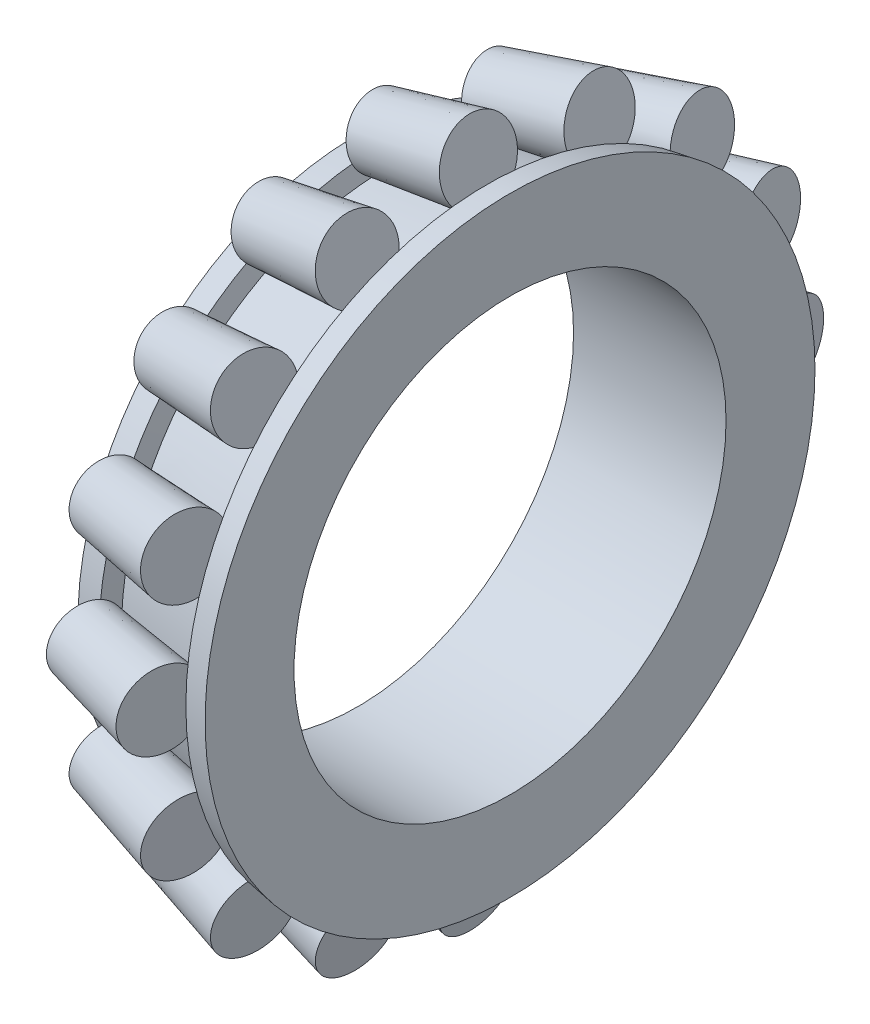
ISO-10303-21;
HEADER;
FILE_DESCRIPTION(('STEP AP214'),'2;1');
FILE_NAME('part.step','',(''),(''),'','','');
FILE_SCHEMA(('AUTOMOTIVE_DESIGN { 1 0 10303 214 1 1 1 1 }'));
ENDSEC;
DATA;
#1=APPLICATION_CONTEXT('core data for automotive mechanical design processes');
#2=APPLICATION_PROTOCOL_DEFINITION('international standard','automotive_design',2000,#1);
#3=PRODUCT_CONTEXT('',#1,'mechanical');
#4=PRODUCT('Part','Part','',(#3));
#5=PRODUCT_RELATED_PRODUCT_CATEGORY('part','',(#4));
#6=PRODUCT_DEFINITION_FORMATION('','',#4);
#7=PRODUCT_DEFINITION_CONTEXT('part definition',#1,'design');
#8=PRODUCT_DEFINITION('design','',#6,#7);
#9=PRODUCT_DEFINITION_SHAPE('','',#8);
#10=(LENGTH_UNIT() NAMED_UNIT(*) SI_UNIT(.MILLI.,.METRE.));
#11=(NAMED_UNIT(*) PLANE_ANGLE_UNIT() SI_UNIT($,.RADIAN.));
#12=(NAMED_UNIT(*) SI_UNIT($,.STERADIAN.) SOLID_ANGLE_UNIT());
#13=UNCERTAINTY_MEASURE_WITH_UNIT(LENGTH_MEASURE(1.E-05),#10,'distance_accuracy_value','');
#14=(GEOMETRIC_REPRESENTATION_CONTEXT(3) GLOBAL_UNCERTAINTY_ASSIGNED_CONTEXT((#13)) GLOBAL_UNIT_ASSIGNED_CONTEXT((#10,
#11,#12)) REPRESENTATION_CONTEXT('',''));
#15=CARTESIAN_POINT('',(0.,0.,0.));
#16=DIRECTION('',(0.,0.,1.));
#17=DIRECTION('',(1.,0.,0.));
#18=AXIS2_PLACEMENT_3D('',#15,#16,#17);
#19=CARTESIAN_POINT('',(-10.0272121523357,0.,0.));
#20=DIRECTION('',(1.,0.,0.));
#21=DIRECTION('',(0.,0.,-1.));
#22=AXIS2_PLACEMENT_3D('',#19,#20,#21);
#23=CONICAL_SURFACE('',#22,22.3287979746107,0.165148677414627);
#24=CARTESIAN_POINT('',(-12.,0.,0.));
#25=DIRECTION('',(1.,0.,0.));
#26=DIRECTION('',(0.,0.,-1.));
#27=AXIS2_PLACEMENT_3D('',#24,#25,#26);
#28=CIRCLE('',#27,22.);
#29=CARTESIAN_POINT('',(-12.,0.,-22.));
#30=VERTEX_POINT('',#29);
#31=EDGE_CURVE('E809',#30,#30,#28,.T.);
#32=ORIENTED_EDGE('',*,*,#31,.T.);
#33=EDGE_LOOP('',(#32));
#34=FACE_BOUND('',#33,.T.);
#35=CARTESIAN_POINT('',(-10.0272121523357,0.,0.));
#36=DIRECTION('',(1.,0.,0.));
#37=DIRECTION('',(0.,0.,-1.));
#38=AXIS2_PLACEMENT_3D('',#35,#36,#37);
#39=CIRCLE('',#38,22.3287979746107);
#40=CARTESIAN_POINT('',(-10.0272121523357,21.3190555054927,-6.63875676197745));
#41=VERTEX_POINT('',#40);
#42=CARTESIAN_POINT('',(-10.0272121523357,22.2367812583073,-2.02503784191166));
#43=VERTEX_POINT('',#42);
#44=EDGE_CURVE('E803',#41,#43,#39,.T.);
#45=ORIENTED_EDGE('',*,*,#44,.F.);
#46=CARTESIAN_POINT('',(-4.68972835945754,-0.825013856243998,0.341731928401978));
#47=DIRECTION('',(0.974392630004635,0.207737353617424,-0.0860476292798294));
#48=DIRECTION('',(0.224853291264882,-0.900221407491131,0.372883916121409));
#49=AXIS2_PLACEMENT_3D('',#46,#47,#48);
#50=ELLIPSE('',#49,23.8285654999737,23.2011998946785);
#51=CARTESIAN_POINT('',(-10.0272121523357,19.7691586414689,-10.3805387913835));
#52=VERTEX_POINT('',#51);
#53=EDGE_CURVE('E483',#41,#52,#50,.F.);
#54=ORIENTED_EDGE('',*,*,#53,.T.);
#55=CARTESIAN_POINT('',(-10.0272121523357,17.1556968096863,-14.2918608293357));
#56=VERTEX_POINT('',#55);
#57=EDGE_CURVE('E1207',#56,#52,#39,.T.);
#58=ORIENTED_EDGE('',*,*,#57,.F.);
#59=CARTESIAN_POINT('',(-4.68972835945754,-0.631438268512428,0.631438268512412));
#60=DIRECTION('',(0.974392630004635,0.158995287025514,-0.15899528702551));
#61=DIRECTION('',(0.224853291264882,-0.688999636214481,0.688999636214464));
#62=AXIS2_PLACEMENT_3D('',#59,#60,#61);
#63=ELLIPSE('',#62,23.8285654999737,23.2011998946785);
#64=CARTESIAN_POINT('',(-10.0272121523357,14.2918608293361,-17.1556968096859));
#65=VERTEX_POINT('',#64);
#66=EDGE_CURVE('E734',#56,#65,#63,.F.);
#67=ORIENTED_EDGE('',*,*,#66,.T.);
#68=CARTESIAN_POINT('',(-10.0272121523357,10.3805387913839,-19.7691586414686));
#69=VERTEX_POINT('',#68);
#70=EDGE_CURVE('E1187',#69,#65,#39,.T.);
#71=ORIENTED_EDGE('',*,*,#70,.F.);
#72=CARTESIAN_POINT('',(-4.68972835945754,-0.341731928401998,0.82501385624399));
#73=DIRECTION('',(0.974392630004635,0.0860476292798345,-0.207737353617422));
#74=DIRECTION('',(0.224853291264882,-0.372883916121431,0.900221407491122));
#75=AXIS2_PLACEMENT_3D('',#72,#73,#74);
#76=ELLIPSE('',#75,23.8285654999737,23.2011998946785);
#77=CARTESIAN_POINT('',(-10.0272121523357,6.63875676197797,-21.3190555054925));
#78=VERTEX_POINT('',#77);
#79=EDGE_CURVE('E1413',#69,#78,#76,.F.);
#80=ORIENTED_EDGE('',*,*,#79,.T.);
#81=CARTESIAN_POINT('',(-10.0272121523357,2.02503784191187,-22.2367812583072));
#82=VERTEX_POINT('',#81);
#83=EDGE_CURVE('E1208',#82,#78,#39,.T.);
#84=ORIENTED_EDGE('',*,*,#83,.F.);
#85=CARTESIAN_POINT('',(-4.68972835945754,0.,0.892988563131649));
#86=DIRECTION('',(0.974392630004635,0.,-0.224853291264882));
#87=DIRECTION('',(0.224853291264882,0.,0.974392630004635));
#88=AXIS2_PLACEMENT_3D('',#85,#86,#87);
#89=ELLIPSE('',#88,23.8285654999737,23.2011998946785);
#90=CARTESIAN_POINT('',(-10.0272121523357,-2.02503784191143,-22.2367812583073));
#91=VERTEX_POINT('',#90);
#92=EDGE_CURVE('E1405',#82,#91,#89,.F.);
#93=ORIENTED_EDGE('',*,*,#92,.T.);
#94=CARTESIAN_POINT('',(-10.0272121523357,-6.63875676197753,-21.3190555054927));
#95=VERTEX_POINT('',#94);
#96=EDGE_CURVE('E1210',#95,#91,#39,.T.);
#97=ORIENTED_EDGE('',*,*,#96,.F.);
#98=CARTESIAN_POINT('',(-4.68972835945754,0.341731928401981,0.825013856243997));
#99=DIRECTION('',(0.974392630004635,-0.0860476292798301,-0.207737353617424));
#100=DIRECTION('',(0.224853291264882,0.372883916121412,0.90022140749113));
#101=AXIS2_PLACEMENT_3D('',#98,#99,#100);
#102=ELLIPSE('',#101,23.8285654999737,23.2011998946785);
#103=CARTESIAN_POINT('',(-10.0272121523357,-10.3805387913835,-19.7691586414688));
#104=VERTEX_POINT('',#103);
#105=EDGE_CURVE('E1393',#95,#104,#102,.F.);
#106=ORIENTED_EDGE('',*,*,#105,.T.);
#107=CARTESIAN_POINT('',(-10.0272121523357,-14.2918608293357,-17.1556968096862));
#108=VERTEX_POINT('',#107);
#109=EDGE_CURVE('E1216',#108,#104,#39,.T.);
#110=ORIENTED_EDGE('',*,*,#109,.F.);
#111=CARTESIAN_POINT('',(-4.68972835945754,0.631438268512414,0.631438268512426));
#112=DIRECTION('',(0.974392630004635,-0.15899528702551,-0.158995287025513));
#113=DIRECTION('',(0.224853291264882,0.688999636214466,0.688999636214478));
#114=AXIS2_PLACEMENT_3D('',#111,#112,#113);
#115=ELLIPSE('',#114,23.8285654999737,23.2011998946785);
#116=CARTESIAN_POINT('',(-10.0272121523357,-17.155696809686,-14.291860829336));
#117=VERTEX_POINT('',#116);
#118=EDGE_CURVE('E1381',#108,#117,#115,.F.);
#119=ORIENTED_EDGE('',*,*,#118,.T.);
#120=CARTESIAN_POINT('',(-10.0272121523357,-19.7691586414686,-10.3805387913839));
#121=VERTEX_POINT('',#120);
#122=EDGE_CURVE('E1222',#121,#117,#39,.T.);
#123=ORIENTED_EDGE('',*,*,#122,.F.);
#124=CARTESIAN_POINT('',(-4.68972835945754,0.82501385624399,0.341731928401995));
#125=DIRECTION('',(0.974392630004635,-0.207737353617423,-0.0860476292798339));
#126=DIRECTION('',(0.224853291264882,0.900221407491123,0.372883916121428));
#127=AXIS2_PLACEMENT_3D('',#124,#125,#126);
#128=ELLIPSE('',#127,23.8285654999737,23.2011998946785);
#129=CARTESIAN_POINT('',(-10.0272121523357,-21.3190555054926,-6.63875676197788));
#130=VERTEX_POINT('',#129);
#131=EDGE_CURVE('E1369',#121,#130,#128,.F.);
#132=ORIENTED_EDGE('',*,*,#131,.T.);
#133=CARTESIAN_POINT('',(-10.0272121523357,-22.2367812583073,-2.0250378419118));
#134=VERTEX_POINT('',#133);
#135=EDGE_CURVE('E1228',#134,#130,#39,.T.);
#136=ORIENTED_EDGE('',*,*,#135,.F.);
#137=CARTESIAN_POINT('',(-4.68972835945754,0.892988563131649,0.));
#138=DIRECTION('',(0.974392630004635,-0.224853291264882,0.));
#139=DIRECTION('',(0.224853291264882,0.974392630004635,0.));
#140=AXIS2_PLACEMENT_3D('',#137,#138,#139);
#141=ELLIPSE('',#140,23.8285654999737,23.2011998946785);
#142=CARTESIAN_POINT('',(-10.0272121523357,-22.2367812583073,2.02503784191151));
#143=VERTEX_POINT('',#142);
#144=EDGE_CURVE('E1357',#134,#143,#141,.F.);
#145=ORIENTED_EDGE('',*,*,#144,.T.);
#146=CARTESIAN_POINT('',(-10.0272121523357,-21.3190555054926,6.63875676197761));
#147=VERTEX_POINT('',#146);
#148=EDGE_CURVE('E1234',#147,#143,#39,.T.);
#149=ORIENTED_EDGE('',*,*,#148,.F.);
#150=CARTESIAN_POINT('',(-4.68972835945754,0.825013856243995,-0.341731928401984));
#151=DIRECTION('',(0.974392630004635,-0.207737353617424,0.086047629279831));
#152=DIRECTION('',(0.224853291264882,0.900221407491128,-0.372883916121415));
#153=AXIS2_PLACEMENT_3D('',#150,#151,#152);
#154=ELLIPSE('',#153,23.8285654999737,23.2011998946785);
#155=CARTESIAN_POINT('',(-10.0272121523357,-19.7691586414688,10.3805387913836));
#156=VERTEX_POINT('',#155);
#157=EDGE_CURVE('E1345',#147,#156,#154,.F.);
#158=ORIENTED_EDGE('',*,*,#157,.T.);
#159=CARTESIAN_POINT('',(-10.0272121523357,-17.1556968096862,14.2918608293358));
#160=VERTEX_POINT('',#159);
#161=EDGE_CURVE('E1240',#160,#156,#39,.T.);
#162=ORIENTED_EDGE('',*,*,#161,.F.);
#163=CARTESIAN_POINT('',(-4.68972835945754,0.631438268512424,-0.631438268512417));
#164=DIRECTION('',(0.974392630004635,-0.158995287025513,0.158995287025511));
#165=DIRECTION('',(0.224853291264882,0.688999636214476,-0.688999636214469));
#166=AXIS2_PLACEMENT_3D('',#163,#164,#165);
#167=ELLIPSE('',#166,23.8285654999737,23.2011998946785);
#168=CARTESIAN_POINT('',(-10.0272121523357,-14.291860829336,17.155696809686));
#169=VERTEX_POINT('',#168);
#170=EDGE_CURVE('E1333',#160,#169,#167,.F.);
#171=ORIENTED_EDGE('',*,*,#170,.T.);
#172=CARTESIAN_POINT('',(-10.0272121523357,-10.3805387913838,19.7691586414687));
#173=VERTEX_POINT('',#172);
#174=EDGE_CURVE('E1246',#173,#169,#39,.T.);
#175=ORIENTED_EDGE('',*,*,#174,.F.);
#176=CARTESIAN_POINT('',(-4.68972835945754,0.341731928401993,-0.825013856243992));
#177=DIRECTION('',(0.974392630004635,-0.0860476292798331,0.207737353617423));
#178=DIRECTION('',(0.224853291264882,0.372883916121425,-0.900221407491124));
#179=AXIS2_PLACEMENT_3D('',#176,#177,#178);
#180=ELLIPSE('',#179,23.8285654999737,23.2011998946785);
#181=CARTESIAN_POINT('',(-10.0272121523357,-6.6387567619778,21.3190555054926));
#182=VERTEX_POINT('',#181);
#183=EDGE_CURVE('E1321',#173,#182,#180,.F.);
#184=ORIENTED_EDGE('',*,*,#183,.T.);
#185=CARTESIAN_POINT('',(-10.0272121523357,-2.02503784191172,22.2367812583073));
#186=VERTEX_POINT('',#185);
#187=EDGE_CURVE('E1252',#186,#182,#39,.T.);
#188=ORIENTED_EDGE('',*,*,#187,.F.);
#189=CARTESIAN_POINT('',(-4.68972835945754,0.,-0.892988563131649));
#190=DIRECTION('',(0.974392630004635,0.,0.224853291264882));
#191=DIRECTION('',(0.224853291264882,0.,-0.974392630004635));
#192=AXIS2_PLACEMENT_3D('',#189,#190,#191);
#193=ELLIPSE('',#192,23.8285654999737,23.2011998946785);
#194=CARTESIAN_POINT('',(-10.0272121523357,2.02503784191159,22.2367812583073));
#195=VERTEX_POINT('',#194);
#196=EDGE_CURVE('E1309',#186,#195,#193,.F.);
#197=ORIENTED_EDGE('',*,*,#196,.T.);
#198=CARTESIAN_POINT('',(-10.0272121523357,6.63875676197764,21.3190555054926));
#199=VERTEX_POINT('',#198);
#200=EDGE_CURVE('E1258',#199,#195,#39,.T.);
#201=ORIENTED_EDGE('',*,*,#200,.F.);
#202=CARTESIAN_POINT('',(-4.68972835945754,-0.341731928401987,-0.825013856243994));
#203=DIRECTION('',(0.974392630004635,0.0860476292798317,0.207737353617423));
#204=DIRECTION('',(0.224853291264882,-0.372883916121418,-0.900221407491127));
#205=AXIS2_PLACEMENT_3D('',#202,#203,#204);
#206=ELLIPSE('',#205,23.8285654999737,23.2011998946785);
#207=CARTESIAN_POINT('',(-10.0272121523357,10.3805387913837,19.7691586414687));
#208=VERTEX_POINT('',#207);
#209=EDGE_CURVE('E1297',#199,#208,#206,.F.);
#210=ORIENTED_EDGE('',*,*,#209,.T.);
#211=CARTESIAN_POINT('',(-10.0272121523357,14.2918608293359,17.1556968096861));
#212=VERTEX_POINT('',#211);
#213=EDGE_CURVE('E1264',#212,#208,#39,.T.);
#214=ORIENTED_EDGE('',*,*,#213,.F.);
#215=CARTESIAN_POINT('',(-4.68972835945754,-0.631438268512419,-0.631438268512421));
#216=DIRECTION('',(0.974392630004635,0.158995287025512,0.158995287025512));
#217=DIRECTION('',(0.224853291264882,-0.688999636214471,-0.688999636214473));
#218=AXIS2_PLACEMENT_3D('',#215,#216,#217);
#219=ELLIPSE('',#218,23.8285654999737,23.2011998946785);
#220=CARTESIAN_POINT('',(-10.0272121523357,17.1556968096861,14.2918608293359));
#221=VERTEX_POINT('',#220);
#222=EDGE_CURVE('E1285',#212,#221,#219,.F.);
#223=ORIENTED_EDGE('',*,*,#222,.T.);
#224=CARTESIAN_POINT('',(-10.0272121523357,19.7691586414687,10.3805387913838));
#225=VERTEX_POINT('',#224);
#226=EDGE_CURVE('E810',#225,#221,#39,.T.);
#227=ORIENTED_EDGE('',*,*,#226,.F.);
#228=CARTESIAN_POINT('',(-4.68972835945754,-0.825013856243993,-0.34173192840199));
#229=DIRECTION('',(0.974392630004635,0.207737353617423,0.0860476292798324));
#230=DIRECTION('',(0.224853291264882,-0.900221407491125,-0.372883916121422));
#231=AXIS2_PLACEMENT_3D('',#228,#229,#230);
#232=ELLIPSE('',#231,23.8285654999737,23.2011998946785);
#233=CARTESIAN_POINT('',(-10.0272121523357,21.3190555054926,6.63875676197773));
#234=VERTEX_POINT('',#233);
#235=EDGE_CURVE('E1284',#225,#234,#232,.F.);
#236=ORIENTED_EDGE('',*,*,#235,.T.);
#237=CARTESIAN_POINT('',(-10.0272121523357,22.2367812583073,2.02503784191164));
#238=VERTEX_POINT('',#237);
#239=EDGE_CURVE('E806',#238,#234,#39,.T.);
#240=ORIENTED_EDGE('',*,*,#239,.F.);
#241=CARTESIAN_POINT('',(-4.68972835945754,-0.892988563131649,0.));
#242=DIRECTION('',(0.974392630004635,0.224853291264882,0.));
#243=DIRECTION('',(0.224853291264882,-0.974392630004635,0.));
#244=AXIS2_PLACEMENT_3D('',#241,#242,#243);
#245=ELLIPSE('',#244,23.8285654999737,23.2011998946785);
#246=EDGE_CURVE('E1204',#238,#43,#245,.F.);
#247=ORIENTED_EDGE('',*,*,#246,.T.);
#248=EDGE_LOOP('',(#45,#54,#58,#67,#71,#80,#84,#93,#97,#106,#110,#119,#123,#132,#136,#145,#149,
#158,#162,#171,#175,#184,#188,#197,#201,#210,#214,#223,#227,#236,#240,#247));
#249=FACE_BOUND('',#248,.T.);
#250=ADVANCED_FACE('F24',(#34,#249),#23,.T.);
#251=CARTESIAN_POINT('',(-9.70664461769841,0.,0.));
#252=DIRECTION('',(-1.,0.,0.));
#253=DIRECTION('',(0.,0.,1.));
#254=AXIS2_PLACEMENT_3D('',#251,#252,#253);
#255=CONICAL_SURFACE('',#254,20.8615352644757,1.35569632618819);
#256=CARTESIAN_POINT('',(-9.70664461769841,0.,0.));
#257=DIRECTION('',(1.,0.,0.));
#258=DIRECTION('',(0.,0.,-1.));
#259=AXIS2_PLACEMENT_3D('',#256,#257,#258);
#260=CIRCLE('',#259,20.8615352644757);
#261=CARTESIAN_POINT('',(-9.70664461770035,19.5522807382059,-7.27406155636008));
#262=VERTEX_POINT('',#261);
#263=CARTESIAN_POINT('',(-9.70664461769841,20.8476148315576,-0.761977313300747));
#264=VERTEX_POINT('',#263);
#265=EDGE_CURVE('E794',#262,#264,#260,.T.);
#266=ORIENTED_EDGE('',*,*,#265,.F.);
#267=CARTESIAN_POINT('',(-9.7064446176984,19.5509630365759,-7.27497799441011));
#268=CARTESIAN_POINT('',(-9.7229137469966,19.6590813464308,-7.20045167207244));
#269=CARTESIAN_POINT('',(-9.74138223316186,19.7725165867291,-7.13572961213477));
#270=CARTESIAN_POINT('',(-9.78099128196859,20.0056472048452,-7.02143044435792));
#271=CARTESIAN_POINT('',(-9.80211586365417,20.1253028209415,-6.97176836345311));
#272=CARTESIAN_POINT('',(-9.86737259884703,20.4865397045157,-6.83862451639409));
#273=CARTESIAN_POINT('',(-9.91378345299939,20.7328091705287,-6.76962815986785));
#274=CARTESIAN_POINT('',(-9.9723716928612,21.0371774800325,-6.69826398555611));
#275=CARTESIAN_POINT('',(-9.98327148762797,21.0935368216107,-6.68562841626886));
#276=CARTESIAN_POINT('',(-10.0052302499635,21.2065889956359,-6.66135461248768));
#277=CARTESIAN_POINT('',(-10.0162895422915,21.2632823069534,-6.64971889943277));
#278=CARTESIAN_POINT('',(-10.0274121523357,21.3200768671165,-6.6385557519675));
#279=B_SPLINE_CURVE_WITH_KNOTS('',3,(#267,#268,#269,#270,#271,#272,#273,#274,#275,#276,#277,
#278),.UNSPECIFIED.,.F.,.F.,(4,2,2,2,2,4),(0.,0.395210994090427,0.788148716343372,
1.56575206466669,1.74209747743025,1.9188752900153),.UNSPECIFIED.);
#280=EDGE_CURVE('E477',#262,#41,#279,.T.);
#281=ORIENTED_EDGE('',*,*,#280,.T.);
#282=ORIENTED_EDGE('',*,*,#44,.T.);
#283=CARTESIAN_POINT('',(-10.0274121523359,22.2376479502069,-2.02561440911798));
#284=CARTESIAN_POINT('',(-10.0025861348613,22.1300654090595,-1.95400769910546));
#285=CARTESIAN_POINT('',(-9.97806298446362,22.0237953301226,-1.88059960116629));
#286=CARTESIAN_POINT('',(-9.92966717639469,21.81407405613,-1.72827152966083));
#287=CARTESIAN_POINT('',(-9.9057996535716,21.7106451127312,-1.64931944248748));
#288=CARTESIAN_POINT('',(-9.83692337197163,21.4121725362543,-1.40687396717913));
#289=CARTESIAN_POINT('',(-9.79333604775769,21.2232886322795,-1.23422643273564));
#290=CARTESIAN_POINT('',(-9.74626066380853,21.0192893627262,-0.996565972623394));
#291=CARTESIAN_POINT('',(-9.7377874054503,20.9825708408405,-0.951319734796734));
#292=CARTESIAN_POINT('',(-9.72153376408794,20.9121363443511,-0.858080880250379));
#293=CARTESIAN_POINT('',(-9.71375703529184,20.87843620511,-0.810075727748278));
#294=CARTESIAN_POINT('',(-9.70644461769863,20.8467481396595,-0.760626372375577));
#295=B_SPLINE_CURVE_WITH_KNOTS('',3,(#283,#284,#285,#286,#287,#288,#289,#290,#291,#292,#293,
#294),.UNSPECIFIED.,.F.,.F.,(4,2,2,2,2,4),(0.,0.394432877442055,0.791376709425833,
1.56484522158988,1.74136428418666,1.91876094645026),.UNSPECIFIED.);
#296=EDGE_CURVE('E495',#43,#264,#295,.T.);
#297=ORIENTED_EDGE('',*,*,#296,.T.);
#298=EDGE_LOOP('',(#266,#281,#282,#297));
#299=FACE_BOUND('',#298,.T.);
#300=ADVANCED_FACE('F485',(#299),#255,.T.);
#301=ORIENTED_EDGE('',*,*,#57,.T.);
#302=CARTESIAN_POINT('',(-10.0274121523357,19.769738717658,-10.3814031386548));
#303=CARTESIAN_POINT('',(-10.0025861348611,19.6977481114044,-10.2740771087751));
#304=CARTESIAN_POINT('',(-9.97806298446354,19.6276594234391,-10.1655890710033));
#305=CARTESIAN_POINT('',(-9.92966717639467,19.4921956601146,-9.94459942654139));
#306=CARTESIAN_POINT('',(-9.90579965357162,19.4268534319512,-9.83207666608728));
#307=CARTESIAN_POINT('',(-9.83692337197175,19.2438805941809,-9.49386574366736));
#308=CARTESIAN_POINT('',(-9.79333604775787,19.1354439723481,-9.26207747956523));
#309=CARTESIAN_POINT('',(-9.74626066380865,19.0379219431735,-8.96444070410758));
#310=CARTESIAN_POINT('',(-9.73778740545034,19.0213134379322,-8.9085870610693));
#311=CARTESIAN_POINT('',(-9.72153376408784,18.9919214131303,-8.79549147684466));
#312=CARTESIAN_POINT('',(-9.71375703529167,18.9791573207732,-8.73824401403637));
#313=CARTESIAN_POINT('',(-9.7064446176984,18.9688048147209,-8.68043226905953));
#314=B_SPLINE_CURVE_WITH_KNOTS('',3,(#302,#303,#304,#305,#306,#307,#308,#309,#310,#311,#312,
#313),.UNSPECIFIED.,.F.,.F.,(4,2,2,2,2,4),(0.,0.394432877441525,0.791376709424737,
1.56484522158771,1.74136428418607,1.91876094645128),.UNSPECIFIED.);
#315=CARTESIAN_POINT('',(-9.70664461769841,18.9690885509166,-8.68201204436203));
#316=VERTEX_POINT('',#315);
#317=EDGE_CURVE('E470',#52,#316,#314,.T.);
#318=ORIENTED_EDGE('',*,*,#317,.T.);
#319=CARTESIAN_POINT('',(-9.70664461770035,15.2802891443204,-14.2026904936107));
#320=VERTEX_POINT('',#319);
#321=EDGE_CURVE('E786',#320,#316,#260,.T.);
#322=ORIENTED_EDGE('',*,*,#321,.F.);
#323=CARTESIAN_POINT('',(-9.70644461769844,15.2787210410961,-14.2030329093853));
#324=CARTESIAN_POINT('',(-9.72291374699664,15.4071293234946,-14.1755546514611));
#325=CARTESIAN_POINT('',(-9.74138223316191,15.5366978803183,-14.1591690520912));
#326=CARTESIAN_POINT('',(-9.78099128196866,15.7958228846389,-14.1427856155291));
#327=CARTESIAN_POINT('',(-9.80211586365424,15.9253751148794,-14.1426940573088));
#328=CARTESIAN_POINT('',(-9.86737259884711,16.3100664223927,-14.1579245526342));
#329=CARTESIAN_POINT('',(-9.91378345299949,16.5639935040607,-14.1884234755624));
#330=CARTESIAN_POINT('',(-9.97237169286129,16.8725030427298,-14.2389682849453));
#331=CARTESIAN_POINT('',(-9.98327148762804,16.9294077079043,-14.2488623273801));
#332=CARTESIAN_POINT('',(-10.0052302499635,17.0431434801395,-14.2696994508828));
#333=CARTESIAN_POINT('',(-10.0162895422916,17.0999740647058,-14.2806450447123));
#334=CARTESIAN_POINT('',(-10.0274121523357,17.1567173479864,-14.2920659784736));
#335=B_SPLINE_CURVE_WITH_KNOTS('',3,(#323,#324,#325,#326,#327,#328,#329,#330,#331,#332,#333,
#334),.UNSPECIFIED.,.F.,.F.,(4,2,2,2,2,4),(0.,0.395210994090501,0.788148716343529,
1.56575206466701,1.74209747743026,1.918875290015),.UNSPECIFIED.);
#336=EDGE_CURVE('E727',#320,#56,#335,.T.);
#337=ORIENTED_EDGE('',*,*,#336,.T.);
#338=EDGE_LOOP('',(#301,#318,#322,#337));
#339=FACE_BOUND('',#338,.T.);
#340=ADVANCED_FACE('F489',(#339),#255,.T.);
#341=CARTESIAN_POINT('',(-1.81549322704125,0.,0.));
#342=DIRECTION('',(1.,0.,0.));
#343=DIRECTION('',(0.,0.,-1.));
#344=AXIS2_PLACEMENT_3D('',#341,#342,#343);
#345=CONICAL_SURFACE('',#344,22.1767271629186,0.165148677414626);
#346=CARTESIAN_POINT('',(-1.81549322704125,0.,0.));
#347=DIRECTION('',(1.,0.,0.));
#348=DIRECTION('',(0.,0.,-1.));
#349=AXIS2_PLACEMENT_3D('',#346,#347,#348);
#350=CIRCLE('',#349,22.1767271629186);
#351=CARTESIAN_POINT('',(-1.81549322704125,0.,-22.1767271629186));
#352=VERTEX_POINT('',#351);
#353=EDGE_CURVE('E798',#352,#352,#350,.T.);
#354=ORIENTED_EDGE('',*,*,#353,.F.);
#355=EDGE_LOOP('',(#354));
#356=FACE_BOUND('',#355,.T.);
#357=CARTESIAN_POINT('',(-1.81529322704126,20.833239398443,-7.60163418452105));
#358=CARTESIAN_POINT('',(-2.75490958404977,20.696110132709,-7.52058081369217));
#359=CARTESIAN_POINT('',(-3.69458271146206,20.5581549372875,-7.44160733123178));
#360=CARTESIAN_POINT('',(-5.57400895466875,20.2808117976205,-7.28732569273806));
#361=CARTESIAN_POINT('',(-6.51376206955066,20.1414238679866,-7.21201749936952));
#362=CARTESIAN_POINT('',(-7.82908659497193,19.94548523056,-7.10883397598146));
#363=CARTESIAN_POINT('',(-8.20463045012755,19.8894456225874,-7.07962705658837));
#364=CARTESIAN_POINT('',(-8.95572953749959,19.7771795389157,-7.021702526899));
#365=CARTESIAN_POINT('',(-9.33128476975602,19.7209530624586,-6.99298491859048));
#366=CARTESIAN_POINT('',(-9.70684461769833,19.6646370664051,-6.96450370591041));
#367=B_SPLINE_CURVE_WITH_KNOTS('',3,(#357,#358,#359,#360,#361,#362,#363,#364,#365,#366),
.UNSPECIFIED.,.F.,.F.,(4,2,2,2,4),(0.,2.85906383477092,5.71809854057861,6.86056932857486,
8.00304475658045),.UNSPECIFIED.);
#368=CARTESIAN_POINT('',(-1.8502363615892,20.8281400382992,-7.59861922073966));
#369=VERTEX_POINT('',#368);
#370=CARTESIAN_POINT('',(-9.70339525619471,19.6651543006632,-6.96476530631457));
#371=VERTEX_POINT('',#370);
#372=EDGE_CURVE('E28',#369,#371,#367,.T.);
#373=ORIENTED_EDGE('',*,*,#372,.T.);
#374=CARTESIAN_POINT('',(-4.70324482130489,-0.77089942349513,0.319316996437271));
#375=DIRECTION('',(0.974392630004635,0.207737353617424,-0.0860476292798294));
#376=DIRECTION('',(0.224853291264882,-0.900221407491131,0.372883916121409));
#377=AXIS2_PLACEMENT_3D('',#374,#375,#376);
#378=ELLIPSE('',#377,22.2655986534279,21.6793833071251);
#379=EDGE_CURVE('E11',#371,#262,#378,.F.);
#380=ORIENTED_EDGE('',*,*,#379,.T.);
#381=ORIENTED_EDGE('',*,*,#265,.T.);
#382=CARTESIAN_POINT('',(-4.70324482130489,-0.834415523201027,0.));
#383=DIRECTION('',(0.974392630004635,0.224853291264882,0.));
#384=DIRECTION('',(0.224853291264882,-0.974392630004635,0.));
#385=AXIS2_PLACEMENT_3D('',#382,#383,#384);
#386=ELLIPSE('',#385,22.2655986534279,21.6793833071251);
#387=CARTESIAN_POINT('',(-9.70339525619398,20.8335338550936,-1.09092463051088));
#388=VERTEX_POINT('',#387);
#389=EDGE_CURVE('E823',#264,#388,#386,.F.);
#390=ORIENTED_EDGE('',*,*,#389,.T.);
#391=CARTESIAN_POINT('',(-9.7068446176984,20.8329558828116,-1.09096838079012));
#392=CARTESIAN_POINT('',(-8.89202408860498,20.9694865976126,-1.08061773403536));
#393=CARTESIAN_POINT('',(-8.07722310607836,21.1060540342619,-1.06911437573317));
#394=CARTESIAN_POINT('',(-6.44768106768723,21.3792537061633,-1.04350764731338));
#395=CARTESIAN_POINT('',(-5.63294001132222,21.5158859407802,-1.02940430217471));
#396=CARTESIAN_POINT('',(-4.31771564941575,21.736505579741,-1.0042999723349));
#397=CARTESIAN_POINT('',(-3.81721207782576,21.8204746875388,-0.994200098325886));
#398=CARTESIAN_POINT('',(-2.81623112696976,21.9884337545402,-0.972798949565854));
#399=CARTESIAN_POINT('',(-2.31575374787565,22.0724237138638,-0.961497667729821));
#400=CARTESIAN_POINT('',(-1.81529322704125,22.1564229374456,-0.94954132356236));
#401=B_SPLINE_CURVE_WITH_KNOTS('',3,(#391,#392,#393,#394,#395,#396,#397,#398,#399,#400),
.UNSPECIFIED.,.F.,.F.,(4,2,2,2,4),(0.,2.47873518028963,4.95744654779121,6.48024192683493,
8.00304628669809),.UNSPECIFIED.);
#402=CARTESIAN_POINT('',(-1.8502363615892,22.1505579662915,-0.950375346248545));
#403=VERTEX_POINT('',#402);
#404=EDGE_CURVE('E816',#388,#403,#401,.T.);
#405=ORIENTED_EDGE('',*,*,#404,.T.);
#406=CARTESIAN_POINT('',(3.46591772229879,-0.88678042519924,0.));
#407=DIRECTION('',(-0.974392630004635,-0.224853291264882,0.));
#408=DIRECTION('',(0.224853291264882,-0.974392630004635,0.));
#409=AXIS2_PLACEMENT_3D('',#406,#407,#408);
#410=ELLIPSE('',#409,23.6629071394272,23.0399030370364);
#411=CARTESIAN_POINT('',(-1.8502363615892,22.1505579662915,0.950375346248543));
#412=VERTEX_POINT('',#411);
#413=EDGE_CURVE('E843',#403,#412,#410,.F.);
#414=ORIENTED_EDGE('',*,*,#413,.T.);
#415=CARTESIAN_POINT('',(-1.81529322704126,22.1564229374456,0.949541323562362));
#416=CARTESIAN_POINT('',(-2.75490958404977,21.9987142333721,0.971947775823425));
#417=CARTESIAN_POINT('',(-3.69458271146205,21.8410384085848,0.992116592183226));
#418=CARTESIAN_POINT('',(-5.57400895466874,21.5257657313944,1.02851961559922));
#419=CARTESIAN_POINT('',(-6.51376206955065,21.368168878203,1.04475386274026));
#420=CARTESIAN_POINT('',(-7.82908659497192,21.1476585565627,1.06510053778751));
#421=CARTESIAN_POINT('',(-8.20463045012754,21.0847077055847,1.07063878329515));
#422=CARTESIAN_POINT('',(-8.95572953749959,20.9588206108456,1.08119170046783));
#423=CARTESIAN_POINT('',(-9.33128476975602,20.8958843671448,1.08620637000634));
#424=CARTESIAN_POINT('',(-9.70684461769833,20.8329558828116,1.09096838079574));
#425=B_SPLINE_CURVE_WITH_KNOTS('',3,(#415,#416,#417,#418,#419,#420,#421,#422,#423,#424),
.UNSPECIFIED.,.F.,.F.,(4,2,2,2,4),(0.,2.85906383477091,5.71809854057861,6.86056932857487,
8.00304475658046),.UNSPECIFIED.);
#426=CARTESIAN_POINT('',(-9.70339525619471,20.8335338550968,1.09092463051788));
#427=VERTEX_POINT('',#426);
#428=EDGE_CURVE('E836',#412,#427,#425,.T.);
#429=ORIENTED_EDGE('',*,*,#428,.T.);
#430=CARTESIAN_POINT('',(-9.70664461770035,20.847614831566,0.761977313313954));
#431=VERTEX_POINT('',#430);
#432=EDGE_CURVE('E842',#427,#431,#386,.F.);
#433=ORIENTED_EDGE('',*,*,#432,.T.);
#434=CARTESIAN_POINT('',(-9.70664461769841,19.552280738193,7.27406155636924));
#435=VERTEX_POINT('',#434);
#436=EDGE_CURVE('E799',#431,#435,#260,.T.);
#437=ORIENTED_EDGE('',*,*,#436,.T.);
#438=CARTESIAN_POINT('',(-4.70324482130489,-0.770899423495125,-0.319316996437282));
#439=DIRECTION('',(0.974392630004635,0.207737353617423,0.0860476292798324));
#440=DIRECTION('',(0.224853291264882,-0.900221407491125,-0.372883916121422));
#441=AXIS2_PLACEMENT_3D('',#438,#439,#440);
#442=ELLIPSE('',#441,22.2655986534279,21.6793833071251);
#443=CARTESIAN_POINT('',(-9.70339525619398,19.6651543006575,6.96476530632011));
#444=VERTEX_POINT('',#443);
#445=EDGE_CURVE('E851',#435,#444,#442,.F.);
#446=ORIENTED_EDGE('',*,*,#445,.T.);
#447=CARTESIAN_POINT('',(-9.7068446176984,19.6646370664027,6.96450370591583));
#448=CARTESIAN_POINT('',(-8.89202408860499,19.7868139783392,7.02631449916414));
#449=CARTESIAN_POINT('',(-8.07722310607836,19.9085836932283,7.08920431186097));
#450=CARTESIAN_POINT('',(-6.44768106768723,20.1511880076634,7.21741083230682));
#451=CARTESIAN_POINT('',(-5.63294001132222,20.2720226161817,7.28272751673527));
#452=CARTESIAN_POINT('',(-4.31771564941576,20.4662415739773,7.39034837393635));
#453=CARTESIAN_POINT('',(-3.81721207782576,20.5399538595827,7.43181302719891));
#454=CARTESIAN_POINT('',(-2.81623112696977,20.686937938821,7.51586026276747));
#455=CARTESIAN_POINT('',(-2.31575374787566,20.7602097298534,7.55844285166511));
#456=CARTESIAN_POINT('',(-1.81529322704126,20.8332393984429,7.60163418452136));
#457=B_SPLINE_CURVE_WITH_KNOTS('',3,(#447,#448,#449,#450,#451,#452,#453,#454,#455,#456),
.UNSPECIFIED.,.F.,.F.,(4,2,2,2,4),(0.,2.47873518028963,4.95744654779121,6.48024192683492,
8.00304628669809),.UNSPECIFIED.);
#458=CARTESIAN_POINT('',(-1.8502363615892,20.8281400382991,7.59861922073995));
#459=VERTEX_POINT('',#458);
#460=EDGE_CURVE('E844',#444,#459,#457,.T.);
#461=ORIENTED_EDGE('',*,*,#460,.T.);
#462=CARTESIAN_POINT('',(3.46591772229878,-0.819278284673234,-0.33935617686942));
#463=DIRECTION('',(-0.974392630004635,-0.207737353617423,-0.0860476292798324));
#464=DIRECTION('',(0.224853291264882,-0.900221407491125,-0.372883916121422));
#465=AXIS2_PLACEMENT_3D('',#462,#463,#464);
#466=ELLIPSE('',#465,23.6629071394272,23.0399030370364);
#467=CARTESIAN_POINT('',(-1.8502363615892,20.1007542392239,9.35468388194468));
#468=VERTEX_POINT('',#467);
#469=EDGE_CURVE('E870',#459,#468,#466,.F.);
#470=ORIENTED_EDGE('',*,*,#469,.T.);
#471=CARTESIAN_POINT('',(-1.81529322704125,20.106491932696,9.35615777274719));
#472=CARTESIAN_POINT('',(-2.75490958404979,19.9522135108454,9.31650612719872));
#473=CARTESIAN_POINT('',(-3.69458271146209,19.7988217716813,9.27479975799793));
#474=CARTESIAN_POINT('',(-5.57400895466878,19.4936169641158,9.18778213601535));
#475=CARTESIAN_POINT('',(-6.51376206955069,19.3418038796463,9.14247091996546));
#476=CARTESIAN_POINT('',(-7.82908659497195,19.130292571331,9.07688314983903));
#477=CARTESIAN_POINT('',(-8.20463045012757,19.0700141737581,9.057909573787));
#478=CARTESIAN_POINT('',(-8.95572953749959,18.9496712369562,9.01948429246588));
#479=CARTESIAN_POINT('',(-9.33128476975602,18.8896066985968,9.00003258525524));
#480=CARTESIAN_POINT('',(-9.70684461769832,18.8296460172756,8.98035042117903));
#481=B_SPLINE_CURVE_WITH_KNOTS('',3,(#471,#472,#473,#474,#475,#476,#477,#478,#479,#480),
.UNSPECIFIED.,.F.,.F.,(4,2,2,2,4),(0.,2.85906383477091,5.7180985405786,6.86056932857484,
8.00304475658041),.UNSPECIFIED.);
#482=CARTESIAN_POINT('',(-9.70339525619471,18.8301967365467,8.98053118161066));
#483=VERTEX_POINT('',#482);
#484=EDGE_CURVE('E863',#468,#483,#481,.T.);
#485=ORIENTED_EDGE('',*,*,#484,.T.);
#486=CARTESIAN_POINT('',(-9.70664461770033,18.9690885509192,8.68201204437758));
#487=VERTEX_POINT('',#486);
#488=EDGE_CURVE('E869',#483,#487,#442,.F.);
#489=ORIENTED_EDGE('',*,*,#488,.T.);
#490=CARTESIAN_POINT('',(-9.70664461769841,15.2802891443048,14.2026904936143));
#491=VERTEX_POINT('',#490);
#492=EDGE_CURVE('E804',#487,#491,#260,.T.);
#493=ORIENTED_EDGE('',*,*,#492,.T.);
#494=CARTESIAN_POINT('',(-4.70324482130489,-0.590020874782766,-0.590020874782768));
#495=DIRECTION('',(0.974392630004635,0.158995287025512,0.158995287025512));
#496=DIRECTION('',(0.224853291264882,-0.688999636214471,-0.688999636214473));
#497=AXIS2_PLACEMENT_3D('',#494,#495,#496);
#498=ELLIPSE('',#497,22.2655986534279,21.6793833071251);
#499=CARTESIAN_POINT('',(-9.70339525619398,15.5029332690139,13.9601328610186));
#500=VERTEX_POINT('',#499);
#501=EDGE_CURVE('E878',#491,#500,#498,.F.);
#502=ORIENTED_EDGE('',*,*,#501,.T.);
#503=CARTESIAN_POINT('',(-9.7068446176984,15.502555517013,13.9596932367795));
#504=CARTESIAN_POINT('',(-8.89202408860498,15.5917782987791,14.0635540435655));
#505=CARTESIAN_POINT('',(-8.07722310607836,15.6802119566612,14.1682559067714));
#506=CARTESIAN_POINT('',(-6.44768106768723,15.855286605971,14.3795439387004));
#507=CARTESIAN_POINT('',(-5.63294001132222,15.9419276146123,14.4861300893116));
#508=CARTESIAN_POINT('',(-4.31771564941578,16.0801778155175,14.6598831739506));
#509=CARTESIAN_POINT('',(-3.81721207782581,16.1324112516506,14.7263999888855));
#510=CARTESIAN_POINT('',(-2.81623112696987,16.2360433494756,14.8602978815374));
#511=CARTESIAN_POINT('',(-2.31575374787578,16.2874420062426,14.9276789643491));
#512=CARTESIAN_POINT('',(-1.81529322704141,16.3383840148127,14.9955297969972));
#513=B_SPLINE_CURVE_WITH_KNOTS('',3,(#503,#504,#505,#506,#507,#508,#509,#510,#511,#512),
.UNSPECIFIED.,.F.,.F.,(4,2,2,2,4),(0.,2.47873518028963,4.95744654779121,6.48024192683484,
8.00304628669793),.UNSPECIFIED.);
#514=CARTESIAN_POINT('',(-1.8502363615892,16.3348265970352,14.9907928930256));
#515=VERTEX_POINT('',#514);
#516=EDGE_CURVE('E871',#500,#515,#513,.T.);
#517=ORIENTED_EDGE('',*,*,#516,.T.);
#518=CARTESIAN_POINT('',(3.46591772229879,-0.627048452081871,-0.627048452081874));
#519=DIRECTION('',(-0.974392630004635,-0.158995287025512,-0.158995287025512));
#520=DIRECTION('',(0.224853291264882,-0.688999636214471,-0.688999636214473));
#521=AXIS2_PLACEMENT_3D('',#518,#519,#520);
#522=ELLIPSE('',#521,23.6629071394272,23.0399030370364);
#523=CARTESIAN_POINT('',(-1.8502363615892,14.9907928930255,16.3348265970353));
#524=VERTEX_POINT('',#523);
#525=EDGE_CURVE('E897',#515,#524,#522,.F.);
#526=ORIENTED_EDGE('',*,*,#525,.T.);
#527=CARTESIAN_POINT('',(-1.81529322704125,14.9955297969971,16.3383840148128));
#528=CARTESIAN_POINT('',(-2.75490958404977,14.8681691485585,16.2427108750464));
#529=CARTESIAN_POINT('',(-3.69458271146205,14.7424139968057,16.1454787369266));
#530=CARTESIAN_POINT('',(-5.57400895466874,14.4937417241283,15.9482881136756));
#531=CARTESIAN_POINT('',(-6.51376206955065,14.3708245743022,15.8483296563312));
#532=CARTESIAN_POINT('',(-7.82908659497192,14.2005129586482,15.7067925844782));
#533=CARTESIAN_POINT('',(-8.20463045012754,14.1520838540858,15.6661957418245));
#534=CARTESIAN_POINT('',(-8.95572953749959,14.0556061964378,15.5846421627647));
#535=CARTESIAN_POINT('',(-9.33128476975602,14.0075576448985,15.5436854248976));
#536=CARTESIAN_POINT('',(-9.70684461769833,13.9596932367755,15.5025555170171));
#537=B_SPLINE_CURVE_WITH_KNOTS('',3,(#527,#528,#529,#530,#531,#532,#533,#534,#535,#536),
.UNSPECIFIED.,.F.,.F.,(4,2,2,2,4),(0.,2.85906383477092,5.71809854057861,6.86056932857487,
8.00304475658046),.UNSPECIFIED.);
#538=CARTESIAN_POINT('',(-9.70339525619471,13.9601328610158,15.5029332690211));
#539=VERTEX_POINT('',#538);
#540=EDGE_CURVE('E890',#524,#539,#537,.T.);
#541=ORIENTED_EDGE('',*,*,#540,.T.);
#542=CARTESIAN_POINT('',(-9.70664461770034,14.2026904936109,15.2802891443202));
#543=VERTEX_POINT('',#542);
#544=EDGE_CURVE('E896',#539,#543,#498,.F.);
#545=ORIENTED_EDGE('',*,*,#544,.T.);
#546=CARTESIAN_POINT('',(-9.70664461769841,8.68201204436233,18.9690885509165));
#547=VERTEX_POINT('',#546);
#548=EDGE_CURVE('E1790',#543,#547,#260,.T.);
#549=ORIENTED_EDGE('',*,*,#548,.T.);
#550=CARTESIAN_POINT('',(-4.70324482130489,-0.319316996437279,-0.770899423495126));
#551=DIRECTION('',(0.974392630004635,0.0860476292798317,0.207737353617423));
#552=DIRECTION('',(0.224853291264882,-0.372883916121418,-0.900221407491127));
#553=AXIS2_PLACEMENT_3D('',#550,#551,#552);
#554=ELLIPSE('',#553,22.2655986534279,21.6793833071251);
#555=CARTESIAN_POINT('',(-9.70339525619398,8.98053118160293,18.8301967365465));
#556=VERTEX_POINT('',#555);
#557=EDGE_CURVE('E905',#547,#556,#554,.F.);
#558=ORIENTED_EDGE('',*,*,#557,.T.);
#559=CARTESIAN_POINT('',(-9.7068446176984,8.98035042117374,18.8296460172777));
#560=CARTESIAN_POINT('',(-8.89202408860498,9.02303571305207,18.9597449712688));
#561=CARTESIAN_POINT('',(-8.07722310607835,9.06467009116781,19.0903189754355));
#562=CARTESIAN_POINT('',(-6.44768106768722,9.14556154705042,19.3525218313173));
#563=CARTESIAN_POINT('',(-5.63294001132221,9.18481864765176,19.4841506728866));
#564=CARTESIAN_POINT('',(-4.31771564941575,9.24605275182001,19.6975836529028));
#565=CARTESIAN_POINT('',(-3.81721207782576,9.26885527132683,19.7790260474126));
#566=CARTESIAN_POINT('',(-2.81623112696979,9.31335834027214,19.942389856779));
#567=CARTESIAN_POINT('',(-2.31575374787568,9.33505888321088,20.0243112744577));
#568=CARTESIAN_POINT('',(-1.8152932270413,9.35615777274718,20.1064919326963));
#569=B_SPLINE_CURVE_WITH_KNOTS('',3,(#559,#560,#561,#562,#563,#564,#565,#566,#567,#568),
.UNSPECIFIED.,.F.,.F.,(4,2,2,2,4),(0.,2.47873518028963,4.95744654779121,6.4802419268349,
8.00304628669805),.UNSPECIFIED.);
#570=CARTESIAN_POINT('',(-1.8502363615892,9.3546838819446,20.100754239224));
#571=VERTEX_POINT('',#570);
#572=EDGE_CURVE('E898',#556,#571,#569,.T.);
#573=ORIENTED_EDGE('',*,*,#572,.T.);
#574=CARTESIAN_POINT('',(3.46591772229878,-0.339356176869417,-0.819278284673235));
#575=DIRECTION('',(-0.974392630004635,-0.0860476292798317,-0.207737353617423));
#576=DIRECTION('',(0.224853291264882,-0.372883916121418,-0.900221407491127));
#577=AXIS2_PLACEMENT_3D('',#574,#575,#576);
#578=ELLIPSE('',#577,23.6629071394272,23.0399030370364);
#579=CARTESIAN_POINT('',(-1.8502363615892,7.59861922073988,20.8281400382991));
#580=VERTEX_POINT('',#579);
#581=EDGE_CURVE('E924',#571,#580,#578,.F.);
#582=ORIENTED_EDGE('',*,*,#581,.T.);
#583=CARTESIAN_POINT('',(-1.81529322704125,7.60163418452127,20.8332393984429));
#584=CARTESIAN_POINT('',(-2.75490958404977,7.5205808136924,20.6961101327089));
#585=CARTESIAN_POINT('',(-3.69458271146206,7.44160733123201,20.5581549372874));
#586=CARTESIAN_POINT('',(-5.57400895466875,7.28732569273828,20.2808117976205));
#587=CARTESIAN_POINT('',(-6.51376206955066,7.21201749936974,20.1414238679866));
#588=CARTESIAN_POINT('',(-7.82908659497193,7.10883397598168,19.9454852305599));
#589=CARTESIAN_POINT('',(-8.20463045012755,7.07962705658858,19.8894456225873));
#590=CARTESIAN_POINT('',(-8.95572953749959,7.02170252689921,19.7771795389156));
#591=CARTESIAN_POINT('',(-9.33128476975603,6.99298491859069,19.7209530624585));
#592=CARTESIAN_POINT('',(-9.70684461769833,6.96450370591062,19.664637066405));
#593=B_SPLINE_CURVE_WITH_KNOTS('',3,(#583,#584,#585,#586,#587,#588,#589,#590,#591,#592),
.UNSPECIFIED.,.F.,.F.,(4,2,2,2,4),(0.,2.85906383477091,5.71809854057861,6.86056932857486,
8.00304475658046),.UNSPECIFIED.);
#594=CARTESIAN_POINT('',(-9.70339525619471,6.96476530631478,19.6651543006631));
#595=VERTEX_POINT('',#594);
#596=EDGE_CURVE('E917',#580,#595,#593,.T.);
#597=ORIENTED_EDGE('',*,*,#596,.T.);
#598=CARTESIAN_POINT('',(-9.70664461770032,7.27406155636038,19.5522807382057));
#599=VERTEX_POINT('',#598);
#600=EDGE_CURVE('E923',#595,#599,#554,.F.);
#601=ORIENTED_EDGE('',*,*,#600,.T.);
#602=CARTESIAN_POINT('',(-9.70664461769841,0.761977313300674,20.8476148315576));
#603=VERTEX_POINT('',#602);
#604=EDGE_CURVE('E1791',#599,#603,#260,.T.);
#605=ORIENTED_EDGE('',*,*,#604,.T.);
#606=CARTESIAN_POINT('',(-4.70324482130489,0.,-0.834415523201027));
#607=DIRECTION('',(0.974392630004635,0.,0.224853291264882));
#608=DIRECTION('',(0.224853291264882,0.,-0.974392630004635));
#609=AXIS2_PLACEMENT_3D('',#606,#607,#608);
#610=ELLIPSE('',#609,22.2655986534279,21.6793833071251);
#611=CARTESIAN_POINT('',(-9.70339525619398,1.09092463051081,20.8335338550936));
#612=VERTEX_POINT('',#611);
#613=EDGE_CURVE('E932',#603,#612,#610,.F.);
#614=ORIENTED_EDGE('',*,*,#613,.T.);
#615=CARTESIAN_POINT('',(-9.7068446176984,1.09096838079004,20.8329558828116));
#616=CARTESIAN_POINT('',(-8.89202408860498,1.08061773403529,20.9694865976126));
#617=CARTESIAN_POINT('',(-8.07722310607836,1.0691143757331,21.1060540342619));
#618=CARTESIAN_POINT('',(-6.44768106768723,1.0435076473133,21.3792537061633));
#619=CARTESIAN_POINT('',(-5.63294001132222,1.02940430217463,21.5158859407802));
#620=CARTESIAN_POINT('',(-4.31771564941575,1.00429997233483,21.736505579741));
#621=CARTESIAN_POINT('',(-3.81721207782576,0.99420009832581,21.8204746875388));
#622=CARTESIAN_POINT('',(-2.81623112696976,0.972798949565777,21.9884337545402));
#623=CARTESIAN_POINT('',(-2.31575374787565,0.961497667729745,22.0724237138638));
#624=CARTESIAN_POINT('',(-1.81529322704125,0.949541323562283,22.1564229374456));
#625=B_SPLINE_CURVE_WITH_KNOTS('',3,(#615,#616,#617,#618,#619,#620,#621,#622,#623,#624),
.UNSPECIFIED.,.F.,.F.,(4,2,2,2,4),(0.,2.47873518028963,4.95744654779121,6.48024192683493,
8.00304628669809),.UNSPECIFIED.);
#626=CARTESIAN_POINT('',(-1.8502363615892,0.950375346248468,22.1505579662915));
#627=VERTEX_POINT('',#626);
#628=EDGE_CURVE('E925',#612,#627,#625,.T.);
#629=ORIENTED_EDGE('',*,*,#628,.T.);
#630=CARTESIAN_POINT('',(3.46591772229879,0.,-0.88678042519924));
#631=DIRECTION('',(-0.974392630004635,0.,-0.224853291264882));
#632=DIRECTION('',(0.224853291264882,0.,-0.974392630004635));
#633=AXIS2_PLACEMENT_3D('',#630,#631,#632);
#634=ELLIPSE('',#633,23.6629071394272,23.0399030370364);
#635=CARTESIAN_POINT('',(-1.8502363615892,-0.950375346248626,22.1505579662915));
#636=VERTEX_POINT('',#635);
#637=EDGE_CURVE('E951',#627,#636,#634,.F.);
#638=ORIENTED_EDGE('',*,*,#637,.T.);
#639=CARTESIAN_POINT('',(-1.81529322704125,-0.949541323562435,22.1564229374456));
#640=CARTESIAN_POINT('',(-2.75490958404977,-0.971947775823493,21.9987142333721));
#641=CARTESIAN_POINT('',(-3.69458271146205,-0.992116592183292,21.8410384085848));
#642=CARTESIAN_POINT('',(-5.57400895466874,-1.02851961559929,21.5257657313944));
#643=CARTESIAN_POINT('',(-6.51376206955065,-1.04475386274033,21.368168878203));
#644=CARTESIAN_POINT('',(-7.82908659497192,-1.06510053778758,21.1476585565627));
#645=CARTESIAN_POINT('',(-8.20463045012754,-1.07063878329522,21.0847077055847));
#646=CARTESIAN_POINT('',(-8.95572953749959,-1.0811917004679,20.9588206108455));
#647=CARTESIAN_POINT('',(-9.33128476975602,-1.08620637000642,20.8958843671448));
#648=CARTESIAN_POINT('',(-9.70684461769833,-1.09096838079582,20.8329558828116));
#649=B_SPLINE_CURVE_WITH_KNOTS('',3,(#639,#640,#641,#642,#643,#644,#645,#646,#647,#648),
.UNSPECIFIED.,.F.,.F.,(4,2,2,2,4),(0.,2.85906383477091,5.71809854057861,6.86056932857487,
8.00304475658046),.UNSPECIFIED.);
#650=CARTESIAN_POINT('',(-9.70339525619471,-1.09092463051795,20.8335338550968));
#651=VERTEX_POINT('',#650);
#652=EDGE_CURVE('E944',#636,#651,#649,.T.);
#653=ORIENTED_EDGE('',*,*,#652,.T.);
#654=CARTESIAN_POINT('',(-9.70664461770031,-0.761977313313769,20.8476148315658));
#655=VERTEX_POINT('',#654);
#656=EDGE_CURVE('E950',#651,#655,#610,.F.);
#657=ORIENTED_EDGE('',*,*,#656,.T.);
#658=CARTESIAN_POINT('',(-9.70664461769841,-7.27406155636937,19.552280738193));
#659=VERTEX_POINT('',#658);
#660=EDGE_CURVE('E1794',#655,#659,#260,.T.);
#661=ORIENTED_EDGE('',*,*,#660,.T.);
#662=CARTESIAN_POINT('',(-4.70324482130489,0.319316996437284,-0.770899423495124));
#663=DIRECTION('',(0.974392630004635,-0.0860476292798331,0.207737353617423));
#664=DIRECTION('',(0.224853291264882,0.372883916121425,-0.900221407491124));
#665=AXIS2_PLACEMENT_3D('',#662,#663,#664);
#666=ELLIPSE('',#665,22.2655986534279,21.6793833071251);
#667=CARTESIAN_POINT('',(-9.70339525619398,-6.96476530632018,19.6651543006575));
#668=VERTEX_POINT('',#667);
#669=EDGE_CURVE('E959',#659,#668,#666,.F.);
#670=ORIENTED_EDGE('',*,*,#669,.T.);
#671=CARTESIAN_POINT('',(-9.7068446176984,-6.96450370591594,19.6646370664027));
#672=CARTESIAN_POINT('',(-8.89202408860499,-7.02631449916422,19.7868139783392));
#673=CARTESIAN_POINT('',(-8.07722310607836,-7.08920431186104,19.9085836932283));
#674=CARTESIAN_POINT('',(-6.44768106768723,-7.21741083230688,20.1511880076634));
#675=CARTESIAN_POINT('',(-5.63294001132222,-7.28272751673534,20.2720226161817));
#676=CARTESIAN_POINT('',(-4.31771564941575,-7.39034837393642,20.4662415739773));
#677=CARTESIAN_POINT('',(-3.81721207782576,-7.43181302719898,20.5399538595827));
#678=CARTESIAN_POINT('',(-2.81623112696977,-7.51586026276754,20.6869379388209));
#679=CARTESIAN_POINT('',(-2.31575374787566,-7.55844285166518,20.7602097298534));
#680=CARTESIAN_POINT('',(-1.81529322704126,-7.60163418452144,20.8332393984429));
#681=B_SPLINE_CURVE_WITH_KNOTS('',3,(#671,#672,#673,#674,#675,#676,#677,#678,#679,#680),
.UNSPECIFIED.,.F.,.F.,(4,2,2,2,4),(0.,2.47873518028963,4.95744654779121,6.48024192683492,
8.00304628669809),.UNSPECIFIED.);
#682=CARTESIAN_POINT('',(-1.8502363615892,-7.59861922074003,20.828140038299));
#683=VERTEX_POINT('',#682);
#684=EDGE_CURVE('E952',#668,#683,#681,.T.);
#685=ORIENTED_EDGE('',*,*,#684,.T.);
#686=CARTESIAN_POINT('',(3.46591772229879,0.339356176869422,-0.819278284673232));
#687=DIRECTION('',(-0.974392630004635,0.0860476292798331,-0.207737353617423));
#688=DIRECTION('',(0.224853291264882,0.372883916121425,-0.900221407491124));
#689=AXIS2_PLACEMENT_3D('',#686,#687,#688);
#690=ELLIPSE('',#689,23.6629071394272,23.0399030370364);
#691=CARTESIAN_POINT('',(-1.8502363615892,-9.35468388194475,20.1007542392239));
#692=VERTEX_POINT('',#691);
#693=EDGE_CURVE('E978',#683,#692,#690,.F.);
#694=ORIENTED_EDGE('',*,*,#693,.T.);
#695=CARTESIAN_POINT('',(-1.81529322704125,-9.35615777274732,20.1064919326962));
#696=CARTESIAN_POINT('',(-2.75490958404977,-9.3165061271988,19.9522135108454));
#697=CARTESIAN_POINT('',(-3.69458271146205,-9.274799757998,19.7988217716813));
#698=CARTESIAN_POINT('',(-5.57400895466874,-9.1877821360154,19.4936169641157));
#699=CARTESIAN_POINT('',(-6.51376206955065,-9.14247091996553,19.3418038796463));
#700=CARTESIAN_POINT('',(-7.82908659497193,-9.0768831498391,19.130292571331));
#701=CARTESIAN_POINT('',(-8.20463045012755,-9.05790957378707,19.0700141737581));
#702=CARTESIAN_POINT('',(-8.95572953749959,-9.01948429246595,18.9496712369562));
#703=CARTESIAN_POINT('',(-9.33128476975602,-9.00003258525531,18.8896066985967));
#704=CARTESIAN_POINT('',(-9.70684461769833,-8.98035042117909,18.8296460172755));
#705=B_SPLINE_CURVE_WITH_KNOTS('',3,(#695,#696,#697,#698,#699,#700,#701,#702,#703,#704),
.UNSPECIFIED.,.F.,.F.,(4,2,2,2,4),(0.,2.85906383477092,5.71809854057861,6.86056932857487,
8.00304475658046),.UNSPECIFIED.);
#706=CARTESIAN_POINT('',(-9.70339525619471,-8.98053118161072,18.8301967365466));
#707=VERTEX_POINT('',#706);
#708=EDGE_CURVE('E971',#692,#707,#705,.T.);
#709=ORIENTED_EDGE('',*,*,#708,.T.);
#710=CARTESIAN_POINT('',(-9.70664461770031,-8.68201204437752,18.9690885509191));
#711=VERTEX_POINT('',#710);
#712=EDGE_CURVE('E977',#707,#711,#666,.F.);
#713=ORIENTED_EDGE('',*,*,#712,.T.);
#714=CARTESIAN_POINT('',(-9.70664461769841,-14.2026904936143,15.2802891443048));
#715=VERTEX_POINT('',#714);
#716=EDGE_CURVE('E1797',#711,#715,#260,.T.);
#717=ORIENTED_EDGE('',*,*,#716,.T.);
#718=CARTESIAN_POINT('',(-4.70324482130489,0.59002087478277,-0.590020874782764));
#719=DIRECTION('',(0.974392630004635,-0.158995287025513,0.158995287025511));
#720=DIRECTION('',(0.224853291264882,0.688999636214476,-0.688999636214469));
#721=AXIS2_PLACEMENT_3D('',#718,#719,#720);
#722=ELLIPSE('',#721,22.2655986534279,21.6793833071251);
#723=CARTESIAN_POINT('',(-9.70339525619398,-13.9601328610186,15.5029332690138));
#724=VERTEX_POINT('',#723);
#725=EDGE_CURVE('E986',#715,#724,#722,.F.);
#726=ORIENTED_EDGE('',*,*,#725,.T.);
#727=CARTESIAN_POINT('',(-9.7068446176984,-13.9596932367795,15.502555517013));
#728=CARTESIAN_POINT('',(-8.89202408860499,-14.0635540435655,15.5917782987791));
#729=CARTESIAN_POINT('',(-8.07722310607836,-14.1682559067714,15.6802119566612));
#730=CARTESIAN_POINT('',(-6.44768106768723,-14.3795439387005,15.8552866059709));
#731=CARTESIAN_POINT('',(-5.63294001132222,-14.4861300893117,15.9419276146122));
#732=CARTESIAN_POINT('',(-4.31771564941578,-14.6598831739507,16.0801778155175));
#733=CARTESIAN_POINT('',(-3.81721207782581,-14.7263999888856,16.1324112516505));
#734=CARTESIAN_POINT('',(-2.81623112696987,-14.8602978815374,16.2360433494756));
#735=CARTESIAN_POINT('',(-2.31575374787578,-14.9276789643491,16.2874420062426));
#736=CARTESIAN_POINT('',(-1.81529322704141,-14.9955297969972,16.3383840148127));
#737=B_SPLINE_CURVE_WITH_KNOTS('',3,(#727,#728,#729,#730,#731,#732,#733,#734,#735,#736),
.UNSPECIFIED.,.F.,.F.,(4,2,2,2,4),(0.,2.47873518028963,4.95744654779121,6.48024192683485,
8.00304628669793),.UNSPECIFIED.);
#738=CARTESIAN_POINT('',(-1.8502363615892,-14.9907928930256,16.3348265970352));
#739=VERTEX_POINT('',#738);
#740=EDGE_CURVE('E979',#724,#739,#737,.T.);
#741=ORIENTED_EDGE('',*,*,#740,.T.);
#742=CARTESIAN_POINT('',(3.46591772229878,0.627048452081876,-0.627048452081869));
#743=DIRECTION('',(-0.974392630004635,0.158995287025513,-0.158995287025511));
#744=DIRECTION('',(0.224853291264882,0.688999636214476,-0.688999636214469));
#745=AXIS2_PLACEMENT_3D('',#742,#743,#744);
#746=ELLIPSE('',#745,23.6629071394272,23.0399030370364);
#747=CARTESIAN_POINT('',(-1.8502363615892,-16.3348265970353,14.9907928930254));
#748=VERTEX_POINT('',#747);
#749=EDGE_CURVE('E1005',#739,#748,#746,.F.);
#750=ORIENTED_EDGE('',*,*,#749,.T.);
#751=CARTESIAN_POINT('',(-1.81529322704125,-16.3383840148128,14.9955297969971));
#752=CARTESIAN_POINT('',(-2.75490958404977,-16.2427108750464,14.8681691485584));
#753=CARTESIAN_POINT('',(-3.69458271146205,-16.1454787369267,14.7424139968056));
#754=CARTESIAN_POINT('',(-5.57400895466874,-15.9482881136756,14.4937417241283));
#755=CARTESIAN_POINT('',(-6.51376206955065,-15.8483296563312,14.3708245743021));
#756=CARTESIAN_POINT('',(-7.82908659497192,-15.7067925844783,14.2005129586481));
#757=CARTESIAN_POINT('',(-8.20463045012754,-15.6661957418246,14.1520838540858));
#758=CARTESIAN_POINT('',(-8.95572953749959,-15.5846421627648,14.0556061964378));
#759=CARTESIAN_POINT('',(-9.33128476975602,-15.5436854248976,14.0075576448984));
#760=CARTESIAN_POINT('',(-9.70684461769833,-15.5025555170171,13.9596932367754));
#761=B_SPLINE_CURVE_WITH_KNOTS('',3,(#751,#752,#753,#754,#755,#756,#757,#758,#759,#760),
.UNSPECIFIED.,.F.,.F.,(4,2,2,2,4),(0.,2.85906383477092,5.71809854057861,6.86056932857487,
8.00304475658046),.UNSPECIFIED.);
#762=CARTESIAN_POINT('',(-9.70339525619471,-15.5029332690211,13.9601328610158));
#763=VERTEX_POINT('',#762);
#764=EDGE_CURVE('E998',#748,#763,#761,.T.);
#765=ORIENTED_EDGE('',*,*,#764,.T.);
#766=CARTESIAN_POINT('',(-9.70664461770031,-15.2802891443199,14.2026904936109));
#767=VERTEX_POINT('',#766);
#768=EDGE_CURVE('E1004',#763,#767,#722,.F.);
#769=ORIENTED_EDGE('',*,*,#768,.T.);
#770=CARTESIAN_POINT('',(-9.70664461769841,-18.9690885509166,8.68201204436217));
#771=VERTEX_POINT('',#770);
#772=EDGE_CURVE('E1800',#767,#771,#260,.T.);
#773=ORIENTED_EDGE('',*,*,#772,.T.);
#774=CARTESIAN_POINT('',(-4.70324482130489,0.770899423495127,-0.319316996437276));
#775=DIRECTION('',(0.974392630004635,-0.207737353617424,0.086047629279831));
#776=DIRECTION('',(0.224853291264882,0.900221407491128,-0.372883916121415));
#777=AXIS2_PLACEMENT_3D('',#774,#775,#776);
#778=ELLIPSE('',#777,22.2655986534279,21.6793833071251);
#779=CARTESIAN_POINT('',(-9.70339525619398,-18.8301967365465,8.98053118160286));
#780=VERTEX_POINT('',#779);
#781=EDGE_CURVE('E1013',#771,#780,#778,.F.);
#782=ORIENTED_EDGE('',*,*,#781,.T.);
#783=CARTESIAN_POINT('',(-9.7068446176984,-18.8296460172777,8.98035042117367));
#784=CARTESIAN_POINT('',(-8.89202408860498,-18.9597449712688,9.02303571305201));
#785=CARTESIAN_POINT('',(-8.07722310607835,-19.0903189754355,9.06467009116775));
#786=CARTESIAN_POINT('',(-6.44768106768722,-19.3525218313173,9.14556154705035));
#787=CARTESIAN_POINT('',(-5.63294001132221,-19.4841506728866,9.18481864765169));
#788=CARTESIAN_POINT('',(-4.31771564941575,-19.6975836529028,9.24605275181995));
#789=CARTESIAN_POINT('',(-3.81721207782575,-19.7790260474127,9.26885527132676));
#790=CARTESIAN_POINT('',(-2.81623112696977,-19.942389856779,9.31335834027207));
#791=CARTESIAN_POINT('',(-2.31575374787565,-20.0243112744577,9.33505888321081));
#792=CARTESIAN_POINT('',(-1.81529322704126,-20.1064919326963,9.35615777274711));
#793=B_SPLINE_CURVE_WITH_KNOTS('',3,(#783,#784,#785,#786,#787,#788,#789,#790,#791,#792),
.UNSPECIFIED.,.F.,.F.,(4,2,2,2,4),(0.,2.47873518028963,4.95744654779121,6.48024192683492,
8.00304628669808),.UNSPECIFIED.);
#794=CARTESIAN_POINT('',(-1.8502363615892,-20.100754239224,9.35468388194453));
#795=VERTEX_POINT('',#794);
#796=EDGE_CURVE('E1006',#780,#795,#793,.T.);
#797=ORIENTED_EDGE('',*,*,#796,.T.);
#798=CARTESIAN_POINT('',(3.46591772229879,0.819278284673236,-0.339356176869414));
#799=DIRECTION('',(-0.974392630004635,0.207737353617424,-0.086047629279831));
#800=DIRECTION('',(0.224853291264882,0.900221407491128,-0.372883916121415));
#801=AXIS2_PLACEMENT_3D('',#798,#799,#800);
#802=ELLIPSE('',#801,23.6629071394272,23.0399030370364);
#803=CARTESIAN_POINT('',(-1.8502363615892,-20.8281400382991,7.59861922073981));
#804=VERTEX_POINT('',#803);
#805=EDGE_CURVE('E1032',#795,#804,#802,.F.);
#806=ORIENTED_EDGE('',*,*,#805,.T.);
#807=CARTESIAN_POINT('',(-1.81529322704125,-20.833239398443,7.60163418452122));
#808=CARTESIAN_POINT('',(-2.75490958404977,-20.696110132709,7.52058081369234));
#809=CARTESIAN_POINT('',(-3.69458271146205,-20.5581549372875,7.44160733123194));
#810=CARTESIAN_POINT('',(-5.57400895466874,-20.2808117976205,7.28732569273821));
#811=CARTESIAN_POINT('',(-6.51376206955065,-20.1414238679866,7.21201749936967));
#812=CARTESIAN_POINT('',(-7.82908659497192,-19.9454852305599,7.10883397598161));
#813=CARTESIAN_POINT('',(-8.20463045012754,-19.8894456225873,7.07962705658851));
#814=CARTESIAN_POINT('',(-8.95572953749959,-19.7771795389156,7.02170252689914));
#815=CARTESIAN_POINT('',(-9.33128476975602,-19.7209530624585,6.99298491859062));
#816=CARTESIAN_POINT('',(-9.70684461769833,-19.664637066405,6.96450370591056));
#817=B_SPLINE_CURVE_WITH_KNOTS('',3,(#807,#808,#809,#810,#811,#812,#813,#814,#815,#816),
.UNSPECIFIED.,.F.,.F.,(4,2,2,2,4),(0.,2.85906383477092,5.71809854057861,6.86056932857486,
8.00304475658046),.UNSPECIFIED.);
#818=CARTESIAN_POINT('',(-9.70339525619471,-19.6651543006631,6.96476530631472));
#819=VERTEX_POINT('',#818);
#820=EDGE_CURVE('E1025',#804,#819,#817,.T.);
#821=ORIENTED_EDGE('',*,*,#820,.T.);
#822=CARTESIAN_POINT('',(-9.70664461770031,-19.5522807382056,7.27406155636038));
#823=VERTEX_POINT('',#822);
#824=EDGE_CURVE('E1031',#819,#823,#778,.F.);
#825=ORIENTED_EDGE('',*,*,#824,.T.);
#826=CARTESIAN_POINT('',(-9.70664461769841,-20.8476148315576,0.761977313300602));
#827=VERTEX_POINT('',#826);
#828=EDGE_CURVE('E1803',#823,#827,#260,.T.);
#829=ORIENTED_EDGE('',*,*,#828,.T.);
#830=CARTESIAN_POINT('',(-4.70324482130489,0.834415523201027,0.));
#831=DIRECTION('',(0.974392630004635,-0.224853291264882,0.));
#832=DIRECTION('',(0.224853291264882,0.974392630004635,0.));
#833=AXIS2_PLACEMENT_3D('',#830,#831,#832);
#834=ELLIPSE('',#833,22.2655986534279,21.6793833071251);
#835=CARTESIAN_POINT('',(-9.70339525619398,-20.8335338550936,1.09092463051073));
#836=VERTEX_POINT('',#835);
#837=EDGE_CURVE('E1040',#827,#836,#834,.F.);
#838=ORIENTED_EDGE('',*,*,#837,.T.);
#839=CARTESIAN_POINT('',(-9.7068446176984,-20.8329558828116,1.09096838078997));
#840=CARTESIAN_POINT('',(-8.89202408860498,-20.9694865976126,1.08061773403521));
#841=CARTESIAN_POINT('',(-8.07722310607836,-21.106054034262,1.06911437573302));
#842=CARTESIAN_POINT('',(-6.44768106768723,-21.3792537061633,1.04350764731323));
#843=CARTESIAN_POINT('',(-5.63294001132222,-21.5158859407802,1.02940430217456));
#844=CARTESIAN_POINT('',(-4.31771564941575,-21.736505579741,1.00429997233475));
#845=CARTESIAN_POINT('',(-3.81721207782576,-21.8204746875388,0.994200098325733));
#846=CARTESIAN_POINT('',(-2.81623112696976,-21.9884337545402,0.9727989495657));
#847=CARTESIAN_POINT('',(-2.31575374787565,-22.0724237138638,0.961497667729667));
#848=CARTESIAN_POINT('',(-1.81529322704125,-22.1564229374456,0.949541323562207));
#849=B_SPLINE_CURVE_WITH_KNOTS('',3,(#839,#840,#841,#842,#843,#844,#845,#846,#847,#848),
.UNSPECIFIED.,.F.,.F.,(4,2,2,2,4),(0.,2.47873518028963,4.95744654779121,6.48024192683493,
8.00304628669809),.UNSPECIFIED.);
#850=CARTESIAN_POINT('',(-1.8502363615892,-22.1505579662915,0.950375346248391));
#851=VERTEX_POINT('',#850);
#852=EDGE_CURVE('E1033',#836,#851,#849,.T.);
#853=ORIENTED_EDGE('',*,*,#852,.T.);
#854=CARTESIAN_POINT('',(3.46591772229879,0.88678042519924,0.));
#855=DIRECTION('',(-0.974392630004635,0.224853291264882,0.));
#856=DIRECTION('',(0.224853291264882,0.974392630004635,0.));
#857=AXIS2_PLACEMENT_3D('',#854,#855,#856);
#858=ELLIPSE('',#857,23.6629071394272,23.0399030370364);
#859=CARTESIAN_POINT('',(-1.8502363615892,-22.1505579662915,-0.950375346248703));
#860=VERTEX_POINT('',#859);
#861=EDGE_CURVE('E1059',#851,#860,#858,.F.);
#862=ORIENTED_EDGE('',*,*,#861,.T.);
#863=CARTESIAN_POINT('',(-1.81529322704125,-22.1564229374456,-0.949541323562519));
#864=CARTESIAN_POINT('',(-2.75490958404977,-21.9987142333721,-0.971947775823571));
#865=CARTESIAN_POINT('',(-3.69458271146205,-21.8410384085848,-0.992116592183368));
#866=CARTESIAN_POINT('',(-5.57400895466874,-21.5257657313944,-1.02851961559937));
#867=CARTESIAN_POINT('',(-6.51376206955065,-21.368168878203,-1.0447538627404));
#868=CARTESIAN_POINT('',(-7.82908659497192,-21.1476585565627,-1.06510053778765));
#869=CARTESIAN_POINT('',(-8.20463045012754,-21.0847077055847,-1.07063878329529));
#870=CARTESIAN_POINT('',(-8.95572953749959,-20.9588206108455,-1.08119170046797));
#871=CARTESIAN_POINT('',(-9.33128476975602,-20.8958843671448,-1.08620637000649));
#872=CARTESIAN_POINT('',(-9.70684461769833,-20.8329558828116,-1.09096838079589));
#873=B_SPLINE_CURVE_WITH_KNOTS('',3,(#863,#864,#865,#866,#867,#868,#869,#870,#871,#872),
.UNSPECIFIED.,.F.,.F.,(4,2,2,2,4),(0.,2.85906383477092,5.71809854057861,6.86056932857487,
8.00304475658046),.UNSPECIFIED.);
#874=CARTESIAN_POINT('',(-9.70339525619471,-20.8335338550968,-1.09092463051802));
#875=VERTEX_POINT('',#874);
#876=EDGE_CURVE('E1052',#860,#875,#873,.T.);
#877=ORIENTED_EDGE('',*,*,#876,.T.);
#878=CARTESIAN_POINT('',(-9.70664461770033,-20.8476148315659,-0.76197731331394));
#879=VERTEX_POINT('',#878);
#880=EDGE_CURVE('E1058',#875,#879,#834,.F.);
#881=ORIENTED_EDGE('',*,*,#880,.T.);
#882=CARTESIAN_POINT('',(-9.70664461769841,-19.552280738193,-7.27406155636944));
#883=VERTEX_POINT('',#882);
#884=EDGE_CURVE('E1806',#879,#883,#260,.T.);
#885=ORIENTED_EDGE('',*,*,#884,.T.);
#886=CARTESIAN_POINT('',(-4.70324482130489,0.770899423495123,0.319316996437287));
#887=DIRECTION('',(0.974392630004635,-0.207737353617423,-0.0860476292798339));
#888=DIRECTION('',(0.224853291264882,0.900221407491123,0.372883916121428));
#889=AXIS2_PLACEMENT_3D('',#886,#887,#888);
#890=ELLIPSE('',#889,22.2655986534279,21.6793833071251);
#891=CARTESIAN_POINT('',(-9.70339525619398,-19.6651543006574,-6.96476530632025));
#892=VERTEX_POINT('',#891);
#893=EDGE_CURVE('E1067',#883,#892,#890,.F.);
#894=ORIENTED_EDGE('',*,*,#893,.T.);
#895=CARTESIAN_POINT('',(-9.7068446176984,-19.6646370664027,-6.964503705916));
#896=CARTESIAN_POINT('',(-8.89202408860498,-19.7868139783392,-7.0263144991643));
#897=CARTESIAN_POINT('',(-8.07722310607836,-19.9085836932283,-7.08920431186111));
#898=CARTESIAN_POINT('',(-6.44768106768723,-20.1511880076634,-7.21741083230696));
#899=CARTESIAN_POINT('',(-5.63294001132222,-20.2720226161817,-7.28272751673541));
#900=CARTESIAN_POINT('',(-4.31771564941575,-20.4662415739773,-7.39034837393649));
#901=CARTESIAN_POINT('',(-3.81721207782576,-20.5399538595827,-7.43181302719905));
#902=CARTESIAN_POINT('',(-2.81623112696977,-20.6869379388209,-7.51586026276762));
#903=CARTESIAN_POINT('',(-2.31575374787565,-20.7602097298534,-7.55844285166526));
#904=CARTESIAN_POINT('',(-1.81529322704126,-20.8332393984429,-7.60163418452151));
#905=B_SPLINE_CURVE_WITH_KNOTS('',3,(#895,#896,#897,#898,#899,#900,#901,#902,#903,#904),
.UNSPECIFIED.,.F.,.F.,(4,2,2,2,4),(0.,2.47873518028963,4.95744654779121,6.48024192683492,
8.00304628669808),.UNSPECIFIED.);
#906=CARTESIAN_POINT('',(-1.8502363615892,-20.828140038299,-7.5986192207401));
#907=VERTEX_POINT('',#906);
#908=EDGE_CURVE('E1060',#892,#907,#905,.T.);
#909=ORIENTED_EDGE('',*,*,#908,.T.);
#910=CARTESIAN_POINT('',(3.46591772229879,0.819278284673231,0.339356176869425));
#911=DIRECTION('',(-0.974392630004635,0.207737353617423,0.0860476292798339));
#912=DIRECTION('',(0.224853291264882,0.900221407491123,0.372883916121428));
#913=AXIS2_PLACEMENT_3D('',#910,#911,#912);
#914=ELLIPSE('',#913,23.6629071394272,23.0399030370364);
#915=CARTESIAN_POINT('',(-1.8502363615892,-20.1007542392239,-9.35468388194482));
#916=VERTEX_POINT('',#915);
#917=EDGE_CURVE('E1086',#907,#916,#914,.F.);
#918=ORIENTED_EDGE('',*,*,#917,.T.);
#919=CARTESIAN_POINT('',(-1.81529322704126,-20.1064919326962,-9.3561577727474));
#920=CARTESIAN_POINT('',(-2.75490958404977,-19.9522135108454,-9.31650612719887));
#921=CARTESIAN_POINT('',(-3.69458271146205,-19.7988217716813,-9.27479975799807));
#922=CARTESIAN_POINT('',(-5.57400895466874,-19.4936169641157,-9.18778213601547));
#923=CARTESIAN_POINT('',(-6.51376206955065,-19.3418038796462,-9.1424709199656));
#924=CARTESIAN_POINT('',(-7.82908659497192,-19.130292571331,-9.07688314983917));
#925=CARTESIAN_POINT('',(-8.20463045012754,-19.0700141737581,-9.05790957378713));
#926=CARTESIAN_POINT('',(-8.95572953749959,-18.9496712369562,-9.01948429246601));
#927=CARTESIAN_POINT('',(-9.33128476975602,-18.8896066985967,-9.00003258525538));
#928=CARTESIAN_POINT('',(-9.70684461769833,-18.8296460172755,-8.98035042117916));
#929=B_SPLINE_CURVE_WITH_KNOTS('',3,(#919,#920,#921,#922,#923,#924,#925,#926,#927,#928),
.UNSPECIFIED.,.F.,.F.,(4,2,2,2,4),(0.,2.85906383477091,5.71809854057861,6.86056932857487,
8.00304475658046),.UNSPECIFIED.);
#930=CARTESIAN_POINT('',(-9.70339525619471,-18.8301967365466,-8.98053118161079));
#931=VERTEX_POINT('',#930);
#932=EDGE_CURVE('E1079',#916,#931,#929,.T.);
#933=ORIENTED_EDGE('',*,*,#932,.T.);
#934=CARTESIAN_POINT('',(-9.70664461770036,-18.9690885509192,-8.68201204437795));
#935=VERTEX_POINT('',#934);
#936=EDGE_CURVE('E1085',#931,#935,#890,.F.);
#937=ORIENTED_EDGE('',*,*,#936,.T.);
#938=CARTESIAN_POINT('',(-9.70664461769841,-15.2802891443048,-14.2026904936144));
#939=VERTEX_POINT('',#938);
#940=EDGE_CURVE('E1809',#935,#939,#260,.T.);
#941=ORIENTED_EDGE('',*,*,#940,.T.);
#942=CARTESIAN_POINT('',(-4.70324482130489,0.590020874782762,0.590020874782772));
#943=DIRECTION('',(0.974392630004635,-0.15899528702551,-0.158995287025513));
#944=DIRECTION('',(0.224853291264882,0.688999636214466,0.688999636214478));
#945=AXIS2_PLACEMENT_3D('',#942,#943,#944);
#946=ELLIPSE('',#945,22.2655986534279,21.6793833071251);
#947=CARTESIAN_POINT('',(-9.70339525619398,-15.5029332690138,-13.9601328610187));
#948=VERTEX_POINT('',#947);
#949=EDGE_CURVE('E1094',#939,#948,#946,.F.);
#950=ORIENTED_EDGE('',*,*,#949,.T.);
#951=CARTESIAN_POINT('',(-9.7068446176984,-15.5025555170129,-13.9596932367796));
#952=CARTESIAN_POINT('',(-8.89202408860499,-15.591778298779,-14.0635540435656));
#953=CARTESIAN_POINT('',(-8.07722310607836,-15.6802119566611,-14.1682559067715));
#954=CARTESIAN_POINT('',(-6.44768106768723,-15.8552866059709,-14.3795439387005));
#955=CARTESIAN_POINT('',(-5.63294001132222,-15.9419276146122,-14.4861300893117));
#956=CARTESIAN_POINT('',(-4.31771564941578,-16.0801778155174,-14.6598831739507));
#957=CARTESIAN_POINT('',(-3.81721207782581,-16.1324112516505,-14.7263999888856));
#958=CARTESIAN_POINT('',(-2.81623112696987,-16.2360433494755,-14.8602978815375));
#959=CARTESIAN_POINT('',(-2.31575374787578,-16.2874420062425,-14.9276789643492));
#960=CARTESIAN_POINT('',(-1.81529322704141,-16.3383840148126,-14.9955297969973));
#961=B_SPLINE_CURVE_WITH_KNOTS('',3,(#951,#952,#953,#954,#955,#956,#957,#958,#959,#960),
.UNSPECIFIED.,.F.,.F.,(4,2,2,2,4),(0.,2.47873518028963,4.95744654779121,6.48024192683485,
8.00304628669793),.UNSPECIFIED.);
#962=CARTESIAN_POINT('',(-1.8502363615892,-16.3348265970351,-14.9907928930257));
#963=VERTEX_POINT('',#962);
#964=EDGE_CURVE('E1087',#948,#963,#961,.T.);
#965=ORIENTED_EDGE('',*,*,#964,.T.);
#966=CARTESIAN_POINT('',(3.46591772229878,0.627048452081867,0.627048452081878));
#967=DIRECTION('',(-0.974392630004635,0.15899528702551,0.158995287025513));
#968=DIRECTION('',(0.224853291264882,0.688999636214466,0.688999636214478));
#969=AXIS2_PLACEMENT_3D('',#966,#967,#968);
#970=ELLIPSE('',#969,23.6629071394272,23.0399030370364);
#971=CARTESIAN_POINT('',(-1.8502363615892,-14.9907928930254,-16.3348265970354));
#972=VERTEX_POINT('',#971);
#973=EDGE_CURVE('E1113',#963,#972,#970,.F.);
#974=ORIENTED_EDGE('',*,*,#973,.T.);
#975=CARTESIAN_POINT('',(-1.81529322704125,-14.995529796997,-16.3383840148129));
#976=CARTESIAN_POINT('',(-2.75490958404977,-14.8681691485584,-16.2427108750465));
#977=CARTESIAN_POINT('',(-3.69458271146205,-14.7424139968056,-16.1454787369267));
#978=CARTESIAN_POINT('',(-5.57400895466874,-14.4937417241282,-15.9482881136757));
#979=CARTESIAN_POINT('',(-6.51376206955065,-14.3708245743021,-15.8483296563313));
#980=CARTESIAN_POINT('',(-7.82908659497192,-14.2005129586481,-15.7067925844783));
#981=CARTESIAN_POINT('',(-8.20463045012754,-14.1520838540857,-15.6661957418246));
#982=CARTESIAN_POINT('',(-8.95572953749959,-14.0556061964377,-15.5846421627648));
#983=CARTESIAN_POINT('',(-9.33128476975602,-14.0075576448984,-15.5436854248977));
#984=CARTESIAN_POINT('',(-9.70684461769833,-13.9596932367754,-15.5025555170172));
#985=B_SPLINE_CURVE_WITH_KNOTS('',3,(#975,#976,#977,#978,#979,#980,#981,#982,#983,#984),
.UNSPECIFIED.,.F.,.F.,(4,2,2,2,4),(0.,2.85906383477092,5.71809854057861,6.86056932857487,
8.00304475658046),.UNSPECIFIED.);
#986=CARTESIAN_POINT('',(-9.70339525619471,-13.9601328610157,-15.5029332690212));
#987=VERTEX_POINT('',#986);
#988=EDGE_CURVE('E1106',#972,#987,#985,.T.);
#989=ORIENTED_EDGE('',*,*,#988,.T.);
#990=CARTESIAN_POINT('',(-9.70664461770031,-14.2026904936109,-15.28028914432));
#991=VERTEX_POINT('',#990);
#992=EDGE_CURVE('E1112',#987,#991,#946,.F.);
#993=ORIENTED_EDGE('',*,*,#992,.T.);
#994=CARTESIAN_POINT('',(-9.70664461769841,-8.68201204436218,-18.9690885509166));
#995=VERTEX_POINT('',#994);
#996=EDGE_CURVE('E1812',#991,#995,#260,.T.);
#997=ORIENTED_EDGE('',*,*,#996,.T.);
#998=CARTESIAN_POINT('',(-4.70324482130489,0.319316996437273,0.770899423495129));
#999=DIRECTION('',(0.974392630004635,-0.0860476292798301,-0.207737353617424));
#1000=DIRECTION('',(0.224853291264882,0.372883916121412,0.90022140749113));
#1001=AXIS2_PLACEMENT_3D('',#998,#999,#1000);
#1002=ELLIPSE('',#1001,22.2655986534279,21.6793833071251);
#1003=CARTESIAN_POINT('',(-9.70339525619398,-8.98053118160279,-18.8301967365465));
#1004=VERTEX_POINT('',#1003);
#1005=EDGE_CURVE('E1121',#995,#1004,#1002,.F.);
#1006=ORIENTED_EDGE('',*,*,#1005,.T.);
#1007=CARTESIAN_POINT('',(-9.7068446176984,-8.9803504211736,-18.8296460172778));
#1008=CARTESIAN_POINT('',(-8.89202408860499,-9.02303571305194,-18.9597449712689));
#1009=CARTESIAN_POINT('',(-8.07722310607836,-9.06467009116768,-19.0903189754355));
#1010=CARTESIAN_POINT('',(-6.44768106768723,-9.14556154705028,-19.3525218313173));
#1011=CARTESIAN_POINT('',(-5.63294001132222,-9.18481864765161,-19.4841506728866));
#1012=CARTESIAN_POINT('',(-4.31771564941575,-9.24605275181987,-19.6975836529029));
#1013=CARTESIAN_POINT('',(-3.81721207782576,-9.26885527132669,-19.7790260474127));
#1014=CARTESIAN_POINT('',(-2.81623112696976,-9.313358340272,-19.942389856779));
#1015=CARTESIAN_POINT('',(-2.31575374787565,-9.33505888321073,-20.0243112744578));
#1016=CARTESIAN_POINT('',(-1.81529322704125,-9.35615777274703,-20.1064919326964));
#1017=B_SPLINE_CURVE_WITH_KNOTS('',3,(#1007,#1008,#1009,#1010,#1011,#1012,#1013,#1014,#1015,
#1016),.UNSPECIFIED.,.F.,.F.,(4,2,2,2,4),(0.,2.47873518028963,4.95744654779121,6.48024192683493,
8.00304628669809),.UNSPECIFIED.);
#1018=CARTESIAN_POINT('',(-1.8502363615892,-9.35468388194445,-20.100754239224));
#1019=VERTEX_POINT('',#1018);
#1020=EDGE_CURVE('E1114',#1004,#1019,#1017,.T.);
#1021=ORIENTED_EDGE('',*,*,#1020,.T.);
#1022=CARTESIAN_POINT('',(3.46591772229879,0.339356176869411,0.819278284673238));
#1023=DIRECTION('',(-0.974392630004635,0.0860476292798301,0.207737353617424));
#1024=DIRECTION('',(0.224853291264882,0.372883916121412,0.90022140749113));
#1025=AXIS2_PLACEMENT_3D('',#1022,#1023,#1024);
#1026=ELLIPSE('',#1025,23.6629071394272,23.0399030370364);
#1027=CARTESIAN_POINT('',(-1.8502363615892,-7.59861922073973,-20.8281400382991));
#1028=VERTEX_POINT('',#1027);
#1029=EDGE_CURVE('E1140',#1019,#1028,#1026,.F.);
#1030=ORIENTED_EDGE('',*,*,#1029,.T.);
#1031=CARTESIAN_POINT('',(-1.81529322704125,-7.60163418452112,-20.833239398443));
#1032=CARTESIAN_POINT('',(-2.75490958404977,-7.52058081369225,-20.696110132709));
#1033=CARTESIAN_POINT('',(-3.69458271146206,-7.44160733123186,-20.5581549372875));
#1034=CARTESIAN_POINT('',(-5.57400895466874,-7.28732569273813,-20.2808117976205));
#1035=CARTESIAN_POINT('',(-6.51376206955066,-7.21201749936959,-20.1414238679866));
#1036=CARTESIAN_POINT('',(-7.82908659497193,-7.10883397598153,-19.94548523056));
#1037=CARTESIAN_POINT('',(-8.20463045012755,-7.07962705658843,-19.8894456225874));
#1038=CARTESIAN_POINT('',(-8.95572953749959,-7.02170252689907,-19.7771795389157));
#1039=CARTESIAN_POINT('',(-9.33128476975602,-6.99298491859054,-19.7209530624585));
#1040=CARTESIAN_POINT('',(-9.70684461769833,-6.96450370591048,-19.664637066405));
#1041=B_SPLINE_CURVE_WITH_KNOTS('',3,(#1031,#1032,#1033,#1034,#1035,#1036,#1037,#1038,#1039,
#1040),.UNSPECIFIED.,.F.,.F.,(4,2,2,2,4),(0.,2.85906383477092,5.71809854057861,6.86056932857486,
8.00304475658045),.UNSPECIFIED.);
#1042=CARTESIAN_POINT('',(-9.70339525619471,-6.96476530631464,-19.6651543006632));
#1043=VERTEX_POINT('',#1042);
#1044=EDGE_CURVE('E1133',#1028,#1043,#1041,.T.);
#1045=ORIENTED_EDGE('',*,*,#1044,.T.);
#1046=CARTESIAN_POINT('',(-9.70664461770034,-7.27406155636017,-19.5522807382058));
#1047=VERTEX_POINT('',#1046);
#1048=EDGE_CURVE('E1139',#1043,#1047,#1002,.F.);
#1049=ORIENTED_EDGE('',*,*,#1048,.T.);
#1050=CARTESIAN_POINT('',(-9.70664461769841,-0.761977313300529,-20.8476148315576));
#1051=VERTEX_POINT('',#1050);
#1052=EDGE_CURVE('E1815',#1047,#1051,#260,.T.);
#1053=ORIENTED_EDGE('',*,*,#1052,.T.);
#1054=CARTESIAN_POINT('',(-4.70324482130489,0.,0.834415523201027));
#1055=DIRECTION('',(0.974392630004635,0.,-0.224853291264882));
#1056=DIRECTION('',(0.224853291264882,0.,0.974392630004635));
#1057=AXIS2_PLACEMENT_3D('',#1054,#1055,#1056);
#1058=ELLIPSE('',#1057,22.2655986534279,21.6793833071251);
#1059=CARTESIAN_POINT('',(-9.70339525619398,-1.09092463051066,-20.8335338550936));
#1060=VERTEX_POINT('',#1059);
#1061=EDGE_CURVE('E1148',#1051,#1060,#1058,.F.);
#1062=ORIENTED_EDGE('',*,*,#1061,.T.);
#1063=CARTESIAN_POINT('',(-9.7068446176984,-1.0909683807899,-20.8329558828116));
#1064=CARTESIAN_POINT('',(-8.89202408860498,-1.08061773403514,-20.9694865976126));
#1065=CARTESIAN_POINT('',(-8.07722310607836,-1.06911437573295,-21.106054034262));
#1066=CARTESIAN_POINT('',(-6.44768106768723,-1.04350764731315,-21.3792537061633));
#1067=CARTESIAN_POINT('',(-5.63294001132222,-1.02940430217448,-21.5158859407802));
#1068=CARTESIAN_POINT('',(-4.31771564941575,-1.00429997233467,-21.736505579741));
#1069=CARTESIAN_POINT('',(-3.81721207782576,-0.994200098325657,-21.8204746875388));
#1070=CARTESIAN_POINT('',(-2.81623112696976,-0.972798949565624,-21.9884337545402));
#1071=CARTESIAN_POINT('',(-2.31575374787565,-0.961497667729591,-22.0724237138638));
#1072=CARTESIAN_POINT('',(-1.81529322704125,-0.94954132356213,-22.1564229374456));
#1073=B_SPLINE_CURVE_WITH_KNOTS('',3,(#1063,#1064,#1065,#1066,#1067,#1068,#1069,#1070,#1071,
#1072),.UNSPECIFIED.,.F.,.F.,(4,2,2,2,4),(0.,2.47873518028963,4.95744654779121,6.48024192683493,
8.00304628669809),.UNSPECIFIED.);
#1074=CARTESIAN_POINT('',(-1.8502363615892,-0.950375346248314,-22.1505579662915));
#1075=VERTEX_POINT('',#1074);
#1076=EDGE_CURVE('E1141',#1060,#1075,#1073,.T.);
#1077=ORIENTED_EDGE('',*,*,#1076,.T.);
#1078=CARTESIAN_POINT('',(3.46591772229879,0.,0.88678042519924));
#1079=DIRECTION('',(-0.974392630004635,0.,0.224853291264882));
#1080=DIRECTION('',(0.224853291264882,0.,0.974392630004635));
#1081=AXIS2_PLACEMENT_3D('',#1078,#1079,#1080);
#1082=ELLIPSE('',#1081,23.6629071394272,23.0399030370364);
#1083=CARTESIAN_POINT('',(-1.8502363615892,0.950375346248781,-22.1505579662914));
#1084=VERTEX_POINT('',#1083);
#1085=EDGE_CURVE('E1164',#1075,#1084,#1082,.F.);
#1086=ORIENTED_EDGE('',*,*,#1085,.T.);
#1087=CARTESIAN_POINT('',(-1.81529322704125,0.949541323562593,-22.1564229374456));
#1088=CARTESIAN_POINT('',(-2.75490958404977,0.971947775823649,-21.9987142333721));
#1089=CARTESIAN_POINT('',(-3.69458271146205,0.992116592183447,-21.8410384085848));
#1090=CARTESIAN_POINT('',(-5.57400895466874,1.02851961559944,-21.5257657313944));
#1091=CARTESIAN_POINT('',(-6.51376206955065,1.04475386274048,-21.368168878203));
#1092=CARTESIAN_POINT('',(-7.82908659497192,1.06510053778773,-21.1476585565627));
#1093=CARTESIAN_POINT('',(-8.20463045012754,1.07063878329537,-21.0847077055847));
#1094=CARTESIAN_POINT('',(-8.95572953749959,1.08119170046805,-20.9588206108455));
#1095=CARTESIAN_POINT('',(-9.33128476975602,1.08620637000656,-20.8958843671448));
#1096=CARTESIAN_POINT('',(-9.70684461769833,1.09096838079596,-20.8329558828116));
#1097=B_SPLINE_CURVE_WITH_KNOTS('',3,(#1087,#1088,#1089,#1090,#1091,#1092,#1093,#1094,#1095,
#1096),.UNSPECIFIED.,.F.,.F.,(4,2,2,2,4),(0.,2.85906383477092,5.71809854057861,6.86056932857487,
8.00304475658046),.UNSPECIFIED.);
#1098=CARTESIAN_POINT('',(-9.70339525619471,1.09092463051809,-20.8335338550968));
#1099=VERTEX_POINT('',#1098);
#1100=EDGE_CURVE('E1158',#1084,#1099,#1097,.T.);
#1101=ORIENTED_EDGE('',*,*,#1100,.T.);
#1102=CARTESIAN_POINT('',(-9.70664461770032,0.761977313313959,-20.8476148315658));
#1103=VERTEX_POINT('',#1102);
#1104=EDGE_CURVE('E1163',#1099,#1103,#1058,.F.);
#1105=ORIENTED_EDGE('',*,*,#1104,.T.);
#1106=CARTESIAN_POINT('',(-9.70664461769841,7.27406155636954,-19.5522807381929));
#1107=VERTEX_POINT('',#1106);
#1108=EDGE_CURVE('E797',#1103,#1107,#260,.T.);
#1109=ORIENTED_EDGE('',*,*,#1108,.T.);
#1110=CARTESIAN_POINT('',(-4.70324482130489,-0.31931699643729,0.770899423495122));
#1111=DIRECTION('',(0.974392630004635,0.0860476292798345,-0.207737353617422));
#1112=DIRECTION('',(0.224853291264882,-0.372883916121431,0.900221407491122));
#1113=AXIS2_PLACEMENT_3D('',#1110,#1111,#1112);
#1114=ELLIPSE('',#1113,22.2655986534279,21.6793833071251);
#1115=CARTESIAN_POINT('',(-9.70339525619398,6.96476530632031,-19.6651543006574));
#1116=VERTEX_POINT('',#1115);
#1117=EDGE_CURVE('E1173',#1107,#1116,#1114,.F.);
#1118=ORIENTED_EDGE('',*,*,#1117,.T.);
#1119=CARTESIAN_POINT('',(-9.7068446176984,6.96450370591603,-19.6646370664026));
#1120=CARTESIAN_POINT('',(-8.89202408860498,7.02631449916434,-19.7868139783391));
#1121=CARTESIAN_POINT('',(-8.07722310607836,7.08920431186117,-19.9085836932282));
#1122=CARTESIAN_POINT('',(-6.44768106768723,7.21741083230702,-20.1511880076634));
#1123=CARTESIAN_POINT('',(-5.63294001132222,7.28272751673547,-20.2720226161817));
#1124=CARTESIAN_POINT('',(-4.31771564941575,7.39034837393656,-20.4662415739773));
#1125=CARTESIAN_POINT('',(-3.81721207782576,7.43181302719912,-20.5399538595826));
#1126=CARTESIAN_POINT('',(-2.81623112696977,7.51586026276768,-20.6869379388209));
#1127=CARTESIAN_POINT('',(-2.31575374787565,7.55844285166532,-20.7602097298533));
#1128=CARTESIAN_POINT('',(-1.81529322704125,7.60163418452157,-20.8332393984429));
#1129=B_SPLINE_CURVE_WITH_KNOTS('',3,(#1119,#1120,#1121,#1122,#1123,#1124,#1125,#1126,#1127,
#1128),.UNSPECIFIED.,.F.,.F.,(4,2,2,2,4),(0.,2.47873518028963,4.95744654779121,6.48024192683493,
8.0030462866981),.UNSPECIFIED.);
#1130=CARTESIAN_POINT('',(-1.8502363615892,7.59861922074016,-20.828140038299));
#1131=VERTEX_POINT('',#1130);
#1132=EDGE_CURVE('E756',#1116,#1131,#1129,.T.);
#1133=ORIENTED_EDGE('',*,*,#1132,.T.);
#1134=CARTESIAN_POINT('',(3.46591772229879,-0.339356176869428,0.81927828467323));
#1135=DIRECTION('',(-0.974392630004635,-0.0860476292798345,0.207737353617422));
#1136=DIRECTION('',(0.224853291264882,-0.372883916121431,0.900221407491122));
#1137=AXIS2_PLACEMENT_3D('',#1134,#1135,#1136);
#1138=ELLIPSE('',#1137,23.6629071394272,23.0399030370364);
#1139=CARTESIAN_POINT('',(-1.8502363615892,9.35468388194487,-20.1007542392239));
#1140=VERTEX_POINT('',#1139);
#1141=EDGE_CURVE('E771',#1131,#1140,#1138,.F.);
#1142=ORIENTED_EDGE('',*,*,#1141,.T.);
#1143=CARTESIAN_POINT('',(-1.81529322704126,9.35615777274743,-20.1064919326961));
#1144=CARTESIAN_POINT('',(-2.75490958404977,9.31650612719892,-19.9522135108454));
#1145=CARTESIAN_POINT('',(-3.69458271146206,9.27479975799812,-19.7988217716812));
#1146=CARTESIAN_POINT('',(-5.57400895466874,9.18778213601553,-19.4936169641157));
#1147=CARTESIAN_POINT('',(-6.51376206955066,9.14247091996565,-19.3418038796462));
#1148=CARTESIAN_POINT('',(-7.82908659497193,9.07688314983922,-19.1302925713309));
#1149=CARTESIAN_POINT('',(-8.20463045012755,9.05790957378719,-19.070014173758));
#1150=CARTESIAN_POINT('',(-8.95572953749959,9.01948429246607,-18.9496712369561));
#1151=CARTESIAN_POINT('',(-9.33128476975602,9.00003258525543,-18.8896066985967));
#1152=CARTESIAN_POINT('',(-9.70684461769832,8.98035042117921,-18.8296460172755));
#1153=B_SPLINE_CURVE_WITH_KNOTS('',3,(#1143,#1144,#1145,#1146,#1147,#1148,#1149,#1150,#1151,
#1152),.UNSPECIFIED.,.F.,.F.,(4,2,2,2,4),(0.,2.85906383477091,5.71809854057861,6.86056932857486,
8.00304475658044),.UNSPECIFIED.);
#1154=CARTESIAN_POINT('',(-9.7033952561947,8.98053118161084,-18.8301967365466));
#1155=VERTEX_POINT('',#1154);
#1156=EDGE_CURVE('E763',#1140,#1155,#1153,.T.);
#1157=ORIENTED_EDGE('',*,*,#1156,.T.);
#1158=CARTESIAN_POINT('',(-9.70664461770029,8.68201204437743,-18.9690885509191));
#1159=VERTEX_POINT('',#1158);
#1160=EDGE_CURVE('E770',#1155,#1159,#1114,.F.);
#1161=ORIENTED_EDGE('',*,*,#1160,.T.);
#1162=CARTESIAN_POINT('',(-9.70664461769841,14.2026904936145,-15.2802891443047));
#1163=VERTEX_POINT('',#1162);
#1164=EDGE_CURVE('E793',#1159,#1163,#260,.T.);
#1165=ORIENTED_EDGE('',*,*,#1164,.T.);
#1166=CARTESIAN_POINT('',(-4.70324482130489,-0.590020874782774,0.59002087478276));
#1167=DIRECTION('',(0.974392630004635,0.158995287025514,-0.15899528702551));
#1168=DIRECTION('',(0.224853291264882,-0.688999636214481,0.688999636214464));
#1169=AXIS2_PLACEMENT_3D('',#1166,#1167,#1168);
#1170=ELLIPSE('',#1169,22.2655986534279,21.6793833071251);
#1171=CARTESIAN_POINT('',(-9.70339525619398,13.9601328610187,-15.5029332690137));
#1172=VERTEX_POINT('',#1171);
#1173=EDGE_CURVE('E778',#1163,#1172,#1170,.F.);
#1174=ORIENTED_EDGE('',*,*,#1173,.T.);
#1175=CARTESIAN_POINT('',(-9.7068446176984,13.9596932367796,-15.5025555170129));
#1176=CARTESIAN_POINT('',(-8.89202408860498,14.0635540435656,-15.591778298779));
#1177=CARTESIAN_POINT('',(-8.07722310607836,14.1682559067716,-15.6802119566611));
#1178=CARTESIAN_POINT('',(-6.44768106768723,14.3795439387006,-15.8552866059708));
#1179=CARTESIAN_POINT('',(-5.63294001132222,14.4861300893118,-15.9419276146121));
#1180=CARTESIAN_POINT('',(-4.31771564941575,14.6598831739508,-16.0801778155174));
#1181=CARTESIAN_POINT('',(-3.81721207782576,14.7263999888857,-16.1324112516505));
#1182=CARTESIAN_POINT('',(-2.81623112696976,14.8602978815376,-16.2360433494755));
#1183=CARTESIAN_POINT('',(-2.31575374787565,14.9276789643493,-16.2874420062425));
#1184=CARTESIAN_POINT('',(-1.81529322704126,14.9955297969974,-16.3383840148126));
#1185=B_SPLINE_CURVE_WITH_KNOTS('',3,(#1175,#1176,#1177,#1178,#1179,#1180,#1181,#1182,#1183,
#1184),.UNSPECIFIED.,.F.,.F.,(4,2,2,2,4),(0.,2.47873518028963,4.95744654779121,6.48024192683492,
8.00304628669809),.UNSPECIFIED.);
#1186=CARTESIAN_POINT('',(-1.8502363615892,14.9907928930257,-16.3348265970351));
#1187=VERTEX_POINT('',#1186);
#1188=EDGE_CURVE('E772',#1172,#1187,#1185,.T.);
#1189=ORIENTED_EDGE('',*,*,#1188,.T.);
#1190=CARTESIAN_POINT('',(3.46591772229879,-0.62704845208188,0.627048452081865));
#1191=DIRECTION('',(-0.974392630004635,-0.158995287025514,0.15899528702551));
#1192=DIRECTION('',(0.224853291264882,-0.688999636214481,0.688999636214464));
#1193=AXIS2_PLACEMENT_3D('',#1190,#1191,#1192);
#1194=ELLIPSE('',#1193,23.6629071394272,23.0399030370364);
#1195=CARTESIAN_POINT('',(-1.8502363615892,16.3348265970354,-14.9907928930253));
#1196=VERTEX_POINT('',#1195);
#1197=EDGE_CURVE('E780',#1187,#1196,#1194,.F.);
#1198=ORIENTED_EDGE('',*,*,#1197,.T.);
#1199=CARTESIAN_POINT('',(-1.81529322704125,16.3383840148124,-14.9955297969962));
#1200=CARTESIAN_POINT('',(-2.75490958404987,16.2427108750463,-14.868169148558));
#1201=CARTESIAN_POINT('',(-3.69458271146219,16.1454787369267,-14.7424139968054));
#1202=CARTESIAN_POINT('',(-5.5740089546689,15.9482881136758,-14.4937417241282));
#1203=CARTESIAN_POINT('',(-6.5137620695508,15.8483296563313,-14.370824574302));
#1204=CARTESIAN_POINT('',(-7.82908659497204,15.7067925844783,-14.200512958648));
#1205=CARTESIAN_POINT('',(-8.20463045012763,15.6661957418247,-14.1520838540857));
#1206=CARTESIAN_POINT('',(-8.95572953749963,15.5846421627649,-14.0556061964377));
#1207=CARTESIAN_POINT('',(-9.33128476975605,15.5436854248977,-14.0075576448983));
#1208=CARTESIAN_POINT('',(-9.70684461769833,15.5025555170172,-13.9596932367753));
#1209=B_SPLINE_CURVE_WITH_KNOTS('',3,(#1199,#1200,#1201,#1202,#1203,#1204,#1205,#1206,#1207,
#1208),.UNSPECIFIED.,.F.,.F.,(4,2,2,2,4),(0.,2.85906383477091,5.71809854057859,6.86056932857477,
8.0030447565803),.UNSPECIFIED.);
#1210=CARTESIAN_POINT('',(-9.70339525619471,15.5029332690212,-13.9601328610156));
#1211=VERTEX_POINT('',#1210);
#1212=EDGE_CURVE('E450',#1196,#1211,#1209,.T.);
#1213=ORIENTED_EDGE('',*,*,#1212,.T.);
#1214=EDGE_CURVE('E449',#1211,#320,#1170,.F.);
#1215=ORIENTED_EDGE('',*,*,#1214,.T.);
#1216=ORIENTED_EDGE('',*,*,#321,.T.);
#1217=CARTESIAN_POINT('',(-9.70339525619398,18.8301967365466,-8.98053118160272));
#1218=VERTEX_POINT('',#1217);
#1219=EDGE_CURVE('E39',#316,#1218,#378,.F.);
#1220=ORIENTED_EDGE('',*,*,#1219,.T.);
#1221=CARTESIAN_POINT('',(-9.7068446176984,18.8296460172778,-8.98035042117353));
#1222=CARTESIAN_POINT('',(-8.89202408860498,18.9597449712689,-9.02303571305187));
#1223=CARTESIAN_POINT('',(-8.07722310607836,19.0903189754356,-9.06467009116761));
#1224=CARTESIAN_POINT('',(-6.44768106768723,19.3525218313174,-9.14556154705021));
#1225=CARTESIAN_POINT('',(-5.63294001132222,19.4841506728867,-9.18481864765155));
#1226=CARTESIAN_POINT('',(-4.31771564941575,19.6975836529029,-9.2460527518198));
#1227=CARTESIAN_POINT('',(-3.81721207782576,19.7790260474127,-9.26885527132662));
#1228=CARTESIAN_POINT('',(-2.81623112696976,19.9423898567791,-9.31335834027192));
#1229=CARTESIAN_POINT('',(-2.31575374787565,20.0243112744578,-9.33505888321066));
#1230=CARTESIAN_POINT('',(-1.81529322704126,20.1064919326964,-9.35615777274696));
#1231=B_SPLINE_CURVE_WITH_KNOTS('',3,(#1221,#1222,#1223,#1224,#1225,#1226,#1227,#1228,#1229,
#1230),.UNSPECIFIED.,.F.,.F.,(4,2,2,2,4),(0.,2.47873518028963,4.95744654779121,6.48024192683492,
8.00304628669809),.UNSPECIFIED.);
#1232=CARTESIAN_POINT('',(-1.8502363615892,20.1007542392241,-9.35468388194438));
#1233=VERTEX_POINT('',#1232);
#1234=EDGE_CURVE('E443',#1218,#1233,#1231,.T.);
#1235=ORIENTED_EDGE('',*,*,#1234,.T.);
#1236=CARTESIAN_POINT('',(3.46591772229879,-0.819278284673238,0.339356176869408));
#1237=DIRECTION('',(-0.974392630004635,-0.207737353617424,0.0860476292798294));
#1238=DIRECTION('',(0.224853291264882,-0.900221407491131,0.372883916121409));
#1239=AXIS2_PLACEMENT_3D('',#1236,#1237,#1238);
#1240=ELLIPSE('',#1239,23.6629071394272,23.0399030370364);
#1241=EDGE_CURVE('E436',#1233,#369,#1240,.F.);
#1242=ORIENTED_EDGE('',*,*,#1241,.T.);
#1243=EDGE_LOOP('',(#373,#380,#381,#390,#405,#414,#429,#433,#437,#446,#461,#470,#485,#489,#493,
#502,#517,#526,#541,#545,#549,#558,#573,#582,#597,#601,#605,#614,#629,#638,#653,#657,#661,#670,
#685,#694,#709,#713,#717,#726,#741,#750,#765,#769,#773,#782,#797,#806,#821,#825,#829,#838,#853,
#862,#877,#881,#885,#894,#909,#918,#933,#937,#941,#950,#965,#974,#989,#993,#997,#1006,#1021,
#1030,#1045,#1049,#1053,#1062,#1077,#1086,#1101,#1105,#1109,#1118,#1133,#1142,#1157,#1161,#1165,
#1174,#1189,#1198,#1213,#1215,#1216,#1220,#1235,#1242));
#1244=FACE_BOUND('',#1243,.T.);
#1245=ADVANCED_FACE('F441',(#356,#1244),#345,.T.);
#1246=ORIENTED_EDGE('',*,*,#70,.T.);
#1247=CARTESIAN_POINT('',(-10.0274121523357,14.292065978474,-17.156717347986));
#1248=CARTESIAN_POINT('',(-10.0025861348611,14.2666272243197,-17.0300114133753));
#1249=CARTESIAN_POINT('',(-9.97806298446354,14.243390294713,-16.9029597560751));
#1250=CARTESIAN_POINT('',(-9.92966717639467,14.2028071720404,-16.6469522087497));
#1251=CARTESIAN_POINT('',(-9.90579965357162,14.1854994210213,-16.5179893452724));
#1252=CARTESIAN_POINT('',(-9.83692337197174,14.1458822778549,-16.1355025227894));
#1253=CARTESIAN_POINT('',(-9.79333604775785,14.1344014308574,-15.8798611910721));
#1254=CARTESIAN_POINT('',(-9.74626066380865,14.1582034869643,-15.5675606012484));
#1255=CARTESIAN_POINT('',(-9.73778740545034,14.1642334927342,-15.5096027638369));
#1256=CARTESIAN_POINT('',(-9.72153376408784,14.1803586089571,-15.393868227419));
#1257=CARTESIAN_POINT('',(-9.71375703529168,14.1904737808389,-15.336093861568));
#1258=CARTESIAN_POINT('',(-9.7064446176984,14.2030329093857,-15.2787210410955));
#1259=B_SPLINE_CURVE_WITH_KNOTS('',3,(#1247,#1248,#1249,#1250,#1251,#1252,#1253,#1254,#1255,
#1256,#1257,#1258),.UNSPECIFIED.,.F.,.F.,(4,2,2,2,2,4),(0.,0.394432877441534,0.791376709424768,
1.56484522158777,1.74136428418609,1.91876094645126),.UNSPECIFIED.);
#1260=EDGE_CURVE('E720',#65,#1163,#1259,.T.);
#1261=ORIENTED_EDGE('',*,*,#1260,.T.);
#1262=ORIENTED_EDGE('',*,*,#1164,.F.);
#1263=CARTESIAN_POINT('',(-9.7064446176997,8.68043226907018,-18.9688048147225));
#1264=CARTESIAN_POINT('',(-9.72291374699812,8.80958152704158,-18.9925579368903));
#1265=CARTESIAN_POINT('',(-9.7413822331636,8.93555776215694,-19.0270033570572));
#1266=CARTESIAN_POINT('',(-9.78099128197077,9.18122771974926,-19.1110298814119));
#1267=CARTESIAN_POINT('',(-9.80211586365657,9.30095341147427,-19.1605227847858));
#1268=CARTESIAN_POINT('',(-9.86737259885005,9.65053337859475,-19.3218089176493));
#1269=CARTESIAN_POINT('',(-9.91378345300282,9.87345997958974,-19.4471599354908));
#1270=CARTESIAN_POINT('',(-9.97237169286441,10.1391429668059,-19.6119187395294));
#1271=CARTESIAN_POINT('',(-9.98327148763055,10.1879297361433,-19.6428361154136));
#1272=CARTESIAN_POINT('',(-10.0052302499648,10.2850338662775,-19.7056119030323));
#1273=CARTESIAN_POINT('',(-10.0162895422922,10.3333497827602,-19.7374724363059));
#1274=CARTESIAN_POINT('',(-10.0274121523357,10.3814031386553,-19.7697387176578));
#1275=B_SPLINE_CURVE_WITH_KNOTS('',3,(#1263,#1264,#1265,#1266,#1267,#1268,#1269,#1270,#1271,
#1272,#1273,#1274),.UNSPECIFIED.,.F.,.F.,(4,2,2,2,2,4),(0.,0.395210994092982,0.788148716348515,
1.56575206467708,1.74209747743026,1.91887529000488),.UNSPECIFIED.);
#1276=EDGE_CURVE('E713',#1159,#69,#1275,.T.);
#1277=ORIENTED_EDGE('',*,*,#1276,.T.);
#1278=EDGE_LOOP('',(#1246,#1261,#1262,#1277));
#1279=FACE_BOUND('',#1278,.T.);
#1280=ADVANCED_FACE('F1185',(#1279),#255,.T.);
#1281=ORIENTED_EDGE('',*,*,#83,.T.);
#1282=CARTESIAN_POINT('',(-10.0274121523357,6.63855575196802,-21.3200768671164));
#1283=CARTESIAN_POINT('',(-10.002586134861,6.66354166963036,-21.1932808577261));
#1284=CARTESIAN_POINT('',(-9.97806298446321,6.6906941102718,-21.0670080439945));
#1285=CARTESIAN_POINT('',(-9.92966717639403,6.75117004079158,-20.81495742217));
#1286=CARTESIAN_POINT('',(-9.90579965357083,6.78453171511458,-20.689187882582));
#1287=CARTESIAN_POINT('',(-9.83692337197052,6.89430161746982,-20.3206553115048));
#1288=CARTESIAN_POINT('',(-9.79333604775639,6.98152440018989,-20.0800799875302));
#1289=CARTESIAN_POINT('',(-9.74626066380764,7.1230268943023,-19.8006605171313));
#1290=CARTESIAN_POINT('',(-9.73778740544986,7.15077739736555,-19.7494220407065));
#1291=CARTESIAN_POINT('',(-9.72153376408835,7.20996475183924,-19.6486680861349));
#1292=CARTESIAN_POINT('',(-9.71375703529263,7.2414192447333,-19.599162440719));
#1293=CARTESIAN_POINT('',(-9.70644461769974,7.27497799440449,-19.5509630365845));
#1294=B_SPLINE_CURVE_WITH_KNOTS('',3,(#1282,#1283,#1284,#1285,#1286,#1287,#1288,#1289,#1290,
#1291,#1292,#1293),.UNSPECIFIED.,.F.,.F.,(4,2,2,2,2,4),(0.,0.39443287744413,0.791376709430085,
1.56484522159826,1.74136428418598,1.91876094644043),.UNSPECIFIED.);
#1295=EDGE_CURVE('E704',#78,#1107,#1294,.T.);
#1296=ORIENTED_EDGE('',*,*,#1295,.T.);
#1297=ORIENTED_EDGE('',*,*,#1108,.F.);
#1298=CARTESIAN_POINT('',(-9.70644461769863,0.760626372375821,-20.8467481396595));
#1299=CARTESIAN_POINT('',(-9.72291374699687,0.870854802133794,-20.9181164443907));
#1300=CARTESIAN_POINT('',(-9.74138223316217,0.974059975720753,-20.9981488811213));
#1301=CARTESIAN_POINT('',(-9.78099128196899,1.16887386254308,-21.1697930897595));
#1302=CARTESIAN_POINT('',(-9.80211586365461,1.26054586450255,-21.261335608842));
#1303=CARTESIAN_POINT('',(-9.86737259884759,1.52179411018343,-21.5441230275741));
#1304=CARTESIAN_POINT('',(-9.91378345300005,1.67978167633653,-21.7452425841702));
#1305=CARTESIAN_POINT('',(-9.97237169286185,1.86219028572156,-21.9991323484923));
#1306=CARTESIAN_POINT('',(-9.98327148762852,1.89543181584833,-22.046366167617));
#1307=CARTESIAN_POINT('',(-10.0052302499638,1.96112108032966,-22.1415235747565));
#1308=CARTESIAN_POINT('',(-10.0162895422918,1.99356666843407,-22.1894485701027));
#1309=CARTESIAN_POINT('',(-10.0274121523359,2.02561440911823,-22.2376479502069));
#1310=B_SPLINE_CURVE_WITH_KNOTS('',3,(#1298,#1299,#1300,#1301,#1302,#1303,#1304,#1305,#1306,
#1307,#1308,#1309),.UNSPECIFIED.,.F.,.F.,(4,2,2,2,2,4),(0.,0.395210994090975,0.788148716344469,
1.56575206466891,1.74209747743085,1.91887529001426),.UNSPECIFIED.);
#1311=EDGE_CURVE('E697',#1103,#82,#1310,.T.);
#1312=ORIENTED_EDGE('',*,*,#1311,.T.);
#1313=EDGE_LOOP('',(#1281,#1296,#1297,#1312));
#1314=FACE_BOUND('',#1313,.T.);
#1315=ADVANCED_FACE('F1730',(#1314),#255,.T.);
#1316=ORIENTED_EDGE('',*,*,#96,.T.);
#1317=CARTESIAN_POINT('',(-10.0274121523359,-2.02561440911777,-22.2376479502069));
#1318=CARTESIAN_POINT('',(-10.0025861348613,-1.95400769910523,-22.1300654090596));
#1319=CARTESIAN_POINT('',(-9.97806298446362,-1.88059960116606,-22.0237953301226));
#1320=CARTESIAN_POINT('',(-9.92966717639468,-1.7282715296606,-21.8140740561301));
#1321=CARTESIAN_POINT('',(-9.9057996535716,-1.64931944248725,-21.7106451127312));
#1322=CARTESIAN_POINT('',(-9.83692337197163,-1.40687396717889,-21.4121725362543));
#1323=CARTESIAN_POINT('',(-9.79333604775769,-1.23422643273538,-21.2232886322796));
#1324=CARTESIAN_POINT('',(-9.74626066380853,-0.996565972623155,-21.0192893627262));
#1325=CARTESIAN_POINT('',(-9.73778740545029,-0.951319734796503,-20.9825708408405));
#1326=CARTESIAN_POINT('',(-9.72153376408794,-0.858080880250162,-20.9121363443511));
#1327=CARTESIAN_POINT('',(-9.71375703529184,-0.810075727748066,-20.8784362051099));
#1328=CARTESIAN_POINT('',(-9.70644461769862,-0.760626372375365,-20.8467481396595));
#1329=B_SPLINE_CURVE_WITH_KNOTS('',3,(#1317,#1318,#1319,#1320,#1321,#1322,#1323,#1324,#1325,
#1326,#1327,#1328),.UNSPECIFIED.,.F.,.F.,(4,2,2,2,2,4),(0.,0.394432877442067,0.791376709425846,
1.5648452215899,1.74136428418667,1.91876094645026),.UNSPECIFIED.);
#1330=EDGE_CURVE('E688',#91,#1051,#1329,.T.);
#1331=ORIENTED_EDGE('',*,*,#1330,.T.);
#1332=ORIENTED_EDGE('',*,*,#1052,.F.);
#1333=CARTESIAN_POINT('',(-9.7064446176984,-7.27497799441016,-19.5509630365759));
#1334=CARTESIAN_POINT('',(-9.72291374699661,-7.20045167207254,-19.6590813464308));
#1335=CARTESIAN_POINT('',(-9.74138223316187,-7.13572961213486,-19.7725165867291));
#1336=CARTESIAN_POINT('',(-9.7809912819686,-7.02143044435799,-20.0056472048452));
#1337=CARTESIAN_POINT('',(-9.80211586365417,-6.97176836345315,-20.1253028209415));
#1338=CARTESIAN_POINT('',(-9.86737259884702,-6.83862451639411,-20.4865397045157));
#1339=CARTESIAN_POINT('',(-9.9137834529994,-6.76962815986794,-20.7328091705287));
#1340=CARTESIAN_POINT('',(-9.9723716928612,-6.69826398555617,-21.0371774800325));
#1341=CARTESIAN_POINT('',(-9.98327148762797,-6.68562841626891,-21.0935368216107));
#1342=CARTESIAN_POINT('',(-10.0052302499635,-6.66135461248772,-21.2065889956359));
#1343=CARTESIAN_POINT('',(-10.0162895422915,-6.64971889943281,-21.2632823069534));
#1344=CARTESIAN_POINT('',(-10.0274121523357,-6.63855575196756,-21.3200768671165));
#1345=B_SPLINE_CURVE_WITH_KNOTS('',3,(#1333,#1334,#1335,#1336,#1337,#1338,#1339,#1340,#1341,
#1342,#1343,#1344),.UNSPECIFIED.,.F.,.F.,(4,2,2,2,2,4),(0.,0.395210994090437,0.788148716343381,
1.56575206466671,1.74209747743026,1.91887529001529),.UNSPECIFIED.);
#1346=EDGE_CURVE('E681',#1047,#95,#1345,.T.);
#1347=ORIENTED_EDGE('',*,*,#1346,.T.);
#1348=EDGE_LOOP('',(#1316,#1331,#1332,#1347));
#1349=FACE_BOUND('',#1348,.T.);
#1350=ADVANCED_FACE('F1724',(#1349),#255,.T.);
#1351=ORIENTED_EDGE('',*,*,#109,.T.);
#1352=CARTESIAN_POINT('',(-10.0274121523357,-10.3814031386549,-19.7697387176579));
#1353=CARTESIAN_POINT('',(-10.0025861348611,-10.2740771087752,-19.6977481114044));
#1354=CARTESIAN_POINT('',(-9.97806298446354,-10.1655890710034,-19.627659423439));
#1355=CARTESIAN_POINT('',(-9.92966717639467,-9.94459942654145,-19.4921956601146));
#1356=CARTESIAN_POINT('',(-9.90579965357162,-9.83207666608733,-19.4268534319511));
#1357=CARTESIAN_POINT('',(-9.83692337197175,-9.49386574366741,-19.2438805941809));
#1358=CARTESIAN_POINT('',(-9.79333604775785,-9.26207747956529,-19.135443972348));
#1359=CARTESIAN_POINT('',(-9.74626066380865,-8.96444070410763,-19.0379219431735));
#1360=CARTESIAN_POINT('',(-9.73778740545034,-8.90858706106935,-19.0213134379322));
#1361=CARTESIAN_POINT('',(-9.72153376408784,-8.79549147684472,-18.9919214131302));
#1362=CARTESIAN_POINT('',(-9.71375703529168,-8.73824401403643,-18.9791573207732));
#1363=CARTESIAN_POINT('',(-9.7064446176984,-8.68043226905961,-18.9688048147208));
#1364=B_SPLINE_CURVE_WITH_KNOTS('',3,(#1352,#1353,#1354,#1355,#1356,#1357,#1358,#1359,#1360,
#1361,#1362,#1363),.UNSPECIFIED.,.F.,.F.,(4,2,2,2,2,4),(0.,0.394432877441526,0.791376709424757,
1.56484522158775,1.74136428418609,1.91876094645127),.UNSPECIFIED.);
#1365=EDGE_CURVE('E672',#104,#995,#1364,.T.);
#1366=ORIENTED_EDGE('',*,*,#1365,.T.);
#1367=ORIENTED_EDGE('',*,*,#996,.F.);
#1368=CARTESIAN_POINT('',(-9.70644461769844,-14.2030329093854,-15.2787210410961));
#1369=CARTESIAN_POINT('',(-9.72291374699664,-14.1755546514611,-15.4071293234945));
#1370=CARTESIAN_POINT('',(-9.74138223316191,-14.1591690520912,-15.5366978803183));
#1371=CARTESIAN_POINT('',(-9.78099128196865,-14.1427856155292,-15.7958228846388));
#1372=CARTESIAN_POINT('',(-9.80211586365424,-14.1426940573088,-15.9253751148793));
#1373=CARTESIAN_POINT('',(-9.86737259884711,-14.1579245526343,-16.3100664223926));
#1374=CARTESIAN_POINT('',(-9.91378345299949,-14.1884234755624,-16.5639935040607));
#1375=CARTESIAN_POINT('',(-9.97237169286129,-14.2389682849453,-16.8725030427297));
#1376=CARTESIAN_POINT('',(-9.98327148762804,-14.2488623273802,-16.9294077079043));
#1377=CARTESIAN_POINT('',(-10.0052302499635,-14.2696994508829,-17.0431434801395));
#1378=CARTESIAN_POINT('',(-10.0162895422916,-14.2806450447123,-17.0999740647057));
#1379=CARTESIAN_POINT('',(-10.0274121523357,-14.2920659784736,-17.1567173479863));
#1380=B_SPLINE_CURVE_WITH_KNOTS('',3,(#1368,#1369,#1370,#1371,#1372,#1373,#1374,#1375,#1376,
#1377,#1378,#1379),.UNSPECIFIED.,.F.,.F.,(4,2,2,2,2,4),(0.,0.395210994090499,0.788148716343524,
1.56575206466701,1.74209747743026,1.918875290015),.UNSPECIFIED.);
#1381=EDGE_CURVE('E665',#991,#108,#1380,.T.);
#1382=ORIENTED_EDGE('',*,*,#1381,.T.);
#1383=EDGE_LOOP('',(#1351,#1366,#1367,#1382));
#1384=FACE_BOUND('',#1383,.T.);
#1385=ADVANCED_FACE('F1718',(#1384),#255,.T.);
#1386=ORIENTED_EDGE('',*,*,#122,.T.);
#1387=CARTESIAN_POINT('',(-10.0274121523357,-17.1567173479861,-14.2920659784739));
#1388=CARTESIAN_POINT('',(-10.0025861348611,-17.0300114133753,-14.2666272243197));
#1389=CARTESIAN_POINT('',(-9.97806298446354,-16.9029597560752,-14.243390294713));
#1390=CARTESIAN_POINT('',(-9.92966717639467,-16.6469522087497,-14.2028071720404));
#1391=CARTESIAN_POINT('',(-9.90579965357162,-16.5179893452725,-14.1854994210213));
#1392=CARTESIAN_POINT('',(-9.83692337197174,-16.1355025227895,-14.1458822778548));
#1393=CARTESIAN_POINT('',(-9.79333604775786,-15.8798611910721,-14.1344014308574));
#1394=CARTESIAN_POINT('',(-9.74626066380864,-15.5675606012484,-14.1582034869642));
#1395=CARTESIAN_POINT('',(-9.73778740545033,-15.509602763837,-14.1642334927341));
#1396=CARTESIAN_POINT('',(-9.72153376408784,-15.3938682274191,-14.180358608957));
#1397=CARTESIAN_POINT('',(-9.71375703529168,-15.3360938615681,-14.1904737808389));
#1398=CARTESIAN_POINT('',(-9.70644461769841,-15.2787210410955,-14.2030329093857));
#1399=B_SPLINE_CURVE_WITH_KNOTS('',3,(#1387,#1388,#1389,#1390,#1391,#1392,#1393,#1394,#1395,
#1396,#1397,#1398),.UNSPECIFIED.,.F.,.F.,(4,2,2,2,2,4),(0.,0.394432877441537,0.791376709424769,
1.56484522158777,1.74136428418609,1.91876094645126),.UNSPECIFIED.);
#1400=EDGE_CURVE('E656',#117,#939,#1399,.T.);
#1401=ORIENTED_EDGE('',*,*,#1400,.T.);
#1402=ORIENTED_EDGE('',*,*,#940,.F.);
#1403=CARTESIAN_POINT('',(-9.7064446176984,-18.9688048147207,-8.68043226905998));
#1404=CARTESIAN_POINT('',(-9.7229137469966,-18.9925579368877,-8.80958152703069));
#1405=CARTESIAN_POINT('',(-9.74138223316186,-19.0270033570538,-8.93555776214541));
#1406=CARTESIAN_POINT('',(-9.7809912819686,-19.1110298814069,-9.1812277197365));
#1407=CARTESIAN_POINT('',(-9.80211586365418,-19.1605227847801,-9.30095341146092));
#1408=CARTESIAN_POINT('',(-9.86737259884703,-19.3218089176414,-9.65053337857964));
#1409=CARTESIAN_POINT('',(-9.9137834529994,-19.4471599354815,-9.87345997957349));
#1410=CARTESIAN_POINT('',(-9.97237169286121,-19.6119187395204,-10.1391429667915));
#1411=CARTESIAN_POINT('',(-9.98327148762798,-19.6428361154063,-10.1879297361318));
#1412=CARTESIAN_POINT('',(-10.0052302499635,-19.7056119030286,-10.2850338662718));
#1413=CARTESIAN_POINT('',(-10.0162895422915,-19.737472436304,-10.3333497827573));
#1414=CARTESIAN_POINT('',(-10.0274121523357,-19.7697387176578,-10.3814031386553));
#1415=B_SPLINE_CURVE_WITH_KNOTS('',3,(#1403,#1404,#1405,#1406,#1407,#1408,#1409,#1410,#1411,
#1412,#1413,#1414),.UNSPECIFIED.,.F.,.F.,(4,2,2,2,2,4),(0.,0.395210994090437,0.788148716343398,
1.56575206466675,1.74209747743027,1.91887529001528),.UNSPECIFIED.);
#1416=EDGE_CURVE('E649',#935,#121,#1415,.T.);
#1417=ORIENTED_EDGE('',*,*,#1416,.T.);
#1418=EDGE_LOOP('',(#1386,#1401,#1402,#1417));
#1419=FACE_BOUND('',#1418,.T.);
#1420=ADVANCED_FACE('F1712',(#1419),#255,.T.);
#1421=ORIENTED_EDGE('',*,*,#135,.T.);
#1422=CARTESIAN_POINT('',(-10.0274121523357,-21.3200768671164,-6.63855575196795));
#1423=CARTESIAN_POINT('',(-10.0025861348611,-21.193280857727,-6.66354166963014));
#1424=CARTESIAN_POINT('',(-9.97806298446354,-21.0670080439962,-6.69069411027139));
#1425=CARTESIAN_POINT('',(-9.92966717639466,-20.8149574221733,-6.75117004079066));
#1426=CARTESIAN_POINT('',(-9.90579965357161,-20.6891878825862,-6.78453171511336));
#1427=CARTESIAN_POINT('',(-9.83692337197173,-20.3206553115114,-6.89430161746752));
#1428=CARTESIAN_POINT('',(-9.79333604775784,-20.0800799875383,-6.98152440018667));
#1429=CARTESIAN_POINT('',(-9.74626066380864,-19.8006605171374,-7.12302689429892));
#1430=CARTESIAN_POINT('',(-9.73778740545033,-19.7494220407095,-7.15077739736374));
#1431=CARTESIAN_POINT('',(-9.72153376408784,-19.6486680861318,-7.20996475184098));
#1432=CARTESIAN_POINT('',(-9.71375703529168,-19.5991624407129,-7.24141924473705));
#1433=CARTESIAN_POINT('',(-9.7064446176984,-19.5509630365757,-7.2749779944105));
#1434=B_SPLINE_CURVE_WITH_KNOTS('',3,(#1422,#1423,#1424,#1425,#1426,#1427,#1428,#1429,#1430,
#1431,#1432,#1433),.UNSPECIFIED.,.F.,.F.,(4,2,2,2,2,4),(0.,0.394432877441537,0.791376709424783,
1.5648452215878,1.74136428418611,1.91876094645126),.UNSPECIFIED.);
#1435=EDGE_CURVE('E640',#130,#883,#1434,.T.);
#1436=ORIENTED_EDGE('',*,*,#1435,.T.);
#1437=ORIENTED_EDGE('',*,*,#884,.F.);
#1438=CARTESIAN_POINT('',(-9.70644461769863,-20.8467481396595,-0.760626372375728));
#1439=CARTESIAN_POINT('',(-9.72291374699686,-20.9181164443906,-0.870854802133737));
#1440=CARTESIAN_POINT('',(-9.74138223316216,-20.9981488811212,-0.97405997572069));
#1441=CARTESIAN_POINT('',(-9.78099128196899,-21.1697930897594,-1.16887386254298));
#1442=CARTESIAN_POINT('',(-9.80211586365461,-21.261335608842,-1.26054586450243));
#1443=CARTESIAN_POINT('',(-9.8673725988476,-21.5441230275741,-1.52179411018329));
#1444=CARTESIAN_POINT('',(-9.91378345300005,-21.7452425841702,-1.67978167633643));
#1445=CARTESIAN_POINT('',(-9.97237169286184,-21.9991323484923,-1.86219028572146));
#1446=CARTESIAN_POINT('',(-9.98327148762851,-22.046366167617,-1.89543181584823));
#1447=CARTESIAN_POINT('',(-10.0052302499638,-22.1415235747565,-1.96112108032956));
#1448=CARTESIAN_POINT('',(-10.0162895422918,-22.1894485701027,-1.99356666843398));
#1449=CARTESIAN_POINT('',(-10.0274121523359,-22.2376479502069,-2.02561440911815));
#1450=B_SPLINE_CURVE_WITH_KNOTS('',3,(#1438,#1439,#1440,#1441,#1442,#1443,#1444,#1445,#1446,
#1447,#1448,#1449),.UNSPECIFIED.,.F.,.F.,(4,2,2,2,2,4),(0.,0.395210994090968,0.788148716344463,
1.56575206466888,1.74209747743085,1.9188752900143),.UNSPECIFIED.);
#1451=EDGE_CURVE('E633',#879,#134,#1450,.T.);
#1452=ORIENTED_EDGE('',*,*,#1451,.T.);
#1453=EDGE_LOOP('',(#1421,#1436,#1437,#1452));
#1454=FACE_BOUND('',#1453,.T.);
#1455=ADVANCED_FACE('F1706',(#1454),#255,.T.);
#1456=ORIENTED_EDGE('',*,*,#148,.T.);
#1457=CARTESIAN_POINT('',(-10.0274121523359,-22.2376479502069,2.02561440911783));
#1458=CARTESIAN_POINT('',(-10.0025861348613,-22.1300654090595,1.95400769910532));
#1459=CARTESIAN_POINT('',(-9.97806298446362,-22.0237953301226,1.88059960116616));
#1460=CARTESIAN_POINT('',(-9.92966717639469,-21.81407405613,1.72827152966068));
#1461=CARTESIAN_POINT('',(-9.9057996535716,-21.7106451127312,1.64931944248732));
#1462=CARTESIAN_POINT('',(-9.83692337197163,-21.4121725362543,1.40687396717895));
#1463=CARTESIAN_POINT('',(-9.79333604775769,-21.2232886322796,1.23422643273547));
#1464=CARTESIAN_POINT('',(-9.74626066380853,-21.0192893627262,0.996565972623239));
#1465=CARTESIAN_POINT('',(-9.7377874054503,-20.9825708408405,0.951319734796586));
#1466=CARTESIAN_POINT('',(-9.72153376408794,-20.9121363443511,0.858080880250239));
#1467=CARTESIAN_POINT('',(-9.71375703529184,-20.87843620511,0.810075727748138));
#1468=CARTESIAN_POINT('',(-9.70644461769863,-20.8467481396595,0.760626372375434));
#1469=B_SPLINE_CURVE_WITH_KNOTS('',3,(#1457,#1458,#1459,#1460,#1461,#1462,#1463,#1464,#1465,
#1466,#1467,#1468),.UNSPECIFIED.,.F.,.F.,(4,2,2,2,2,4),(0.,0.394432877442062,0.791376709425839,
1.56484522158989,1.74136428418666,1.91876094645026),.UNSPECIFIED.);
#1470=EDGE_CURVE('E624',#143,#827,#1469,.T.);
#1471=ORIENTED_EDGE('',*,*,#1470,.T.);
#1472=ORIENTED_EDGE('',*,*,#828,.F.);
#1473=CARTESIAN_POINT('',(-9.7064446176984,-19.5509630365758,7.27497799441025));
#1474=CARTESIAN_POINT('',(-9.7229137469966,-19.6590813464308,7.20045167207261));
#1475=CARTESIAN_POINT('',(-9.74138223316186,-19.772516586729,7.13572961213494));
#1476=CARTESIAN_POINT('',(-9.78099128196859,-20.0056472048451,7.02143044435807));
#1477=CARTESIAN_POINT('',(-9.80211586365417,-20.1253028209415,6.97176836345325));
#1478=CARTESIAN_POINT('',(-9.86737259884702,-20.4865397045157,6.83862451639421));
#1479=CARTESIAN_POINT('',(-9.91378345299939,-20.7328091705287,6.76962815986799));
#1480=CARTESIAN_POINT('',(-9.9723716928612,-21.0371774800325,6.69826398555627));
#1481=CARTESIAN_POINT('',(-9.98327148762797,-21.0935368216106,6.68562841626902));
#1482=CARTESIAN_POINT('',(-10.0052302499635,-21.2065889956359,6.66135461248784));
#1483=CARTESIAN_POINT('',(-10.0162895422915,-21.2632823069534,6.64971889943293));
#1484=CARTESIAN_POINT('',(-10.0274121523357,-21.3200768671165,6.63855575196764));
#1485=B_SPLINE_CURVE_WITH_KNOTS('',3,(#1473,#1474,#1475,#1476,#1477,#1478,#1479,#1480,#1481,
#1482,#1483,#1484),.UNSPECIFIED.,.F.,.F.,(4,2,2,2,2,4),(0.,0.395210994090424,0.788148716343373,
1.5657520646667,1.74209747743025,1.9188752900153),.UNSPECIFIED.);
#1486=EDGE_CURVE('E617',#823,#147,#1485,.T.);
#1487=ORIENTED_EDGE('',*,*,#1486,.T.);
#1488=EDGE_LOOP('',(#1456,#1471,#1472,#1487));
#1489=FACE_BOUND('',#1488,.T.);
#1490=ADVANCED_FACE('F1700',(#1489),#255,.T.);
#1491=ORIENTED_EDGE('',*,*,#161,.T.);
#1492=CARTESIAN_POINT('',(-10.0274121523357,-19.7697387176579,10.381403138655));
#1493=CARTESIAN_POINT('',(-10.0025861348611,-19.6977481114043,10.2740771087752));
#1494=CARTESIAN_POINT('',(-9.97806298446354,-19.627659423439,10.1655890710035));
#1495=CARTESIAN_POINT('',(-9.92966717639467,-19.4921956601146,9.94459942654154));
#1496=CARTESIAN_POINT('',(-9.90579965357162,-19.4268534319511,9.83207666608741));
#1497=CARTESIAN_POINT('',(-9.83692337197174,-19.2438805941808,9.49386574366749));
#1498=CARTESIAN_POINT('',(-9.79333604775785,-19.135443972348,9.26207747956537));
#1499=CARTESIAN_POINT('',(-9.74626066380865,-19.0379219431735,8.96444070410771));
#1500=CARTESIAN_POINT('',(-9.73778740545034,-19.0213134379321,8.90858706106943));
#1501=CARTESIAN_POINT('',(-9.72153376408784,-18.9919214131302,8.7954914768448));
#1502=CARTESIAN_POINT('',(-9.71375703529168,-18.9791573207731,8.73824401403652));
#1503=CARTESIAN_POINT('',(-9.7064446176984,-18.9688048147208,8.68043226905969));
#1504=B_SPLINE_CURVE_WITH_KNOTS('',3,(#1492,#1493,#1494,#1495,#1496,#1497,#1498,#1499,#1500,
#1501,#1502,#1503),.UNSPECIFIED.,.F.,.F.,(4,2,2,2,2,4),(0.,0.394432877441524,0.791376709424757,
1.56484522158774,1.74136428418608,1.91876094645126),.UNSPECIFIED.);
#1505=EDGE_CURVE('E608',#156,#771,#1504,.T.);
#1506=ORIENTED_EDGE('',*,*,#1505,.T.);
#1507=ORIENTED_EDGE('',*,*,#772,.F.);
#1508=CARTESIAN_POINT('',(-9.7064446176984,-15.2787210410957,14.2030329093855));
#1509=CARTESIAN_POINT('',(-9.7229137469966,-15.4071293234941,14.1755546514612));
#1510=CARTESIAN_POINT('',(-9.74138223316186,-15.5366978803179,14.1591690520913));
#1511=CARTESIAN_POINT('',(-9.78099128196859,-15.7958228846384,14.1427856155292));
#1512=CARTESIAN_POINT('',(-9.80211586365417,-15.9253751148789,14.1426940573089));
#1513=CARTESIAN_POINT('',(-9.86737259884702,-16.3100664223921,14.1579245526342));
#1514=CARTESIAN_POINT('',(-9.91378345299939,-16.5639935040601,14.1884234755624));
#1515=CARTESIAN_POINT('',(-9.97237169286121,-16.8725030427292,14.2389682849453));
#1516=CARTESIAN_POINT('',(-9.98327148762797,-16.9294077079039,14.2488623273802));
#1517=CARTESIAN_POINT('',(-10.0052302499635,-17.0431434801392,14.2696994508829));
#1518=CARTESIAN_POINT('',(-10.0162895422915,-17.0999740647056,14.2806450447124));
#1519=CARTESIAN_POINT('',(-10.0274121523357,-17.1567173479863,14.2920659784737));
#1520=B_SPLINE_CURVE_WITH_KNOTS('',3,(#1508,#1509,#1510,#1511,#1512,#1513,#1514,#1515,#1516,
#1517,#1518,#1519),.UNSPECIFIED.,.F.,.F.,(4,2,2,2,2,4),(0.,0.395210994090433,0.788148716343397,
1.56575206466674,1.74209747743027,1.9188752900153),.UNSPECIFIED.);
#1521=EDGE_CURVE('E601',#767,#160,#1520,.T.);
#1522=ORIENTED_EDGE('',*,*,#1521,.T.);
#1523=EDGE_LOOP('',(#1491,#1506,#1507,#1522));
#1524=FACE_BOUND('',#1523,.T.);
#1525=ADVANCED_FACE('F1694',(#1524),#255,.T.);
#1526=ORIENTED_EDGE('',*,*,#174,.T.);
#1527=CARTESIAN_POINT('',(-10.0274121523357,-14.2920659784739,17.1567173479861));
#1528=CARTESIAN_POINT('',(-10.0025861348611,-14.2666272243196,17.0300114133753));
#1529=CARTESIAN_POINT('',(-9.97806298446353,-14.2433902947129,16.9029597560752));
#1530=CARTESIAN_POINT('',(-9.92966717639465,-14.2028071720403,16.6469522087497));
#1531=CARTESIAN_POINT('',(-9.9057996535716,-14.1854994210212,16.5179893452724));
#1532=CARTESIAN_POINT('',(-9.83692337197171,-14.1458822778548,16.1355025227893));
#1533=CARTESIAN_POINT('',(-9.79333604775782,-14.1344014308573,15.8798611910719));
#1534=CARTESIAN_POINT('',(-9.74626066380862,-14.1582034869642,15.5675606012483));
#1535=CARTESIAN_POINT('',(-9.73778740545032,-14.1642334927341,15.5096027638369));
#1536=CARTESIAN_POINT('',(-9.72153376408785,-14.1803586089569,15.3938682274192));
#1537=CARTESIAN_POINT('',(-9.7137570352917,-14.1904737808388,15.3360938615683));
#1538=CARTESIAN_POINT('',(-9.70644461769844,-14.2030329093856,15.2787210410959));
#1539=B_SPLINE_CURVE_WITH_KNOTS('',3,(#1527,#1528,#1529,#1530,#1531,#1532,#1533,#1534,#1535,
#1536,#1537,#1538),.UNSPECIFIED.,.F.,.F.,(4,2,2,2,2,4),(0.,0.394432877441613,0.791376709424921,
1.56484522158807,1.74136428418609,1.91876094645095),.UNSPECIFIED.);
#1540=EDGE_CURVE('E592',#169,#715,#1539,.T.);
#1541=ORIENTED_EDGE('',*,*,#1540,.T.);
#1542=ORIENTED_EDGE('',*,*,#716,.F.);
#1543=CARTESIAN_POINT('',(-9.7064446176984,-8.68043226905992,18.9688048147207));
#1544=CARTESIAN_POINT('',(-9.7229137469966,-8.80958152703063,18.9925579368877));
#1545=CARTESIAN_POINT('',(-9.74138223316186,-8.93555776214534,19.0270033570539));
#1546=CARTESIAN_POINT('',(-9.7809912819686,-9.18122771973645,19.111029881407));
#1547=CARTESIAN_POINT('',(-9.80211586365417,-9.30095341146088,19.1605227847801));
#1548=CARTESIAN_POINT('',(-9.86737259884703,-9.6505333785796,19.3218089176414));
#1549=CARTESIAN_POINT('',(-9.91378345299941,-9.87345997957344,19.4471599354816));
#1550=CARTESIAN_POINT('',(-9.97237169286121,-10.1391429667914,19.6119187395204));
#1551=CARTESIAN_POINT('',(-9.98327148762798,-10.1879297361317,19.6428361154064));
#1552=CARTESIAN_POINT('',(-10.0052302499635,-10.2850338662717,19.7056119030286));
#1553=CARTESIAN_POINT('',(-10.0162895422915,-10.3333497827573,19.7374724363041));
#1554=CARTESIAN_POINT('',(-10.0274121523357,-10.3814031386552,19.7697387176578));
#1555=B_SPLINE_CURVE_WITH_KNOTS('',3,(#1543,#1544,#1545,#1546,#1547,#1548,#1549,#1550,#1551,
#1552,#1553,#1554),.UNSPECIFIED.,.F.,.F.,(4,2,2,2,2,4),(0.,0.395210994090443,0.788148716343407,
1.56575206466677,1.74209747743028,1.91887529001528),.UNSPECIFIED.);
#1556=EDGE_CURVE('E585',#711,#173,#1555,.T.);
#1557=ORIENTED_EDGE('',*,*,#1556,.T.);
#1558=EDGE_LOOP('',(#1526,#1541,#1542,#1557));
#1559=FACE_BOUND('',#1558,.T.);
#1560=ADVANCED_FACE('F1688',(#1559),#255,.T.);
#1561=ORIENTED_EDGE('',*,*,#187,.T.);
#1562=CARTESIAN_POINT('',(-10.0274121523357,-6.63855575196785,21.3200768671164));
#1563=CARTESIAN_POINT('',(-10.0025861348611,-6.66354166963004,21.193280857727));
#1564=CARTESIAN_POINT('',(-9.97806298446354,-6.6906941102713,21.0670080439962));
#1565=CARTESIAN_POINT('',(-9.92966717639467,-6.75117004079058,20.8149574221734));
#1566=CARTESIAN_POINT('',(-9.90579965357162,-6.78453171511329,20.6891878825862));
#1567=CARTESIAN_POINT('',(-9.83692337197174,-6.89430161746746,20.3206553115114));
#1568=CARTESIAN_POINT('',(-9.79333604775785,-6.9815244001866,20.0800799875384));
#1569=CARTESIAN_POINT('',(-9.74626066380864,-7.12302689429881,19.8006605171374));
#1570=CARTESIAN_POINT('',(-9.73778740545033,-7.15077739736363,19.7494220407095));
#1571=CARTESIAN_POINT('',(-9.72153376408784,-7.20996475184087,19.6486680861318));
#1572=CARTESIAN_POINT('',(-9.71375703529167,-7.24141924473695,19.599162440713));
#1573=CARTESIAN_POINT('',(-9.7064446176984,-7.27497799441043,19.5509630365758));
#1574=B_SPLINE_CURVE_WITH_KNOTS('',3,(#1562,#1563,#1564,#1565,#1566,#1567,#1568,#1569,#1570,
#1571,#1572,#1573),.UNSPECIFIED.,.F.,.F.,(4,2,2,2,2,4),(0.,0.394432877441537,0.791376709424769,
1.56484522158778,1.7413642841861,1.91876094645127),.UNSPECIFIED.);
#1575=EDGE_CURVE('E576',#182,#659,#1574,.T.);
#1576=ORIENTED_EDGE('',*,*,#1575,.T.);
#1577=ORIENTED_EDGE('',*,*,#660,.F.);
#1578=CARTESIAN_POINT('',(-9.70644461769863,-0.760626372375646,20.8467481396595));
#1579=CARTESIAN_POINT('',(-9.72291374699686,-0.870854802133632,20.9181164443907));
#1580=CARTESIAN_POINT('',(-9.74138223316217,-0.97405997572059,20.9981488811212));
#1581=CARTESIAN_POINT('',(-9.78099128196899,-1.16887386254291,21.1697930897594));
#1582=CARTESIAN_POINT('',(-9.8021158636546,-1.26054586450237,21.261335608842));
#1583=CARTESIAN_POINT('',(-9.86737259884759,-1.52179411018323,21.5441230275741));
#1584=CARTESIAN_POINT('',(-9.91378345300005,-1.67978167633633,21.7452425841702));
#1585=CARTESIAN_POINT('',(-9.97237169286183,-1.86219028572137,21.9991323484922));
#1586=CARTESIAN_POINT('',(-9.98327148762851,-1.89543181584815,22.046366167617));
#1587=CARTESIAN_POINT('',(-10.0052302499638,-1.96112108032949,22.1415235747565));
#1588=CARTESIAN_POINT('',(-10.0162895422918,-1.99356666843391,22.1894485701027));
#1589=CARTESIAN_POINT('',(-10.0274121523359,-2.02561440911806,22.2376479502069));
#1590=B_SPLINE_CURVE_WITH_KNOTS('',3,(#1578,#1579,#1580,#1581,#1582,#1583,#1584,#1585,#1586,
#1587,#1588,#1589),.UNSPECIFIED.,.F.,.F.,(4,2,2,2,2,4),(0.,0.395210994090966,0.788148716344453,
1.56575206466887,1.74209747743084,1.9188752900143),.UNSPECIFIED.);
#1591=EDGE_CURVE('E569',#655,#186,#1590,.T.);
#1592=ORIENTED_EDGE('',*,*,#1591,.T.);
#1593=EDGE_LOOP('',(#1561,#1576,#1577,#1592));
#1594=FACE_BOUND('',#1593,.T.);
#1595=ADVANCED_FACE('F1682',(#1594),#255,.T.);
#1596=ORIENTED_EDGE('',*,*,#200,.T.);
#1597=CARTESIAN_POINT('',(-10.0274121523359,2.02561440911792,22.2376479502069));
#1598=CARTESIAN_POINT('',(-10.0025861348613,1.9540076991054,22.1300654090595));
#1599=CARTESIAN_POINT('',(-9.97806298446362,1.88059960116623,22.0237953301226));
#1600=CARTESIAN_POINT('',(-9.92966717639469,1.72827152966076,21.8140740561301));
#1601=CARTESIAN_POINT('',(-9.9057996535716,1.6493194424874,21.7106451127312));
#1602=CARTESIAN_POINT('',(-9.83692337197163,1.40687396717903,21.4121725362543));
#1603=CARTESIAN_POINT('',(-9.79333604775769,1.23422643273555,21.2232886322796));
#1604=CARTESIAN_POINT('',(-9.74626066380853,0.996565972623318,21.0192893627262));
#1605=CARTESIAN_POINT('',(-9.7377874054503,0.951319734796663,20.9825708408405));
#1606=CARTESIAN_POINT('',(-9.72153376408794,0.858080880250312,20.9121363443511));
#1607=CARTESIAN_POINT('',(-9.71375703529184,0.81007572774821,20.87843620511));
#1608=CARTESIAN_POINT('',(-9.70644461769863,0.760626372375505,20.8467481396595));
#1609=B_SPLINE_CURVE_WITH_KNOTS('',3,(#1597,#1598,#1599,#1600,#1601,#1602,#1603,#1604,#1605,
#1606,#1607,#1608),.UNSPECIFIED.,.F.,.F.,(4,2,2,2,2,4),(0.,0.394432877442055,0.791376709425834,
1.56484522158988,1.74136428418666,1.91876094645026),.UNSPECIFIED.);
#1610=EDGE_CURVE('E560',#195,#603,#1609,.T.);
#1611=ORIENTED_EDGE('',*,*,#1610,.T.);
#1612=ORIENTED_EDGE('',*,*,#604,.F.);
#1613=CARTESIAN_POINT('',(-9.7064446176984,7.27497799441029,19.5509630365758));
#1614=CARTESIAN_POINT('',(-9.7229137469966,7.20045167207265,19.6590813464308));
#1615=CARTESIAN_POINT('',(-9.74138223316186,7.13572961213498,19.772516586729));
#1616=CARTESIAN_POINT('',(-9.7809912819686,7.02143044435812,20.0056472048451));
#1617=CARTESIAN_POINT('',(-9.80211586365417,6.97176836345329,20.1253028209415));
#1618=CARTESIAN_POINT('',(-9.86737259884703,6.83862451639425,20.4865397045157));
#1619=CARTESIAN_POINT('',(-9.9137834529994,6.76962815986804,20.7328091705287));
#1620=CARTESIAN_POINT('',(-9.97237169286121,6.69826398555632,21.0371774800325));
#1621=CARTESIAN_POINT('',(-9.98327148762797,6.68562841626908,21.0935368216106));
#1622=CARTESIAN_POINT('',(-10.0052302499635,6.6613546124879,21.2065889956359));
#1623=CARTESIAN_POINT('',(-10.0162895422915,6.649718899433,21.2632823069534));
#1624=CARTESIAN_POINT('',(-10.0274121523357,6.63855575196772,21.3200768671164));
#1625=B_SPLINE_CURVE_WITH_KNOTS('',3,(#1613,#1614,#1615,#1616,#1617,#1618,#1619,#1620,#1621,
#1622,#1623,#1624),.UNSPECIFIED.,.F.,.F.,(4,2,2,2,2,4),(0.,0.395210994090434,0.788148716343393,
1.56575206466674,1.74209747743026,1.91887529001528),.UNSPECIFIED.);
#1626=EDGE_CURVE('E553',#599,#199,#1625,.T.);
#1627=ORIENTED_EDGE('',*,*,#1626,.T.);
#1628=EDGE_LOOP('',(#1596,#1611,#1612,#1627));
#1629=FACE_BOUND('',#1628,.T.);
#1630=ADVANCED_FACE('F1676',(#1629),#255,.T.);
#1631=ORIENTED_EDGE('',*,*,#213,.T.);
#1632=CARTESIAN_POINT('',(-10.0274121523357,10.381403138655,19.7697387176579));
#1633=CARTESIAN_POINT('',(-10.0025861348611,10.2740771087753,19.6977481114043));
#1634=CARTESIAN_POINT('',(-9.97806298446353,10.1655890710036,19.627659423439));
#1635=CARTESIAN_POINT('',(-9.92966717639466,9.94459942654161,19.4921956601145));
#1636=CARTESIAN_POINT('',(-9.90579965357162,9.83207666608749,19.426853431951));
#1637=CARTESIAN_POINT('',(-9.83692337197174,9.49386574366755,19.2438805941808));
#1638=CARTESIAN_POINT('',(-9.79333604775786,9.26207747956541,19.135443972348));
#1639=CARTESIAN_POINT('',(-9.74626066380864,8.96444070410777,19.0379219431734));
#1640=CARTESIAN_POINT('',(-9.73778740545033,8.9085870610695,19.0213134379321));
#1641=CARTESIAN_POINT('',(-9.72153376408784,8.79549147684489,18.9919214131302));
#1642=CARTESIAN_POINT('',(-9.71375703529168,8.73824401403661,18.9791573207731));
#1643=CARTESIAN_POINT('',(-9.70644461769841,8.68043226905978,18.9688048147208));
#1644=B_SPLINE_CURVE_WITH_KNOTS('',3,(#1632,#1633,#1634,#1635,#1636,#1637,#1638,#1639,#1640,
#1641,#1642,#1643),.UNSPECIFIED.,.F.,.F.,(4,2,2,2,2,4),(0.,0.39443287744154,0.791376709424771,
1.56484522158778,1.74136428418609,1.91876094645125),.UNSPECIFIED.);
#1645=EDGE_CURVE('E544',#208,#547,#1644,.T.);
#1646=ORIENTED_EDGE('',*,*,#1645,.T.);
#1647=ORIENTED_EDGE('',*,*,#548,.F.);
#1648=CARTESIAN_POINT('',(-9.7064446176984,14.2030329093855,15.2787210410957));
#1649=CARTESIAN_POINT('',(-9.7229137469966,14.1755546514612,15.4071293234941));
#1650=CARTESIAN_POINT('',(-9.74138223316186,14.1591690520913,15.5366978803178));
#1651=CARTESIAN_POINT('',(-9.78099128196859,14.1427856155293,15.7958228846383));
#1652=CARTESIAN_POINT('',(-9.80211586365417,14.1426940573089,15.9253751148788));
#1653=CARTESIAN_POINT('',(-9.86737259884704,14.1579245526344,16.3100664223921));
#1654=CARTESIAN_POINT('',(-9.91378345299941,14.1884234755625,16.5639935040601));
#1655=CARTESIAN_POINT('',(-9.97237169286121,14.2389682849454,16.8725030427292));
#1656=CARTESIAN_POINT('',(-9.98327148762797,14.2488623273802,16.9294077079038));
#1657=CARTESIAN_POINT('',(-10.0052302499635,14.2696994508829,17.0431434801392));
#1658=CARTESIAN_POINT('',(-10.0162895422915,14.2806450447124,17.0999740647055));
#1659=CARTESIAN_POINT('',(-10.0274121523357,14.2920659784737,17.1567173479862));
#1660=B_SPLINE_CURVE_WITH_KNOTS('',3,(#1648,#1649,#1650,#1651,#1652,#1653,#1654,#1655,#1656,
#1657,#1658,#1659),.UNSPECIFIED.,.F.,.F.,(4,2,2,2,2,4),(0.,0.395210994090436,0.788148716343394,
1.56575206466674,1.74209747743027,1.91887529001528),.UNSPECIFIED.);
#1661=EDGE_CURVE('E537',#543,#212,#1660,.T.);
#1662=ORIENTED_EDGE('',*,*,#1661,.T.);
#1663=EDGE_LOOP('',(#1631,#1646,#1647,#1662));
#1664=FACE_BOUND('',#1663,.T.);
#1665=ADVANCED_FACE('F1670',(#1664),#255,.T.);
#1666=ORIENTED_EDGE('',*,*,#226,.T.);
#1667=CARTESIAN_POINT('',(-10.0274121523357,17.1567173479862,14.2920659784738));
#1668=CARTESIAN_POINT('',(-10.0025861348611,17.0300114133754,14.2666272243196));
#1669=CARTESIAN_POINT('',(-9.97806298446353,16.9029597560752,14.2433902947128));
#1670=CARTESIAN_POINT('',(-9.92966717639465,16.6469522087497,14.2028071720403));
#1671=CARTESIAN_POINT('',(-9.9057996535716,16.5179893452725,14.1854994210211));
#1672=CARTESIAN_POINT('',(-9.8369233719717,16.1355025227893,14.1458822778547));
#1673=CARTESIAN_POINT('',(-9.7933360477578,15.8798611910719,14.1344014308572));
#1674=CARTESIAN_POINT('',(-9.74626066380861,15.5675606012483,14.1582034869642));
#1675=CARTESIAN_POINT('',(-9.73778740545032,15.5096027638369,14.1642334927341));
#1676=CARTESIAN_POINT('',(-9.72153376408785,15.3938682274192,14.1803586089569));
#1677=CARTESIAN_POINT('',(-9.7137570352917,15.3360938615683,14.1904737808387));
#1678=CARTESIAN_POINT('',(-9.70644461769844,15.2787210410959,14.2030329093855));
#1679=B_SPLINE_CURVE_WITH_KNOTS('',3,(#1667,#1668,#1669,#1670,#1671,#1672,#1673,#1674,#1675,
#1676,#1677,#1678),.UNSPECIFIED.,.F.,.F.,(4,2,2,2,2,4),(0.,0.394432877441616,0.791376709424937,
1.5648452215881,1.7413642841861,1.91876094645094),.UNSPECIFIED.);
#1680=EDGE_CURVE('E528',#221,#491,#1679,.T.);
#1681=ORIENTED_EDGE('',*,*,#1680,.T.);
#1682=ORIENTED_EDGE('',*,*,#492,.F.);
#1683=CARTESIAN_POINT('',(-9.70644461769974,18.9688048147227,8.6804322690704));
#1684=CARTESIAN_POINT('',(-9.72291374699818,18.9925579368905,8.80958152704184));
#1685=CARTESIAN_POINT('',(-9.74138223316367,19.0270033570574,8.93555776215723));
#1686=CARTESIAN_POINT('',(-9.78099128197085,19.1110298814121,9.18122771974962));
#1687=CARTESIAN_POINT('',(-9.80211586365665,19.1605227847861,9.30095341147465));
#1688=CARTESIAN_POINT('',(-9.86737259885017,19.3218089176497,9.6505333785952));
#1689=CARTESIAN_POINT('',(-9.91378345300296,19.4471599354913,9.87345997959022));
#1690=CARTESIAN_POINT('',(-9.97237169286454,19.6119187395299,10.1391429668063));
#1691=CARTESIAN_POINT('',(-9.98327148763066,19.642836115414,10.1879297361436));
#1692=CARTESIAN_POINT('',(-10.0052302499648,19.7056119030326,10.2850338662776));
#1693=CARTESIAN_POINT('',(-10.0162895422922,19.7374724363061,10.3333497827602));
#1694=CARTESIAN_POINT('',(-10.0274121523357,19.7697387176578,10.3814031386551));
#1695=B_SPLINE_CURVE_WITH_KNOTS('',3,(#1683,#1684,#1685,#1686,#1687,#1688,#1689,#1690,#1691,
#1692,#1693,#1694),.UNSPECIFIED.,.F.,.F.,(4,2,2,2,2,4),(0.,0.395210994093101,0.788148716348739,
1.56575206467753,1.74209747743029,1.91887529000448),.UNSPECIFIED.);
#1696=EDGE_CURVE('E521',#487,#225,#1695,.T.);
#1697=ORIENTED_EDGE('',*,*,#1696,.T.);
#1698=EDGE_LOOP('',(#1666,#1681,#1682,#1697));
#1699=FACE_BOUND('',#1698,.T.);
#1700=ADVANCED_FACE('F1279',(#1699),#255,.T.);
#1701=ORIENTED_EDGE('',*,*,#239,.T.);
#1702=CARTESIAN_POINT('',(-10.0274121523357,21.3200768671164,6.6385557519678));
#1703=CARTESIAN_POINT('',(-10.002586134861,21.1932808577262,6.66354166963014));
#1704=CARTESIAN_POINT('',(-9.97806298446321,21.0670080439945,6.6906941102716));
#1705=CARTESIAN_POINT('',(-9.92966717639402,20.81495742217,6.75117004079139));
#1706=CARTESIAN_POINT('',(-9.90579965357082,20.689187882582,6.7845317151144));
#1707=CARTESIAN_POINT('',(-9.83692337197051,20.3206553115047,6.89430161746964));
#1708=CARTESIAN_POINT('',(-9.79333604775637,20.0800799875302,6.98152440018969));
#1709=CARTESIAN_POINT('',(-9.74626066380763,19.8006605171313,7.12302689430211));
#1710=CARTESIAN_POINT('',(-9.73778740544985,19.7494220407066,7.15077739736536));
#1711=CARTESIAN_POINT('',(-9.72153376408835,19.648668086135,7.20996475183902));
#1712=CARTESIAN_POINT('',(-9.71375703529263,19.5991624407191,7.24141924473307));
#1713=CARTESIAN_POINT('',(-9.70644461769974,19.5509630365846,7.27497799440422));
#1714=B_SPLINE_CURVE_WITH_KNOTS('',3,(#1702,#1703,#1704,#1705,#1706,#1707,#1708,#1709,#1710,
#1711,#1712,#1713),.UNSPECIFIED.,.F.,.F.,(4,2,2,2,2,4),(0.,0.39443287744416,0.791376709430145,
1.56484522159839,1.74136428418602,1.91876094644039),.UNSPECIFIED.);
#1715=EDGE_CURVE('E512',#234,#435,#1714,.T.);
#1716=ORIENTED_EDGE('',*,*,#1715,.T.);
#1717=ORIENTED_EDGE('',*,*,#436,.F.);
#1718=CARTESIAN_POINT('',(-9.70644461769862,20.8467481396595,0.760626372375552));
#1719=CARTESIAN_POINT('',(-9.72291374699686,20.9181164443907,0.870854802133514));
#1720=CARTESIAN_POINT('',(-9.74138223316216,20.9981488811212,0.974059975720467));
#1721=CARTESIAN_POINT('',(-9.78099128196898,21.1697930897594,1.16887386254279));
#1722=CARTESIAN_POINT('',(-9.8021158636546,21.261335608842,1.26054586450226));
#1723=CARTESIAN_POINT('',(-9.86737259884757,21.544123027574,1.52179411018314));
#1724=CARTESIAN_POINT('',(-9.91378345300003,21.7452425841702,1.67978167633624));
#1725=CARTESIAN_POINT('',(-9.97237169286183,21.9991323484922,1.86219028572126));
#1726=CARTESIAN_POINT('',(-9.9832714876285,22.046366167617,1.89543181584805));
#1727=CARTESIAN_POINT('',(-10.0052302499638,22.1415235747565,1.9611210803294));
#1728=CARTESIAN_POINT('',(-10.0162895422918,22.1894485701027,1.99356666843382));
#1729=CARTESIAN_POINT('',(-10.0274121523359,22.2376479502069,2.02561440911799));
#1730=B_SPLINE_CURVE_WITH_KNOTS('',3,(#1718,#1719,#1720,#1721,#1722,#1723,#1724,#1725,#1726,
#1727,#1728,#1729),.UNSPECIFIED.,.F.,.F.,(4,2,2,2,2,4),(0.,0.395210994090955,0.788148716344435,
1.56575206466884,1.74209747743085,1.91887529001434),.UNSPECIFIED.);
#1731=EDGE_CURVE('E505',#431,#238,#1730,.T.);
#1732=ORIENTED_EDGE('',*,*,#1731,.T.);
#1733=EDGE_LOOP('',(#1701,#1716,#1717,#1732));
#1734=FACE_BOUND('',#1733,.T.);
#1735=ADVANCED_FACE('F491',(#1734),#255,.T.);
#1736=CARTESIAN_POINT('',(40.,0.,0.));
#1737=DIRECTION('',(1.,0.,0.));
#1738=DIRECTION('',(0.,0.,-1.));
#1739=AXIS2_PLACEMENT_3D('',#1736,#1737,#1738);
#1740=CYLINDRICAL_SURFACE('',#1739,17.);
#1741=CARTESIAN_POINT('',(0.,0.,0.));
#1742=DIRECTION('',(1.,0.,0.));
#1743=DIRECTION('',(0.,0.,-1.));
#1744=AXIS2_PLACEMENT_3D('',#1741,#1742,#1743);
#1745=CIRCLE('',#1744,17.);
#1746=CARTESIAN_POINT('',(0.,0.,-17.));
#1747=VERTEX_POINT('',#1746);
#1748=EDGE_CURVE('E1766',#1747,#1747,#1745,.T.);
#1749=ORIENTED_EDGE('',*,*,#1748,.T.);
#1750=EDGE_LOOP('',(#1749));
#1751=FACE_BOUND('',#1750,.T.);
#1752=CARTESIAN_POINT('',(-12.,0.,0.));
#1753=DIRECTION('',(1.,0.,0.));
#1754=DIRECTION('',(0.,0.,-1.));
#1755=AXIS2_PLACEMENT_3D('',#1752,#1753,#1754);
#1756=CIRCLE('',#1755,17.);
#1757=CARTESIAN_POINT('',(-12.,0.,-17.));
#1758=VERTEX_POINT('',#1757);
#1759=EDGE_CURVE('E813',#1758,#1758,#1756,.T.);
#1760=ORIENTED_EDGE('',*,*,#1759,.F.);
#1761=EDGE_LOOP('',(#1760));
#1762=FACE_BOUND('',#1761,.T.);
#1763=ADVANCED_FACE('F26',(#1751,#1762),#1740,.F.);
#1764=CARTESIAN_POINT('',(-12.,17.,0.));
#1765=DIRECTION('',(-1.,0.,0.));
#1766=DIRECTION('',(0.,0.,1.));
#1767=AXIS2_PLACEMENT_3D('',#1764,#1765,#1766);
#1768=PLANE('',#1767);
#1769=ORIENTED_EDGE('',*,*,#1759,.T.);
#1770=EDGE_LOOP('',(#1769));
#1771=FACE_BOUND('',#1770,.T.);
#1772=ORIENTED_EDGE('',*,*,#31,.F.);
#1773=EDGE_LOOP('',(#1772));
#1774=FACE_BOUND('',#1773,.T.);
#1775=ADVANCED_FACE('F1648',(#1771,#1774),#1768,.T.);
#1776=CARTESIAN_POINT('',(-1.81549322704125,22.1767271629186,0.));
#1777=DIRECTION('',(-1.,0.,0.));
#1778=DIRECTION('',(0.,0.,1.));
#1779=AXIS2_PLACEMENT_3D('',#1776,#1777,#1778);
#1780=PLANE('',#1779);
#1781=ORIENTED_EDGE('',*,*,#353,.T.);
#1782=EDGE_LOOP('',(#1781));
#1783=FACE_BOUND('',#1782,.T.);
#1784=CARTESIAN_POINT('',(-1.81549322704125,0.,0.));
#1785=DIRECTION('',(1.,0.,0.));
#1786=DIRECTION('',(0.,0.,-1.));
#1787=AXIS2_PLACEMENT_3D('',#1784,#1785,#1786);
#1788=CIRCLE('',#1787,23.6974177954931);
#1789=CARTESIAN_POINT('',(-1.81549322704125,0.,-23.6974177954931));
#1790=VERTEX_POINT('',#1789);
#1791=EDGE_CURVE('E1761',#1790,#1790,#1788,.T.);
#1792=ORIENTED_EDGE('',*,*,#1791,.F.);
#1793=EDGE_LOOP('',(#1792));
#1794=FACE_BOUND('',#1793,.T.);
#1795=ADVANCED_FACE('F1639',(#1783,#1794),#1780,.T.);
#1796=CARTESIAN_POINT('',(0.,0.,0.));
#1797=DIRECTION('',(1.,0.,0.));
#1798=DIRECTION('',(0.,0.,-1.));
#1799=AXIS2_PLACEMENT_3D('',#1796,#1797,#1798);
#1800=CONICAL_SURFACE('',#1799,24.,0.165148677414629);
#1801=ORIENTED_EDGE('',*,*,#1791,.T.);
#1802=EDGE_LOOP('',(#1801));
#1803=FACE_BOUND('',#1802,.T.);
#1804=CARTESIAN_POINT('',(0.,0.,0.));
#1805=DIRECTION('',(1.,0.,0.));
#1806=DIRECTION('',(0.,0.,-1.));
#1807=AXIS2_PLACEMENT_3D('',#1804,#1805,#1806);
#1808=CIRCLE('',#1807,24.);
#1809=CARTESIAN_POINT('',(0.,0.,-24.));
#1810=VERTEX_POINT('',#1809);
#1811=EDGE_CURVE('E1763',#1810,#1810,#1808,.T.);
#1812=ORIENTED_EDGE('',*,*,#1811,.F.);
#1813=EDGE_LOOP('',(#1812));
#1814=FACE_BOUND('',#1813,.T.);
#1815=ADVANCED_FACE('F1631',(#1803,#1814),#1800,.T.);
#1816=CARTESIAN_POINT('',(0.,17.,0.));
#1817=DIRECTION('',(1.,0.,0.));
#1818=DIRECTION('',(0.,0.,-1.));
#1819=AXIS2_PLACEMENT_3D('',#1816,#1817,#1818);
#1820=PLANE('',#1819);
#1821=ORIENTED_EDGE('',*,*,#1811,.T.);
#1822=EDGE_LOOP('',(#1821));
#1823=FACE_BOUND('',#1822,.T.);
#1824=ORIENTED_EDGE('',*,*,#1748,.F.);
#1825=EDGE_LOOP('',(#1824));
#1826=FACE_BOUND('',#1825,.T.);
#1827=ADVANCED_FACE('F1623',(#1823,#1826),#1820,.T.);
#1828=CARTESIAN_POINT('',(-1.81549322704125,22.,0.));
#1829=DIRECTION('',(-0.974392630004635,-0.224853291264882,0.));
#1830=DIRECTION('',(0.224853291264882,-0.974392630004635,0.));
#1831=AXIS2_PLACEMENT_3D('',#1828,#1829,#1830);
#1832=PLANE('',#1831);
#1833=ORIENTED_EDGE('',*,*,#413,.F.);
#1834=CARTESIAN_POINT('',(-2.4900531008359,24.9231778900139,0.));
#1835=DIRECTION('',(0.974392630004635,0.224853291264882,0.));
#1836=DIRECTION('',(-0.224853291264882,0.974392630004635,0.));
#1837=AXIS2_PLACEMENT_3D('',#1834,#1835,#1836);
#1838=CIRCLE('',#1837,3.);
#1839=EDGE_CURVE('E1775',#403,#412,#1838,.T.);
#1840=ORIENTED_EDGE('',*,*,#1839,.T.);
#1841=EDGE_LOOP('',(#1833,#1840));
#1842=FACE_BOUND('',#1841,.T.);
#1843=ADVANCED_FACE('F1615',(#1842),#1832,.F.);
#1844=CARTESIAN_POINT('',(-9.64950439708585,20.6,0.));
#1845=DIRECTION('',(0.974392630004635,0.224853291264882,0.));
#1846=DIRECTION('',(-0.224853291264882,0.974392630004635,0.));
#1847=AXIS2_PLACEMENT_3D('',#1844,#1845,#1846);
#1848=PLANE('',#1847);
#1849=ORIENTED_EDGE('',*,*,#432,.F.);
#1850=CARTESIAN_POINT('',(-10.2347180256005,23.1359995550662,0.));
#1851=DIRECTION('',(0.974392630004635,0.224853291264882,0.));
#1852=DIRECTION('',(-0.224853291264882,0.974392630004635,0.));
#1853=AXIS2_PLACEMENT_3D('',#1850,#1851,#1852);
#1854=CIRCLE('',#1853,2.60264648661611);
#1855=EDGE_CURVE('E1772',#388,#427,#1854,.T.);
#1856=ORIENTED_EDGE('',*,*,#1855,.F.);
#1857=ORIENTED_EDGE('',*,*,#389,.F.);
#1858=ORIENTED_EDGE('',*,*,#296,.F.);
#1859=ORIENTED_EDGE('',*,*,#246,.F.);
#1860=ORIENTED_EDGE('',*,*,#1731,.F.);
#1861=EDGE_LOOP('',(#1849,#1856,#1857,#1858,#1859,#1860));
#1862=FACE_BOUND('',#1861,.T.);
#1863=ADVANCED_FACE('F830',(#1862),#1848,.F.);
#1864=CARTESIAN_POINT('',(-10.2347180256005,23.1359995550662,0.));
#1865=DIRECTION('',(0.974392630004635,0.224853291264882,0.));
#1866=DIRECTION('',(-0.224853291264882,0.974392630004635,0.));
#1867=AXIS2_PLACEMENT_3D('',#1864,#1865,#1866);
#1868=CONICAL_SURFACE('',#1867,2.60264648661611,0.049951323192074);
#1869=ORIENTED_EDGE('',*,*,#428,.F.);
#1870=ORIENTED_EDGE('',*,*,#1839,.F.);
#1871=ORIENTED_EDGE('',*,*,#404,.F.);
#1872=ORIENTED_EDGE('',*,*,#1855,.T.);
#1873=EDGE_LOOP('',(#1869,#1870,#1871,#1872));
#1874=FACE_BOUND('',#1873,.T.);
#1875=ADVANCED_FACE('F825',(#1874),#1868,.T.);
#1876=CARTESIAN_POINT('',(-1.81549322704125,20.3253497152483,8.41903551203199));
#1877=DIRECTION('',(-0.974392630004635,-0.207737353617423,-0.0860476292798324));
#1878=DIRECTION('',(0.224853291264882,-0.900221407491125,-0.372883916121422));
#1879=AXIS2_PLACEMENT_3D('',#1876,#1877,#1878);
#1880=PLANE('',#1879);
#1881=ORIENTED_EDGE('',*,*,#469,.F.);
#1882=CARTESIAN_POINT('',(-2.4900531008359,23.0260139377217,9.53768726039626));
#1883=DIRECTION('',(0.974392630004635,0.207737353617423,0.0860476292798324));
#1884=DIRECTION('',(-0.224853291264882,0.900221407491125,0.372883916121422));
#1885=AXIS2_PLACEMENT_3D('',#1882,#1883,#1884);
#1886=CIRCLE('',#1885,3.);
#1887=EDGE_CURVE('E1288',#459,#468,#1886,.T.);
#1888=ORIENTED_EDGE('',*,*,#1887,.T.);
#1889=EDGE_LOOP('',(#1881,#1888));
#1890=FACE_BOUND('',#1889,.T.);
#1891=ADVANCED_FACE('F829',(#1890),#1880,.F.);
#1892=CARTESIAN_POINT('',(-9.64950439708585,19.0319183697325,7.88327870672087));
#1893=DIRECTION('',(0.974392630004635,0.207737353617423,0.0860476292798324));
#1894=DIRECTION('',(-0.224853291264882,0.900221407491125,0.372883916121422));
#1895=AXIS2_PLACEMENT_3D('',#1892,#1893,#1894);
#1896=PLANE('',#1895);
#1897=ORIENTED_EDGE('',*,*,#488,.F.);
#1898=CARTESIAN_POINT('',(-10.2347180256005,21.3748764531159,8.85376372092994));
#1899=DIRECTION('',(0.974392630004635,0.207737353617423,0.0860476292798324));
#1900=DIRECTION('',(-0.224853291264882,0.900221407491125,0.372883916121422));
#1901=AXIS2_PLACEMENT_3D('',#1898,#1899,#1900);
#1902=CIRCLE('',#1901,2.60264648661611);
#1903=EDGE_CURVE('E1781',#444,#483,#1902,.T.);
#1904=ORIENTED_EDGE('',*,*,#1903,.F.);
#1905=ORIENTED_EDGE('',*,*,#445,.F.);
#1906=ORIENTED_EDGE('',*,*,#1715,.F.);
#1907=ORIENTED_EDGE('',*,*,#235,.F.);
#1908=ORIENTED_EDGE('',*,*,#1696,.F.);
#1909=EDGE_LOOP('',(#1897,#1904,#1905,#1906,#1907,#1908));
#1910=FACE_BOUND('',#1909,.T.);
#1911=ADVANCED_FACE('F858',(#1910),#1896,.F.);
#1912=CARTESIAN_POINT('',(-10.2347180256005,21.3748764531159,8.85376372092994));
#1913=DIRECTION('',(0.974392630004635,0.207737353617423,0.0860476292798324));
#1914=DIRECTION('',(-0.224853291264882,0.900221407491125,0.372883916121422));
#1915=AXIS2_PLACEMENT_3D('',#1912,#1913,#1914);
#1916=CONICAL_SURFACE('',#1915,2.60264648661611,0.049951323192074);
#1917=ORIENTED_EDGE('',*,*,#484,.F.);
#1918=ORIENTED_EDGE('',*,*,#1887,.F.);
#1919=ORIENTED_EDGE('',*,*,#460,.F.);
#1920=ORIENTED_EDGE('',*,*,#1903,.T.);
#1921=EDGE_LOOP('',(#1917,#1918,#1919,#1920));
#1922=FACE_BOUND('',#1921,.T.);
#1923=ADVANCED_FACE('F853',(#1922),#1916,.T.);
#1924=CARTESIAN_POINT('',(-1.81549322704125,15.556349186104,15.5563491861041));
#1925=DIRECTION('',(-0.974392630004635,-0.158995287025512,-0.158995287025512));
#1926=DIRECTION('',(0.224853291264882,-0.688999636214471,-0.688999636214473));
#1927=AXIS2_PLACEMENT_3D('',#1924,#1925,#1926);
#1928=PLANE('',#1927);
#1929=ORIENTED_EDGE('',*,*,#525,.F.);
#1930=CARTESIAN_POINT('',(-2.4900531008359,17.6233480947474,17.6233480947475));
#1931=DIRECTION('',(0.974392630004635,0.158995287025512,0.158995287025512));
#1932=DIRECTION('',(-0.224853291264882,0.688999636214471,0.688999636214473));
#1933=AXIS2_PLACEMENT_3D('',#1930,#1931,#1932);
#1934=CIRCLE('',#1933,3.);
#1935=EDGE_CURVE('E1291',#515,#524,#1934,.T.);
#1936=ORIENTED_EDGE('',*,*,#1935,.T.);
#1937=EDGE_LOOP('',(#1929,#1936));
#1938=FACE_BOUND('',#1937,.T.);
#1939=ADVANCED_FACE('F857',(#1938),#1928,.F.);
#1940=CARTESIAN_POINT('',(-9.64950439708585,14.5663996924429,14.5663996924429));
#1941=DIRECTION('',(0.974392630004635,0.158995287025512,0.158995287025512));
#1942=DIRECTION('',(-0.224853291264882,0.688999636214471,0.688999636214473));
#1943=AXIS2_PLACEMENT_3D('',#1940,#1941,#1942);
#1944=PLANE('',#1943);
#1945=ORIENTED_EDGE('',*,*,#544,.F.);
#1946=CARTESIAN_POINT('',(-10.2347180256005,16.3596221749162,16.3596221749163));
#1947=DIRECTION('',(0.974392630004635,0.158995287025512,0.158995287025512));
#1948=DIRECTION('',(-0.224853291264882,0.688999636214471,0.688999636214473));
#1949=AXIS2_PLACEMENT_3D('',#1946,#1947,#1948);
#1950=CIRCLE('',#1949,2.60264648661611);
#1951=EDGE_CURVE('E1289',#500,#539,#1950,.T.);
#1952=ORIENTED_EDGE('',*,*,#1951,.F.);
#1953=ORIENTED_EDGE('',*,*,#501,.F.);
#1954=ORIENTED_EDGE('',*,*,#1680,.F.);
#1955=ORIENTED_EDGE('',*,*,#222,.F.);
#1956=ORIENTED_EDGE('',*,*,#1661,.F.);
#1957=EDGE_LOOP('',(#1945,#1952,#1953,#1954,#1955,#1956));
#1958=FACE_BOUND('',#1957,.T.);
#1959=ADVANCED_FACE('F885',(#1958),#1944,.F.);
#1960=CARTESIAN_POINT('',(-10.2347180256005,16.3596221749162,16.3596221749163));
#1961=DIRECTION('',(0.974392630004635,0.158995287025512,0.158995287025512));
#1962=DIRECTION('',(-0.224853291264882,0.688999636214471,0.688999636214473));
#1963=AXIS2_PLACEMENT_3D('',#1960,#1961,#1962);
#1964=CONICAL_SURFACE('',#1963,2.60264648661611,0.049951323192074);
#1965=ORIENTED_EDGE('',*,*,#540,.F.);
#1966=ORIENTED_EDGE('',*,*,#1935,.F.);
#1967=ORIENTED_EDGE('',*,*,#516,.F.);
#1968=ORIENTED_EDGE('',*,*,#1951,.T.);
#1969=EDGE_LOOP('',(#1965,#1966,#1967,#1968));
#1970=FACE_BOUND('',#1969,.T.);
#1971=ADVANCED_FACE('F880',(#1970),#1964,.T.);
#1972=CARTESIAN_POINT('',(-1.81549322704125,8.41903551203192,20.3253497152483));
#1973=DIRECTION('',(-0.974392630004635,-0.0860476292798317,-0.207737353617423));
#1974=DIRECTION('',(0.224853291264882,-0.372883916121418,-0.900221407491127));
#1975=AXIS2_PLACEMENT_3D('',#1972,#1973,#1974);
#1976=PLANE('',#1975);
#1977=ORIENTED_EDGE('',*,*,#581,.F.);
#1978=CARTESIAN_POINT('',(-2.4900531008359,9.53768726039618,23.0260139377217));
#1979=DIRECTION('',(0.974392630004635,0.0860476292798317,0.207737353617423));
#1980=DIRECTION('',(-0.224853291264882,0.372883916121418,0.900221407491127));
#1981=AXIS2_PLACEMENT_3D('',#1978,#1979,#1980);
#1982=CIRCLE('',#1981,3.);
#1983=EDGE_CURVE('E1303',#571,#580,#1982,.T.);
#1984=ORIENTED_EDGE('',*,*,#1983,.T.);
#1985=EDGE_LOOP('',(#1977,#1984));
#1986=FACE_BOUND('',#1985,.T.);
#1987=ADVANCED_FACE('F884',(#1986),#1976,.F.);
#1988=CARTESIAN_POINT('',(-9.64950439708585,7.8832787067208,19.0319183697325));
#1989=DIRECTION('',(0.974392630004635,0.0860476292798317,0.207737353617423));
#1990=DIRECTION('',(-0.224853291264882,0.372883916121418,0.900221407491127));
#1991=AXIS2_PLACEMENT_3D('',#1988,#1989,#1990);
#1992=PLANE('',#1991);
#1993=ORIENTED_EDGE('',*,*,#600,.F.);
#1994=CARTESIAN_POINT('',(-10.2347180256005,8.85376372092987,21.3748764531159));
#1995=DIRECTION('',(0.974392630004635,0.0860476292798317,0.207737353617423));
#1996=DIRECTION('',(-0.224853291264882,0.372883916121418,0.900221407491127));
#1997=AXIS2_PLACEMENT_3D('',#1994,#1995,#1996);
#1998=CIRCLE('',#1997,2.60264648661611);
#1999=EDGE_CURVE('E1299',#556,#595,#1998,.T.);
#2000=ORIENTED_EDGE('',*,*,#1999,.F.);
#2001=ORIENTED_EDGE('',*,*,#557,.F.);
#2002=ORIENTED_EDGE('',*,*,#1645,.F.);
#2003=ORIENTED_EDGE('',*,*,#209,.F.);
#2004=ORIENTED_EDGE('',*,*,#1626,.F.);
#2005=EDGE_LOOP('',(#1993,#2000,#2001,#2002,#2003,#2004));
#2006=FACE_BOUND('',#2005,.T.);
#2007=ADVANCED_FACE('F912',(#2006),#1992,.F.);
#2008=CARTESIAN_POINT('',(-10.2347180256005,8.85376372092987,21.3748764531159));
#2009=DIRECTION('',(0.974392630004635,0.0860476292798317,0.207737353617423));
#2010=DIRECTION('',(-0.224853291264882,0.372883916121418,0.900221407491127));
#2011=AXIS2_PLACEMENT_3D('',#2008,#2009,#2010);
#2012=CONICAL_SURFACE('',#2011,2.60264648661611,0.049951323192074);
#2013=ORIENTED_EDGE('',*,*,#596,.F.);
#2014=ORIENTED_EDGE('',*,*,#1983,.F.);
#2015=ORIENTED_EDGE('',*,*,#572,.F.);
#2016=ORIENTED_EDGE('',*,*,#1999,.T.);
#2017=EDGE_LOOP('',(#2013,#2014,#2015,#2016));
#2018=FACE_BOUND('',#2017,.T.);
#2019=ADVANCED_FACE('F907',(#2018),#2012,.T.);
#2020=CARTESIAN_POINT('',(-1.81549322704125,0.,22.));
#2021=DIRECTION('',(-0.974392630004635,0.,-0.224853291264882));
#2022=DIRECTION('',(0.224853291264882,0.,-0.974392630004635));
#2023=AXIS2_PLACEMENT_3D('',#2020,#2021,#2022);
#2024=PLANE('',#2023);
#2025=ORIENTED_EDGE('',*,*,#637,.F.);
#2026=CARTESIAN_POINT('',(-2.4900531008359,0.,24.9231778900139));
#2027=DIRECTION('',(0.974392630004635,0.,0.224853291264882));
#2028=DIRECTION('',(-0.224853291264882,0.,0.974392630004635));
#2029=AXIS2_PLACEMENT_3D('',#2026,#2027,#2028);
#2030=CIRCLE('',#2029,3.);
#2031=EDGE_CURVE('E1315',#627,#636,#2030,.T.);
#2032=ORIENTED_EDGE('',*,*,#2031,.T.);
#2033=EDGE_LOOP('',(#2025,#2032));
#2034=FACE_BOUND('',#2033,.T.);
#2035=ADVANCED_FACE('F911',(#2034),#2024,.F.);
#2036=CARTESIAN_POINT('',(-9.64950439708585,0.,20.6));
#2037=DIRECTION('',(0.974392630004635,0.,0.224853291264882));
#2038=DIRECTION('',(-0.224853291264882,0.,0.974392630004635));
#2039=AXIS2_PLACEMENT_3D('',#2036,#2037,#2038);
#2040=PLANE('',#2039);
#2041=ORIENTED_EDGE('',*,*,#656,.F.);
#2042=CARTESIAN_POINT('',(-10.2347180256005,0.,23.1359995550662));
#2043=DIRECTION('',(0.974392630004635,0.,0.224853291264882));
#2044=DIRECTION('',(-0.224853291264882,0.,0.974392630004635));
#2045=AXIS2_PLACEMENT_3D('',#2042,#2043,#2044);
#2046=CIRCLE('',#2045,2.60264648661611);
#2047=EDGE_CURVE('E1312',#612,#651,#2046,.T.);
#2048=ORIENTED_EDGE('',*,*,#2047,.F.);
#2049=ORIENTED_EDGE('',*,*,#613,.F.);
#2050=ORIENTED_EDGE('',*,*,#1610,.F.);
#2051=ORIENTED_EDGE('',*,*,#196,.F.);
#2052=ORIENTED_EDGE('',*,*,#1591,.F.);
#2053=EDGE_LOOP('',(#2041,#2048,#2049,#2050,#2051,#2052));
#2054=FACE_BOUND('',#2053,.T.);
#2055=ADVANCED_FACE('F939',(#2054),#2040,.F.);
#2056=CARTESIAN_POINT('',(-10.2347180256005,0.,23.1359995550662));
#2057=DIRECTION('',(0.974392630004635,0.,0.224853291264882));
#2058=DIRECTION('',(-0.224853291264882,0.,0.974392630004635));
#2059=AXIS2_PLACEMENT_3D('',#2056,#2057,#2058);
#2060=CONICAL_SURFACE('',#2059,2.60264648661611,0.049951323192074);
#2061=ORIENTED_EDGE('',*,*,#652,.F.);
#2062=ORIENTED_EDGE('',*,*,#2031,.F.);
#2063=ORIENTED_EDGE('',*,*,#628,.F.);
#2064=ORIENTED_EDGE('',*,*,#2047,.T.);
#2065=EDGE_LOOP('',(#2061,#2062,#2063,#2064));
#2066=FACE_BOUND('',#2065,.T.);
#2067=ADVANCED_FACE('F934',(#2066),#2060,.T.);
#2068=CARTESIAN_POINT('',(-1.81549322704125,-8.41903551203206,20.3253497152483));
#2069=DIRECTION('',(-0.974392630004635,0.0860476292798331,-0.207737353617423));
#2070=DIRECTION('',(0.224853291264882,0.372883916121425,-0.900221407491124));
#2071=AXIS2_PLACEMENT_3D('',#2068,#2069,#2070);
#2072=PLANE('',#2071);
#2073=ORIENTED_EDGE('',*,*,#693,.F.);
#2074=CARTESIAN_POINT('',(-2.4900531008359,-9.53768726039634,23.0260139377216));
#2075=DIRECTION('',(0.974392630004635,-0.0860476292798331,0.207737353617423));
#2076=DIRECTION('',(-0.224853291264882,-0.372883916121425,0.900221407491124));
#2077=AXIS2_PLACEMENT_3D('',#2074,#2075,#2076);
#2078=CIRCLE('',#2077,3.);
#2079=EDGE_CURVE('E1327',#683,#692,#2078,.T.);
#2080=ORIENTED_EDGE('',*,*,#2079,.T.);
#2081=EDGE_LOOP('',(#2073,#2080));
#2082=FACE_BOUND('',#2081,.T.);
#2083=ADVANCED_FACE('F938',(#2082),#2072,.F.);
#2084=CARTESIAN_POINT('',(-9.64950439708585,-7.88327870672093,19.0319183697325));
#2085=DIRECTION('',(0.974392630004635,-0.0860476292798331,0.207737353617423));
#2086=DIRECTION('',(-0.224853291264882,-0.372883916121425,0.900221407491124));
#2087=AXIS2_PLACEMENT_3D('',#2084,#2085,#2086);
#2088=PLANE('',#2087);
#2089=ORIENTED_EDGE('',*,*,#712,.F.);
#2090=CARTESIAN_POINT('',(-10.2347180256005,-8.85376372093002,21.3748764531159));
#2091=DIRECTION('',(0.974392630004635,-0.0860476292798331,0.207737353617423));
#2092=DIRECTION('',(-0.224853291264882,-0.372883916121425,0.900221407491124));
#2093=AXIS2_PLACEMENT_3D('',#2090,#2091,#2092);
#2094=CIRCLE('',#2093,2.60264648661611);
#2095=EDGE_CURVE('E1324',#668,#707,#2094,.T.);
#2096=ORIENTED_EDGE('',*,*,#2095,.F.);
#2097=ORIENTED_EDGE('',*,*,#669,.F.);
#2098=ORIENTED_EDGE('',*,*,#1575,.F.);
#2099=ORIENTED_EDGE('',*,*,#183,.F.);
#2100=ORIENTED_EDGE('',*,*,#1556,.F.);
#2101=EDGE_LOOP('',(#2089,#2096,#2097,#2098,#2099,#2100));
#2102=FACE_BOUND('',#2101,.T.);
#2103=ADVANCED_FACE('F966',(#2102),#2088,.F.);
#2104=CARTESIAN_POINT('',(-10.2347180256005,-8.85376372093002,21.3748764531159));
#2105=DIRECTION('',(0.974392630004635,-0.0860476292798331,0.207737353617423));
#2106=DIRECTION('',(-0.224853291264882,-0.372883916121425,0.900221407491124));
#2107=AXIS2_PLACEMENT_3D('',#2104,#2105,#2106);
#2108=CONICAL_SURFACE('',#2107,2.60264648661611,0.049951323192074);
#2109=ORIENTED_EDGE('',*,*,#708,.F.);
#2110=ORIENTED_EDGE('',*,*,#2079,.F.);
#2111=ORIENTED_EDGE('',*,*,#684,.F.);
#2112=ORIENTED_EDGE('',*,*,#2095,.T.);
#2113=EDGE_LOOP('',(#2109,#2110,#2111,#2112));
#2114=FACE_BOUND('',#2113,.T.);
#2115=ADVANCED_FACE('F961',(#2114),#2108,.T.);
#2116=CARTESIAN_POINT('',(-1.81549322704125,-15.5563491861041,15.556349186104));
#2117=DIRECTION('',(-0.974392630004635,0.158995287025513,-0.158995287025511));
#2118=DIRECTION('',(0.224853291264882,0.688999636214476,-0.688999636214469));
#2119=AXIS2_PLACEMENT_3D('',#2116,#2117,#2118);
#2120=PLANE('',#2119);
#2121=ORIENTED_EDGE('',*,*,#749,.F.);
#2122=CARTESIAN_POINT('',(-2.4900531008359,-17.6233480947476,17.6233480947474));
#2123=DIRECTION('',(0.974392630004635,-0.158995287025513,0.158995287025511));
#2124=DIRECTION('',(-0.224853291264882,-0.688999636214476,0.688999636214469));
#2125=AXIS2_PLACEMENT_3D('',#2122,#2123,#2124);
#2126=CIRCLE('',#2125,3.);
#2127=EDGE_CURVE('E1339',#739,#748,#2126,.T.);
#2128=ORIENTED_EDGE('',*,*,#2127,.T.);
#2129=EDGE_LOOP('',(#2121,#2128));
#2130=FACE_BOUND('',#2129,.T.);
#2131=ADVANCED_FACE('F965',(#2130),#2120,.F.);
#2132=CARTESIAN_POINT('',(-9.64950439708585,-14.566399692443,14.5663996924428));
#2133=DIRECTION('',(0.974392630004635,-0.158995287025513,0.158995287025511));
#2134=DIRECTION('',(-0.224853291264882,-0.688999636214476,0.688999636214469));
#2135=AXIS2_PLACEMENT_3D('',#2132,#2133,#2134);
#2136=PLANE('',#2135);
#2137=ORIENTED_EDGE('',*,*,#768,.F.);
#2138=CARTESIAN_POINT('',(-10.2347180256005,-16.3596221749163,16.3596221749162));
#2139=DIRECTION('',(0.974392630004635,-0.158995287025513,0.158995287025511));
#2140=DIRECTION('',(-0.224853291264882,-0.688999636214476,0.688999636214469));
#2141=AXIS2_PLACEMENT_3D('',#2138,#2139,#2140);
#2142=CIRCLE('',#2141,2.60264648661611);
#2143=EDGE_CURVE('E1336',#724,#763,#2142,.T.);
#2144=ORIENTED_EDGE('',*,*,#2143,.F.);
#2145=ORIENTED_EDGE('',*,*,#725,.F.);
#2146=ORIENTED_EDGE('',*,*,#1540,.F.);
#2147=ORIENTED_EDGE('',*,*,#170,.F.);
#2148=ORIENTED_EDGE('',*,*,#1521,.F.);
#2149=EDGE_LOOP('',(#2137,#2144,#2145,#2146,#2147,#2148));
#2150=FACE_BOUND('',#2149,.T.);
#2151=ADVANCED_FACE('F993',(#2150),#2136,.F.);
#2152=CARTESIAN_POINT('',(-10.2347180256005,-16.3596221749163,16.3596221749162));
#2153=DIRECTION('',(0.974392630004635,-0.158995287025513,0.158995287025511));
#2154=DIRECTION('',(-0.224853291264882,-0.688999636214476,0.688999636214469));
#2155=AXIS2_PLACEMENT_3D('',#2152,#2153,#2154);
#2156=CONICAL_SURFACE('',#2155,2.60264648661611,0.049951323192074);
#2157=ORIENTED_EDGE('',*,*,#764,.F.);
#2158=ORIENTED_EDGE('',*,*,#2127,.F.);
#2159=ORIENTED_EDGE('',*,*,#740,.F.);
#2160=ORIENTED_EDGE('',*,*,#2143,.T.);
#2161=EDGE_LOOP('',(#2157,#2158,#2159,#2160));
#2162=FACE_BOUND('',#2161,.T.);
#2163=ADVANCED_FACE('F988',(#2162),#2156,.T.);
#2164=CARTESIAN_POINT('',(-1.81549322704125,-20.3253497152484,8.41903551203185));
#2165=DIRECTION('',(-0.974392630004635,0.207737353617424,-0.086047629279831));
#2166=DIRECTION('',(0.224853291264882,0.900221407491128,-0.372883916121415));
#2167=AXIS2_PLACEMENT_3D('',#2164,#2165,#2166);
#2168=PLANE('',#2167);
#2169=ORIENTED_EDGE('',*,*,#805,.F.);
#2170=CARTESIAN_POINT('',(-2.4900531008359,-23.0260139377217,9.5376872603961));
#2171=DIRECTION('',(0.974392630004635,-0.207737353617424,0.086047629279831));
#2172=DIRECTION('',(-0.224853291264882,-0.900221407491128,0.372883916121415));
#2173=AXIS2_PLACEMENT_3D('',#2170,#2171,#2172);
#2174=CIRCLE('',#2173,3.);
#2175=EDGE_CURVE('E1351',#795,#804,#2174,.T.);
#2176=ORIENTED_EDGE('',*,*,#2175,.T.);
#2177=EDGE_LOOP('',(#2169,#2176));
#2178=FACE_BOUND('',#2177,.T.);
#2179=ADVANCED_FACE('F992',(#2178),#2168,.F.);
#2180=CARTESIAN_POINT('',(-9.64950439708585,-19.0319183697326,7.88327870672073));
#2181=DIRECTION('',(0.974392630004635,-0.207737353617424,0.086047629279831));
#2182=DIRECTION('',(-0.224853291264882,-0.900221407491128,0.372883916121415));
#2183=AXIS2_PLACEMENT_3D('',#2180,#2181,#2182);
#2184=PLANE('',#2183);
#2185=ORIENTED_EDGE('',*,*,#824,.F.);
#2186=CARTESIAN_POINT('',(-10.2347180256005,-21.374876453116,8.85376372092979));
#2187=DIRECTION('',(0.974392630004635,-0.207737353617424,0.086047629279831));
#2188=DIRECTION('',(-0.224853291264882,-0.900221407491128,0.372883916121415));
#2189=AXIS2_PLACEMENT_3D('',#2186,#2187,#2188);
#2190=CIRCLE('',#2189,2.60264648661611);
#2191=EDGE_CURVE('E1348',#780,#819,#2190,.T.);
#2192=ORIENTED_EDGE('',*,*,#2191,.F.);
#2193=ORIENTED_EDGE('',*,*,#781,.F.);
#2194=ORIENTED_EDGE('',*,*,#1505,.F.);
#2195=ORIENTED_EDGE('',*,*,#157,.F.);
#2196=ORIENTED_EDGE('',*,*,#1486,.F.);
#2197=EDGE_LOOP('',(#2185,#2192,#2193,#2194,#2195,#2196));
#2198=FACE_BOUND('',#2197,.T.);
#2199=ADVANCED_FACE('F1020',(#2198),#2184,.F.);
#2200=CARTESIAN_POINT('',(-10.2347180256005,-21.374876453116,8.85376372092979));
#2201=DIRECTION('',(0.974392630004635,-0.207737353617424,0.086047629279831));
#2202=DIRECTION('',(-0.224853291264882,-0.900221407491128,0.372883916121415));
#2203=AXIS2_PLACEMENT_3D('',#2200,#2201,#2202);
#2204=CONICAL_SURFACE('',#2203,2.60264648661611,0.049951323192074);
#2205=ORIENTED_EDGE('',*,*,#820,.F.);
#2206=ORIENTED_EDGE('',*,*,#2175,.F.);
#2207=ORIENTED_EDGE('',*,*,#796,.F.);
#2208=ORIENTED_EDGE('',*,*,#2191,.T.);
#2209=EDGE_LOOP('',(#2205,#2206,#2207,#2208));
#2210=FACE_BOUND('',#2209,.T.);
#2211=ADVANCED_FACE('F1015',(#2210),#2204,.T.);
#2212=CARTESIAN_POINT('',(-1.81549322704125,-22.,-1.53625267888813E-13));
#2213=DIRECTION('',(-0.974392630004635,0.224853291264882,0.));
#2214=DIRECTION('',(0.224853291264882,0.974392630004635,0.));
#2215=AXIS2_PLACEMENT_3D('',#2212,#2213,#2214);
#2216=PLANE('',#2215);
#2217=ORIENTED_EDGE('',*,*,#861,.F.);
#2218=CARTESIAN_POINT('',(-2.4900531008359,-24.9231778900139,-1.74037721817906E-13));
#2219=DIRECTION('',(0.974392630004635,-0.224853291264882,0.));
#2220=DIRECTION('',(-0.224853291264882,-0.974392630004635,0.));
#2221=AXIS2_PLACEMENT_3D('',#2218,#2219,#2220);
#2222=CIRCLE('',#2221,3.);
#2223=EDGE_CURVE('E1363',#851,#860,#2222,.T.);
#2224=ORIENTED_EDGE('',*,*,#2223,.T.);
#2225=EDGE_LOOP('',(#2217,#2224));
#2226=FACE_BOUND('',#2225,.T.);
#2227=ADVANCED_FACE('F1019',(#2226),#2216,.F.);
#2228=CARTESIAN_POINT('',(-9.64950439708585,-20.6,-1.43849114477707E-13));
#2229=DIRECTION('',(0.974392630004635,-0.224853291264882,0.));
#2230=DIRECTION('',(-0.224853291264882,-0.974392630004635,0.));
#2231=AXIS2_PLACEMENT_3D('',#2228,#2229,#2230);
#2232=PLANE('',#2231);
#2233=ORIENTED_EDGE('',*,*,#880,.F.);
#2234=CARTESIAN_POINT('',(-10.2347180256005,-23.1359995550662,-1.61557914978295E-13));
#2235=DIRECTION('',(0.974392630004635,-0.224853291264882,0.));
#2236=DIRECTION('',(-0.224853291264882,-0.974392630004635,0.));
#2237=AXIS2_PLACEMENT_3D('',#2234,#2235,#2236);
#2238=CIRCLE('',#2237,2.60264648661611);
#2239=EDGE_CURVE('E1360',#836,#875,#2238,.T.);
#2240=ORIENTED_EDGE('',*,*,#2239,.F.);
#2241=ORIENTED_EDGE('',*,*,#837,.F.);
#2242=ORIENTED_EDGE('',*,*,#1470,.F.);
#2243=ORIENTED_EDGE('',*,*,#144,.F.);
#2244=ORIENTED_EDGE('',*,*,#1451,.F.);
#2245=EDGE_LOOP('',(#2233,#2240,#2241,#2242,#2243,#2244));
#2246=FACE_BOUND('',#2245,.T.);
#2247=ADVANCED_FACE('F1047',(#2246),#2232,.F.);
#2248=CARTESIAN_POINT('',(-10.2347180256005,-23.1359995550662,-1.61557914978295E-13));
#2249=DIRECTION('',(0.974392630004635,-0.224853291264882,0.));
#2250=DIRECTION('',(-0.224853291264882,-0.974392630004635,0.));
#2251=AXIS2_PLACEMENT_3D('',#2248,#2249,#2250);
#2252=CONICAL_SURFACE('',#2251,2.60264648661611,0.049951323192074);
#2253=ORIENTED_EDGE('',*,*,#876,.F.);
#2254=ORIENTED_EDGE('',*,*,#2223,.F.);
#2255=ORIENTED_EDGE('',*,*,#852,.F.);
#2256=ORIENTED_EDGE('',*,*,#2239,.T.);
#2257=EDGE_LOOP('',(#2253,#2254,#2255,#2256));
#2258=FACE_BOUND('',#2257,.T.);
#2259=ADVANCED_FACE('F1042',(#2258),#2252,.T.);
#2260=CARTESIAN_POINT('',(-1.81549322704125,-20.3253497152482,-8.41903551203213));
#2261=DIRECTION('',(-0.974392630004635,0.207737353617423,0.0860476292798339));
#2262=DIRECTION('',(0.224853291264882,0.900221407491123,0.372883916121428));
#2263=AXIS2_PLACEMENT_3D('',#2260,#2261,#2262);
#2264=PLANE('',#2263);
#2265=ORIENTED_EDGE('',*,*,#917,.F.);
#2266=CARTESIAN_POINT('',(-2.4900531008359,-23.0260139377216,-9.53768726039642));
#2267=DIRECTION('',(0.974392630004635,-0.207737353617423,-0.0860476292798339));
#2268=DIRECTION('',(-0.224853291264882,-0.900221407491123,-0.372883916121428));
#2269=AXIS2_PLACEMENT_3D('',#2266,#2267,#2268);
#2270=CIRCLE('',#2269,3.);
#2271=EDGE_CURVE('E1375',#907,#916,#2270,.T.);
#2272=ORIENTED_EDGE('',*,*,#2271,.T.);
#2273=EDGE_LOOP('',(#2265,#2272));
#2274=FACE_BOUND('',#2273,.T.);
#2275=ADVANCED_FACE('F1046',(#2274),#2264,.F.);
#2276=CARTESIAN_POINT('',(-9.64950439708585,-19.0319183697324,-7.883278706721));
#2277=DIRECTION('',(0.974392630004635,-0.207737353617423,-0.0860476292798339));
#2278=DIRECTION('',(-0.224853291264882,-0.900221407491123,-0.372883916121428));
#2279=AXIS2_PLACEMENT_3D('',#2276,#2277,#2278);
#2280=PLANE('',#2279);
#2281=ORIENTED_EDGE('',*,*,#936,.F.);
#2282=CARTESIAN_POINT('',(-10.2347180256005,-21.3748764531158,-8.85376372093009));
#2283=DIRECTION('',(0.974392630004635,-0.207737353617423,-0.0860476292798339));
#2284=DIRECTION('',(-0.224853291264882,-0.900221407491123,-0.372883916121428));
#2285=AXIS2_PLACEMENT_3D('',#2282,#2283,#2284);
#2286=CIRCLE('',#2285,2.60264648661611);
#2287=EDGE_CURVE('E1372',#892,#931,#2286,.T.);
#2288=ORIENTED_EDGE('',*,*,#2287,.F.);
#2289=ORIENTED_EDGE('',*,*,#893,.F.);
#2290=ORIENTED_EDGE('',*,*,#1435,.F.);
#2291=ORIENTED_EDGE('',*,*,#131,.F.);
#2292=ORIENTED_EDGE('',*,*,#1416,.F.);
#2293=EDGE_LOOP('',(#2281,#2288,#2289,#2290,#2291,#2292));
#2294=FACE_BOUND('',#2293,.T.);
#2295=ADVANCED_FACE('F1074',(#2294),#2280,.F.);
#2296=CARTESIAN_POINT('',(-10.2347180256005,-21.3748764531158,-8.85376372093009));
#2297=DIRECTION('',(0.974392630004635,-0.207737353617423,-0.0860476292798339));
#2298=DIRECTION('',(-0.224853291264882,-0.900221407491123,-0.372883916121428));
#2299=AXIS2_PLACEMENT_3D('',#2296,#2297,#2298);
#2300=CONICAL_SURFACE('',#2299,2.60264648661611,0.049951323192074);
#2301=ORIENTED_EDGE('',*,*,#932,.F.);
#2302=ORIENTED_EDGE('',*,*,#2271,.F.);
#2303=ORIENTED_EDGE('',*,*,#908,.F.);
#2304=ORIENTED_EDGE('',*,*,#2287,.T.);
#2305=EDGE_LOOP('',(#2301,#2302,#2303,#2304));
#2306=FACE_BOUND('',#2305,.T.);
#2307=ADVANCED_FACE('F1069',(#2306),#2300,.T.);
#2308=CARTESIAN_POINT('',(-1.81549322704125,-15.5563491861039,-15.5563491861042));
#2309=DIRECTION('',(-0.974392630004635,0.15899528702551,0.158995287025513));
#2310=DIRECTION('',(0.224853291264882,0.688999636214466,0.688999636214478));
#2311=AXIS2_PLACEMENT_3D('',#2308,#2309,#2310);
#2312=PLANE('',#2311);
#2313=ORIENTED_EDGE('',*,*,#973,.F.);
#2314=CARTESIAN_POINT('',(-2.4900531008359,-17.6233480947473,-17.6233480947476));
#2315=DIRECTION('',(0.974392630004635,-0.15899528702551,-0.158995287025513));
#2316=DIRECTION('',(-0.224853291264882,-0.688999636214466,-0.688999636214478));
#2317=AXIS2_PLACEMENT_3D('',#2314,#2315,#2316);
#2318=CIRCLE('',#2317,3.);
#2319=EDGE_CURVE('E1387',#963,#972,#2318,.T.);
#2320=ORIENTED_EDGE('',*,*,#2319,.T.);
#2321=EDGE_LOOP('',(#2313,#2320));
#2322=FACE_BOUND('',#2321,.T.);
#2323=ADVANCED_FACE('F1073',(#2322),#2312,.F.);
#2324=CARTESIAN_POINT('',(-9.64950439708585,-14.5663996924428,-14.566399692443));
#2325=DIRECTION('',(0.974392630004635,-0.15899528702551,-0.158995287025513));
#2326=DIRECTION('',(-0.224853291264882,-0.688999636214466,-0.688999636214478));
#2327=AXIS2_PLACEMENT_3D('',#2324,#2325,#2326);
#2328=PLANE('',#2327);
#2329=ORIENTED_EDGE('',*,*,#992,.F.);
#2330=CARTESIAN_POINT('',(-10.2347180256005,-16.3596221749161,-16.3596221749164));
#2331=DIRECTION('',(0.974392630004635,-0.15899528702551,-0.158995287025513));
#2332=DIRECTION('',(-0.224853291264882,-0.688999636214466,-0.688999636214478));
#2333=AXIS2_PLACEMENT_3D('',#2330,#2331,#2332);
#2334=CIRCLE('',#2333,2.60264648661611);
#2335=EDGE_CURVE('E1384',#948,#987,#2334,.T.);
#2336=ORIENTED_EDGE('',*,*,#2335,.F.);
#2337=ORIENTED_EDGE('',*,*,#949,.F.);
#2338=ORIENTED_EDGE('',*,*,#1400,.F.);
#2339=ORIENTED_EDGE('',*,*,#118,.F.);
#2340=ORIENTED_EDGE('',*,*,#1381,.F.);
#2341=EDGE_LOOP('',(#2329,#2336,#2337,#2338,#2339,#2340));
#2342=FACE_BOUND('',#2341,.T.);
#2343=ADVANCED_FACE('F1101',(#2342),#2328,.F.);
#2344=CARTESIAN_POINT('',(-10.2347180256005,-16.3596221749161,-16.3596221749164));
#2345=DIRECTION('',(0.974392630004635,-0.15899528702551,-0.158995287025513));
#2346=DIRECTION('',(-0.224853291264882,-0.688999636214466,-0.688999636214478));
#2347=AXIS2_PLACEMENT_3D('',#2344,#2345,#2346);
#2348=CONICAL_SURFACE('',#2347,2.60264648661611,0.049951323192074);
#2349=ORIENTED_EDGE('',*,*,#988,.F.);
#2350=ORIENTED_EDGE('',*,*,#2319,.F.);
#2351=ORIENTED_EDGE('',*,*,#964,.F.);
#2352=ORIENTED_EDGE('',*,*,#2335,.T.);
#2353=EDGE_LOOP('',(#2349,#2350,#2351,#2352));
#2354=FACE_BOUND('',#2353,.T.);
#2355=ADVANCED_FACE('F1096',(#2354),#2348,.T.);
#2356=CARTESIAN_POINT('',(-1.81549322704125,-8.41903551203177,-20.3253497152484));
#2357=DIRECTION('',(-0.974392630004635,0.0860476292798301,0.207737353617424));
#2358=DIRECTION('',(0.224853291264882,0.372883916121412,0.90022140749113));
#2359=AXIS2_PLACEMENT_3D('',#2356,#2357,#2358);
#2360=PLANE('',#2359);
#2361=ORIENTED_EDGE('',*,*,#1029,.F.);
#2362=CARTESIAN_POINT('',(-2.4900531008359,-9.53768726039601,-23.0260139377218));
#2363=DIRECTION('',(0.974392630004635,-0.0860476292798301,-0.207737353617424));
#2364=DIRECTION('',(-0.224853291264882,-0.372883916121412,-0.90022140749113));
#2365=AXIS2_PLACEMENT_3D('',#2362,#2363,#2364);
#2366=CIRCLE('',#2365,3.);
#2367=EDGE_CURVE('E1399',#1019,#1028,#2366,.T.);
#2368=ORIENTED_EDGE('',*,*,#2367,.T.);
#2369=EDGE_LOOP('',(#2361,#2368));
#2370=FACE_BOUND('',#2369,.T.);
#2371=ADVANCED_FACE('F1100',(#2370),#2360,.F.);
#2372=CARTESIAN_POINT('',(-9.64950439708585,-7.88327870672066,-19.0319183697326));
#2373=DIRECTION('',(0.974392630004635,-0.0860476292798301,-0.207737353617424));
#2374=DIRECTION('',(-0.224853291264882,-0.372883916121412,-0.90022140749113));
#2375=AXIS2_PLACEMENT_3D('',#2372,#2373,#2374);
#2376=PLANE('',#2375);
#2377=ORIENTED_EDGE('',*,*,#1048,.F.);
#2378=CARTESIAN_POINT('',(-10.2347180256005,-8.85376372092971,-21.374876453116));
#2379=DIRECTION('',(0.974392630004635,-0.0860476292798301,-0.207737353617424));
#2380=DIRECTION('',(-0.224853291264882,-0.372883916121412,-0.90022140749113));
#2381=AXIS2_PLACEMENT_3D('',#2378,#2379,#2380);
#2382=CIRCLE('',#2381,2.60264648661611);
#2383=EDGE_CURVE('E1396',#1004,#1043,#2382,.T.);
#2384=ORIENTED_EDGE('',*,*,#2383,.F.);
#2385=ORIENTED_EDGE('',*,*,#1005,.F.);
#2386=ORIENTED_EDGE('',*,*,#1365,.F.);
#2387=ORIENTED_EDGE('',*,*,#105,.F.);
#2388=ORIENTED_EDGE('',*,*,#1346,.F.);
#2389=EDGE_LOOP('',(#2377,#2384,#2385,#2386,#2387,#2388));
#2390=FACE_BOUND('',#2389,.T.);
#2391=ADVANCED_FACE('F1128',(#2390),#2376,.F.);
#2392=CARTESIAN_POINT('',(-10.2347180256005,-8.85376372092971,-21.374876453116));
#2393=DIRECTION('',(0.974392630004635,-0.0860476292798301,-0.207737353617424));
#2394=DIRECTION('',(-0.224853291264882,-0.372883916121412,-0.90022140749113));
#2395=AXIS2_PLACEMENT_3D('',#2392,#2393,#2394);
#2396=CONICAL_SURFACE('',#2395,2.60264648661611,0.049951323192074);
#2397=ORIENTED_EDGE('',*,*,#1044,.F.);
#2398=ORIENTED_EDGE('',*,*,#2367,.F.);
#2399=ORIENTED_EDGE('',*,*,#1020,.F.);
#2400=ORIENTED_EDGE('',*,*,#2383,.T.);
#2401=EDGE_LOOP('',(#2397,#2398,#2399,#2400));
#2402=FACE_BOUND('',#2401,.T.);
#2403=ADVANCED_FACE('F1123',(#2402),#2396,.T.);
#2404=CARTESIAN_POINT('',(-1.81549322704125,2.30437901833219E-13,-22.));
#2405=DIRECTION('',(-0.974392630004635,0.,0.224853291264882));
#2406=DIRECTION('',(0.224853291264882,0.,0.974392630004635));
#2407=AXIS2_PLACEMENT_3D('',#2404,#2405,#2406);
#2408=PLANE('',#2407);
#2409=ORIENTED_EDGE('',*,*,#1085,.F.);
#2410=CARTESIAN_POINT('',(-2.4900531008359,2.61056582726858E-13,-24.9231778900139));
#2411=DIRECTION('',(0.974392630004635,0.,-0.224853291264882));
#2412=DIRECTION('',(-0.224853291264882,0.,-0.974392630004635));
#2413=AXIS2_PLACEMENT_3D('',#2410,#2411,#2412);
#2414=CIRCLE('',#2413,3.);
#2415=EDGE_CURVE('E1409',#1075,#1084,#2414,.T.);
#2416=ORIENTED_EDGE('',*,*,#2415,.T.);
#2417=EDGE_LOOP('',(#2409,#2416));
#2418=FACE_BOUND('',#2417,.T.);
#2419=ADVANCED_FACE('F1127',(#2418),#2408,.F.);
#2420=CARTESIAN_POINT('',(-9.64950439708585,2.1577367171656E-13,-20.6));
#2421=DIRECTION('',(0.974392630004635,0.,-0.224853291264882));
#2422=DIRECTION('',(-0.224853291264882,0.,-0.974392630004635));
#2423=AXIS2_PLACEMENT_3D('',#2420,#2421,#2422);
#2424=PLANE('',#2423);
#2425=ORIENTED_EDGE('',*,*,#1104,.F.);
#2426=CARTESIAN_POINT('',(-10.2347180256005,2.42336872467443E-13,-23.1359995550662));
#2427=DIRECTION('',(0.974392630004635,0.,-0.224853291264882));
#2428=DIRECTION('',(-0.224853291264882,0.,-0.974392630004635));
#2429=AXIS2_PLACEMENT_3D('',#2426,#2427,#2428);
#2430=CIRCLE('',#2429,2.60264648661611);
#2431=EDGE_CURVE('E1407',#1060,#1099,#2430,.T.);
#2432=ORIENTED_EDGE('',*,*,#2431,.F.);
#2433=ORIENTED_EDGE('',*,*,#1061,.F.);
#2434=ORIENTED_EDGE('',*,*,#1330,.F.);
#2435=ORIENTED_EDGE('',*,*,#92,.F.);
#2436=ORIENTED_EDGE('',*,*,#1311,.F.);
#2437=EDGE_LOOP('',(#2425,#2432,#2433,#2434,#2435,#2436));
#2438=FACE_BOUND('',#2437,.T.);
#2439=ADVANCED_FACE('F1154',(#2438),#2424,.F.);
#2440=CARTESIAN_POINT('',(-10.2347180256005,2.42336872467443E-13,-23.1359995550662));
#2441=DIRECTION('',(0.974392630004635,0.,-0.224853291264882));
#2442=DIRECTION('',(-0.224853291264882,0.,-0.974392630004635));
#2443=AXIS2_PLACEMENT_3D('',#2440,#2441,#2442);
#2444=CONICAL_SURFACE('',#2443,2.60264648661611,0.049951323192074);
#2445=ORIENTED_EDGE('',*,*,#1100,.F.);
#2446=ORIENTED_EDGE('',*,*,#2415,.F.);
#2447=ORIENTED_EDGE('',*,*,#1076,.F.);
#2448=ORIENTED_EDGE('',*,*,#2431,.T.);
#2449=EDGE_LOOP('',(#2445,#2446,#2447,#2448));
#2450=FACE_BOUND('',#2449,.T.);
#2451=ADVANCED_FACE('F1150',(#2450),#2444,.T.);
#2452=CARTESIAN_POINT('',(-1.81549322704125,8.4190355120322,-20.3253497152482));
#2453=DIRECTION('',(-0.974392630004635,-0.0860476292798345,0.207737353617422));
#2454=DIRECTION('',(0.224853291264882,-0.372883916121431,0.900221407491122));
#2455=AXIS2_PLACEMENT_3D('',#2452,#2453,#2454);
#2456=PLANE('',#2455);
#2457=ORIENTED_EDGE('',*,*,#1141,.F.);
#2458=CARTESIAN_POINT('',(-2.4900531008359,9.53768726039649,-23.0260139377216));
#2459=DIRECTION('',(0.974392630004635,0.0860476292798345,-0.207737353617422));
#2460=DIRECTION('',(-0.224853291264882,0.372883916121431,-0.900221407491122));
#2461=AXIS2_PLACEMENT_3D('',#2458,#2459,#2460);
#2462=CIRCLE('',#2461,3.);
#2463=EDGE_CURVE('E733',#1131,#1140,#2462,.T.);
#2464=ORIENTED_EDGE('',*,*,#2463,.T.);
#2465=EDGE_LOOP('',(#2457,#2464));
#2466=FACE_BOUND('',#2465,.T.);
#2467=ADVANCED_FACE('F1153',(#2466),#2456,.F.);
#2468=CARTESIAN_POINT('',(-9.64950439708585,7.88327870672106,-19.0319183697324));
#2469=DIRECTION('',(0.974392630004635,0.0860476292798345,-0.207737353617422));
#2470=DIRECTION('',(-0.224853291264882,0.372883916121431,-0.900221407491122));
#2471=AXIS2_PLACEMENT_3D('',#2468,#2469,#2470);
#2472=PLANE('',#2471);
#2473=ORIENTED_EDGE('',*,*,#1160,.F.);
#2474=CARTESIAN_POINT('',(-10.2347180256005,8.85376372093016,-21.3748764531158));
#2475=DIRECTION('',(0.974392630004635,0.0860476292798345,-0.207737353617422));
#2476=DIRECTION('',(-0.224853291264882,0.372883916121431,-0.900221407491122));
#2477=AXIS2_PLACEMENT_3D('',#2474,#2475,#2476);
#2478=CIRCLE('',#2477,2.60264648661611);
#2479=EDGE_CURVE('E1415',#1116,#1155,#2478,.T.);
#2480=ORIENTED_EDGE('',*,*,#2479,.F.);
#2481=ORIENTED_EDGE('',*,*,#1117,.F.);
#2482=ORIENTED_EDGE('',*,*,#1295,.F.);
#2483=ORIENTED_EDGE('',*,*,#79,.F.);
#2484=ORIENTED_EDGE('',*,*,#1276,.F.);
#2485=EDGE_LOOP('',(#2473,#2480,#2481,#2482,#2483,#2484));
#2486=FACE_BOUND('',#2485,.T.);
#2487=ADVANCED_FACE('F750',(#2486),#2472,.F.);
#2488=CARTESIAN_POINT('',(-10.2347180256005,8.85376372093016,-21.3748764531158));
#2489=DIRECTION('',(0.974392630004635,0.0860476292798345,-0.207737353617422));
#2490=DIRECTION('',(-0.224853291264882,0.372883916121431,-0.900221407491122));
#2491=AXIS2_PLACEMENT_3D('',#2488,#2489,#2490);
#2492=CONICAL_SURFACE('',#2491,2.60264648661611,0.049951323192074);
#2493=ORIENTED_EDGE('',*,*,#1156,.F.);
#2494=ORIENTED_EDGE('',*,*,#2463,.F.);
#2495=ORIENTED_EDGE('',*,*,#1132,.F.);
#2496=ORIENTED_EDGE('',*,*,#2479,.T.);
#2497=EDGE_LOOP('',(#2493,#2494,#2495,#2496));
#2498=FACE_BOUND('',#2497,.T.);
#2499=ADVANCED_FACE('F746',(#2498),#2492,.T.);
#2500=CARTESIAN_POINT('',(-1.81549322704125,15.5563491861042,-15.5563491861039));
#2501=DIRECTION('',(-0.974392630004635,-0.158995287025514,0.15899528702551));
#2502=DIRECTION('',(0.224853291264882,-0.688999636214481,0.688999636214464));
#2503=AXIS2_PLACEMENT_3D('',#2500,#2501,#2502);
#2504=PLANE('',#2503);
#2505=ORIENTED_EDGE('',*,*,#1197,.F.);
#2506=CARTESIAN_POINT('',(-2.4900531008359,17.6233480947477,-17.6233480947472));
#2507=DIRECTION('',(0.974392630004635,0.158995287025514,-0.15899528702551));
#2508=DIRECTION('',(-0.224853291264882,0.688999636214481,-0.688999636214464));
#2509=AXIS2_PLACEMENT_3D('',#2506,#2507,#2508);
#2510=CIRCLE('',#2509,3.);
#2511=EDGE_CURVE('E54',#1187,#1196,#2510,.T.);
#2512=ORIENTED_EDGE('',*,*,#2511,.T.);
#2513=EDGE_LOOP('',(#2505,#2512));
#2514=FACE_BOUND('',#2513,.T.);
#2515=ADVANCED_FACE('F740',(#2514),#2504,.F.);
#2516=CARTESIAN_POINT('',(-9.64950439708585,14.5663996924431,-14.5663996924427));
#2517=DIRECTION('',(0.974392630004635,0.158995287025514,-0.15899528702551));
#2518=DIRECTION('',(-0.224853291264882,0.688999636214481,-0.688999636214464));
#2519=AXIS2_PLACEMENT_3D('',#2516,#2517,#2518);
#2520=PLANE('',#2519);
#2521=ORIENTED_EDGE('',*,*,#1214,.F.);
#2522=CARTESIAN_POINT('',(-10.2347180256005,16.3596221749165,-16.3596221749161));
#2523=DIRECTION('',(0.974392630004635,0.158995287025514,-0.15899528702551));
#2524=DIRECTION('',(-0.224853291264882,0.688999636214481,-0.688999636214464));
#2525=AXIS2_PLACEMENT_3D('',#2522,#2523,#2524);
#2526=CIRCLE('',#2525,2.60264648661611);
#2527=EDGE_CURVE('E1189',#1172,#1211,#2526,.T.);
#2528=ORIENTED_EDGE('',*,*,#2527,.F.);
#2529=ORIENTED_EDGE('',*,*,#1173,.F.);
#2530=ORIENTED_EDGE('',*,*,#1260,.F.);
#2531=ORIENTED_EDGE('',*,*,#66,.F.);
#2532=ORIENTED_EDGE('',*,*,#336,.F.);
#2533=EDGE_LOOP('',(#2521,#2528,#2529,#2530,#2531,#2532));
#2534=FACE_BOUND('',#2533,.T.);
#2535=ADVANCED_FACE('F735',(#2534),#2520,.F.);
#2536=CARTESIAN_POINT('',(-10.2347180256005,16.3596221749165,-16.3596221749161));
#2537=DIRECTION('',(0.974392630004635,0.158995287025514,-0.15899528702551));
#2538=DIRECTION('',(-0.224853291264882,0.688999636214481,-0.688999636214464));
#2539=AXIS2_PLACEMENT_3D('',#2536,#2537,#2538);
#2540=CONICAL_SURFACE('',#2539,2.60264648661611,0.049951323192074);
#2541=ORIENTED_EDGE('',*,*,#1212,.F.);
#2542=ORIENTED_EDGE('',*,*,#2511,.F.);
#2543=ORIENTED_EDGE('',*,*,#1188,.F.);
#2544=ORIENTED_EDGE('',*,*,#2527,.T.);
#2545=EDGE_LOOP('',(#2541,#2542,#2543,#2544));
#2546=FACE_BOUND('',#2545,.T.);
#2547=ADVANCED_FACE('F739',(#2546),#2540,.T.);
#2548=CARTESIAN_POINT('',(-1.81549322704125,20.3253497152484,-8.4190355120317));
#2549=DIRECTION('',(-0.974392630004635,-0.207737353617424,0.0860476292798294));
#2550=DIRECTION('',(0.224853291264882,-0.900221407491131,0.372883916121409));
#2551=AXIS2_PLACEMENT_3D('',#2548,#2549,#2550);
#2552=PLANE('',#2551);
#2553=ORIENTED_EDGE('',*,*,#1241,.F.);
#2554=CARTESIAN_POINT('',(-2.4900531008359,23.0260139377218,-9.53768726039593));
#2555=DIRECTION('',(0.974392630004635,0.207737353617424,-0.0860476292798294));
#2556=DIRECTION('',(-0.224853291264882,0.900221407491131,-0.372883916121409));
#2557=AXIS2_PLACEMENT_3D('',#2554,#2555,#2556);
#2558=CIRCLE('',#2557,3.);
#2559=EDGE_CURVE('E46',#1233,#369,#2558,.T.);
#2560=ORIENTED_EDGE('',*,*,#2559,.T.);
#2561=EDGE_LOOP('',(#2553,#2560));
#2562=FACE_BOUND('',#2561,.T.);
#2563=ADVANCED_FACE('F438',(#2562),#2552,.F.);
#2564=CARTESIAN_POINT('',(-9.64950439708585,19.0319183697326,-7.88327870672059));
#2565=DIRECTION('',(0.974392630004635,0.207737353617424,-0.0860476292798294));
#2566=DIRECTION('',(-0.224853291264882,0.900221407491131,-0.372883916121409));
#2567=AXIS2_PLACEMENT_3D('',#2564,#2565,#2566);
#2568=PLANE('',#2567);
#2569=ORIENTED_EDGE('',*,*,#379,.F.);
#2570=CARTESIAN_POINT('',(-10.2347180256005,21.374876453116,-8.85376372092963));
#2571=DIRECTION('',(0.974392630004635,0.207737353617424,-0.0860476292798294));
#2572=DIRECTION('',(-0.224853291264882,0.900221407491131,-0.372883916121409));
#2573=AXIS2_PLACEMENT_3D('',#2570,#2571,#2572);
#2574=CIRCLE('',#2573,2.60264648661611);
#2575=EDGE_CURVE('E433',#1218,#371,#2574,.T.);
#2576=ORIENTED_EDGE('',*,*,#2575,.F.);
#2577=ORIENTED_EDGE('',*,*,#1219,.F.);
#2578=ORIENTED_EDGE('',*,*,#317,.F.);
#2579=ORIENTED_EDGE('',*,*,#53,.F.);
#2580=ORIENTED_EDGE('',*,*,#280,.F.);
#2581=EDGE_LOOP('',(#2569,#2576,#2577,#2578,#2579,#2580));
#2582=FACE_BOUND('',#2581,.T.);
#2583=ADVANCED_FACE('F462',(#2582),#2568,.F.);
#2584=CARTESIAN_POINT('',(-10.2347180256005,21.374876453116,-8.85376372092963));
#2585=DIRECTION('',(0.974392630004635,0.207737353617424,-0.0860476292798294));
#2586=DIRECTION('',(-0.224853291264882,0.900221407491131,-0.372883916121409));
#2587=AXIS2_PLACEMENT_3D('',#2584,#2585,#2586);
#2588=CONICAL_SURFACE('',#2587,2.60264648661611,0.049951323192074);
#2589=ORIENTED_EDGE('',*,*,#372,.F.);
#2590=ORIENTED_EDGE('',*,*,#2559,.F.);
#2591=ORIENTED_EDGE('',*,*,#1234,.F.);
#2592=ORIENTED_EDGE('',*,*,#2575,.T.);
#2593=EDGE_LOOP('',(#2589,#2590,#2591,#2592));
#2594=FACE_BOUND('',#2593,.T.);
#2595=ADVANCED_FACE('F431',(#2594),#2588,.T.);
#2596=CLOSED_SHELL('',(#250,#300,#340,#1245,#1280,#1315,#1350,#1385,#1420,#1455,#1490,#1525,
#1560,#1595,#1630,#1665,#1700,#1735,#1763,#1775,#1795,#1815,#1827,#1843,#1863,#1875,#1891,#1911,
#1923,#1939,#1959,#1971,#1987,#2007,#2019,#2035,#2055,#2067,#2083,#2103,#2115,#2131,#2151,#2163,
#2179,#2199,#2211,#2227,#2247,#2259,#2275,#2295,#2307,#2323,#2343,#2355,#2371,#2391,#2403,#2419,
#2439,#2451,#2467,#2487,#2499,#2515,#2535,#2547,#2563,#2583,#2595));
#2597=MANIFOLD_SOLID_BREP('B2',#2596);
#2598=ADVANCED_BREP_SHAPE_REPRESENTATION('',(#18,#2597),#14);
#2599=SHAPE_DEFINITION_REPRESENTATION(#9,#2598);
ENDSEC;
END-ISO-10303-21;
